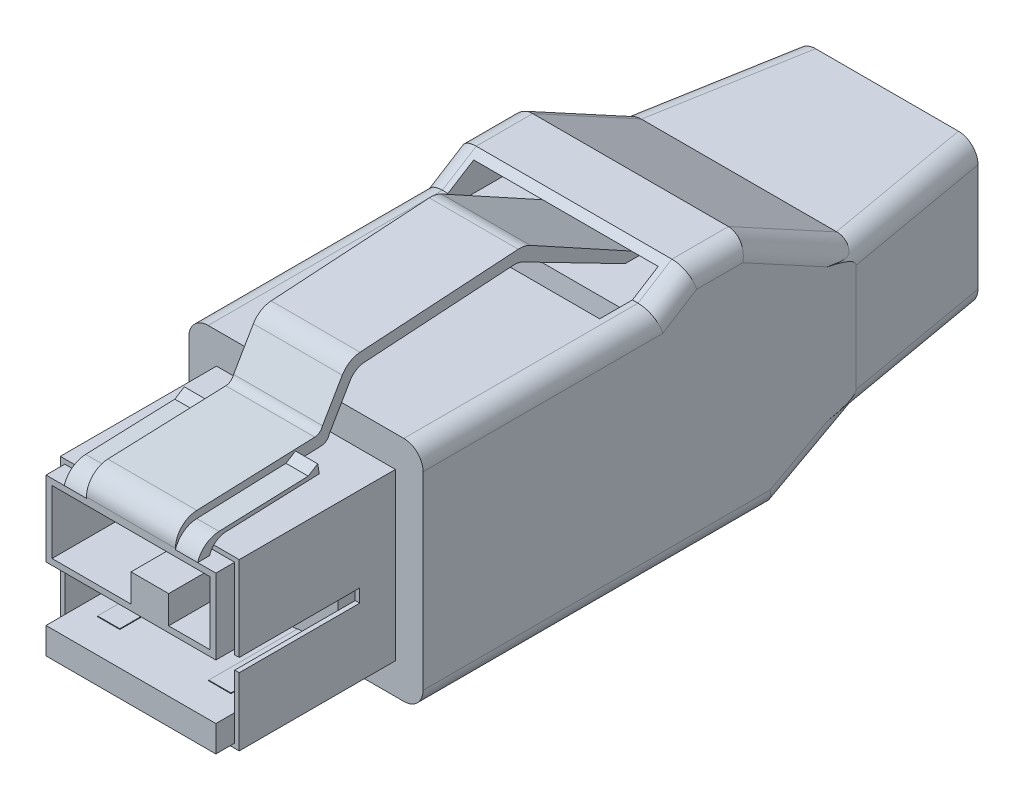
ISO-10303-21;
HEADER;
FILE_DESCRIPTION(('STEP AP214'),'2;1');
FILE_NAME('part.step','',(''),(''),'','','');
FILE_SCHEMA(('AUTOMOTIVE_DESIGN { 1 0 10303 214 1 1 1 1 }'));
ENDSEC;
DATA;
#1=APPLICATION_CONTEXT('core data for automotive mechanical design processes');
#2=APPLICATION_PROTOCOL_DEFINITION('international standard','automotive_design',2000,#1);
#3=PRODUCT_CONTEXT('',#1,'mechanical');
#4=PRODUCT('Part','Part','',(#3));
#5=PRODUCT_RELATED_PRODUCT_CATEGORY('part','',(#4));
#6=PRODUCT_DEFINITION_FORMATION('','',#4);
#7=PRODUCT_DEFINITION_CONTEXT('part definition',#1,'design');
#8=PRODUCT_DEFINITION('design','',#6,#7);
#9=PRODUCT_DEFINITION_SHAPE('','',#8);
#10=(LENGTH_UNIT() NAMED_UNIT(*) SI_UNIT(.MILLI.,.METRE.));
#11=(NAMED_UNIT(*) PLANE_ANGLE_UNIT() SI_UNIT($,.RADIAN.));
#12=(NAMED_UNIT(*) SI_UNIT($,.STERADIAN.) SOLID_ANGLE_UNIT());
#13=UNCERTAINTY_MEASURE_WITH_UNIT(LENGTH_MEASURE(1.E-05),#10,'distance_accuracy_value','');
#14=(GEOMETRIC_REPRESENTATION_CONTEXT(3) GLOBAL_UNCERTAINTY_ASSIGNED_CONTEXT((#13)) GLOBAL_UNIT_ASSIGNED_CONTEXT((#10,
#11,#12)) REPRESENTATION_CONTEXT('',''));
#15=CARTESIAN_POINT('',(0.,0.,0.));
#16=DIRECTION('',(0.,0.,1.));
#17=DIRECTION('',(1.,0.,0.));
#18=AXIS2_PLACEMENT_3D('',#15,#16,#17);
#19=CARTESIAN_POINT('',(0.499999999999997,4.08790846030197,25.36));
#20=DIRECTION('',(1.,0.,0.));
#21=DIRECTION('',(0.,0.,-1.));
#22=AXIS2_PLACEMENT_3D('',#19,#20,#21);
#23=PLANE('',#22);
#24=DIRECTION('',(0.,-1.,0.));
#25=VECTOR('',#24,1.);
#26=CARTESIAN_POINT('',(0.499999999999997,4.08790846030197,23.86));
#27=LINE('',#26,#25);
#28=CARTESIAN_POINT('',(0.499999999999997,4.08790846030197,23.86));
#29=VERTEX_POINT('',#28);
#30=CARTESIAN_POINT('',(0.499999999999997,3.80718093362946,23.86));
#31=VERTEX_POINT('',#30);
#32=EDGE_CURVE('E908',#29,#31,#27,.T.);
#33=ORIENTED_EDGE('',*,*,#32,.F.);
#34=DIRECTION('',(0.,0.,-1.));
#35=VECTOR('',#34,1.);
#36=CARTESIAN_POINT('',(0.499999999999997,4.08790846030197,25.36));
#37=LINE('',#36,#35);
#38=CARTESIAN_POINT('',(0.499999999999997,4.08790846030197,19.36));
#39=VERTEX_POINT('',#38);
#40=EDGE_CURVE('E964',#29,#39,#37,.T.);
#41=ORIENTED_EDGE('',*,*,#40,.T.);
#42=DIRECTION('',(0.,-1.,0.));
#43=VECTOR('',#42,1.);
#44=CARTESIAN_POINT('',(0.499999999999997,4.08790846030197,19.36));
#45=LINE('',#44,#43);
#46=CARTESIAN_POINT('',(0.499999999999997,3.80718093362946,19.36));
#47=VERTEX_POINT('',#46);
#48=EDGE_CURVE('E952',#39,#47,#45,.T.);
#49=ORIENTED_EDGE('',*,*,#48,.T.);
#50=DIRECTION('',(0.,0.,-1.));
#51=VECTOR('',#50,1.);
#52=CARTESIAN_POINT('',(0.499999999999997,3.80718093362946,25.36));
#53=LINE('',#52,#51);
#54=EDGE_CURVE('E970',#31,#47,#53,.T.);
#55=ORIENTED_EDGE('',*,*,#54,.F.);
#56=EDGE_LOOP('',(#33,#41,#49,#55));
#57=FACE_BOUND('',#56,.T.);
#58=ADVANCED_FACE('F36',(#57),#23,.F.);
#59=CARTESIAN_POINT('',(2.,3.80718093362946,25.36));
#60=DIRECTION('',(0.,-1.,0.));
#61=DIRECTION('',(1.,0.,0.));
#62=AXIS2_PLACEMENT_3D('',#59,#60,#61);
#63=PLANE('',#62);
#64=DIRECTION('',(0.,0.,-1.));
#65=VECTOR('',#64,1.);
#66=CARTESIAN_POINT('',(2.,3.80718093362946,25.36));
#67=LINE('',#66,#65);
#68=CARTESIAN_POINT('',(2.,3.80718093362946,23.86));
#69=VERTEX_POINT('',#68);
#70=CARTESIAN_POINT('',(2.,3.80718093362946,19.36));
#71=VERTEX_POINT('',#70);
#72=EDGE_CURVE('E968',#69,#71,#67,.T.);
#73=ORIENTED_EDGE('',*,*,#72,.F.);
#74=DIRECTION('',(1.,0.,0.));
#75=VECTOR('',#74,1.);
#76=CARTESIAN_POINT('',(0.499999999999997,3.80718093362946,23.86));
#77=LINE('',#76,#75);
#78=EDGE_CURVE('E910',#31,#69,#77,.T.);
#79=ORIENTED_EDGE('',*,*,#78,.F.);
#80=ORIENTED_EDGE('',*,*,#54,.T.);
#81=DIRECTION('',(-1.,0.,0.));
#82=VECTOR('',#81,1.);
#83=CARTESIAN_POINT('',(2.,3.80718093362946,19.36));
#84=LINE('',#83,#82);
#85=EDGE_CURVE('E955',#71,#47,#84,.T.);
#86=ORIENTED_EDGE('',*,*,#85,.F.);
#87=EDGE_LOOP('',(#73,#79,#80,#86));
#88=FACE_BOUND('',#87,.T.);
#89=ADVANCED_FACE('F1774',(#88),#63,.T.);
#90=CARTESIAN_POINT('',(2.,3.80718093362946,25.36));
#91=DIRECTION('',(-1.,0.,0.));
#92=DIRECTION('',(0.,0.,1.));
#93=AXIS2_PLACEMENT_3D('',#90,#91,#92);
#94=PLANE('',#93);
#95=DIRECTION('',(0.,1.,0.));
#96=VECTOR('',#95,1.);
#97=CARTESIAN_POINT('',(2.,3.80718093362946,23.86));
#98=LINE('',#97,#96);
#99=CARTESIAN_POINT('',(2.,4.08790846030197,23.86));
#100=VERTEX_POINT('',#99);
#101=EDGE_CURVE('E912',#69,#100,#98,.T.);
#102=ORIENTED_EDGE('',*,*,#101,.F.);
#103=ORIENTED_EDGE('',*,*,#72,.T.);
#104=DIRECTION('',(0.,1.,0.));
#105=VECTOR('',#104,1.);
#106=CARTESIAN_POINT('',(2.,3.80718093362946,19.36));
#107=LINE('',#106,#105);
#108=CARTESIAN_POINT('',(2.,4.08790846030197,19.36));
#109=VERTEX_POINT('',#108);
#110=EDGE_CURVE('E958',#71,#109,#107,.T.);
#111=ORIENTED_EDGE('',*,*,#110,.T.);
#112=DIRECTION('',(0.,0.,-1.));
#113=VECTOR('',#112,1.);
#114=CARTESIAN_POINT('',(2.,4.08790846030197,25.36));
#115=LINE('',#114,#113);
#116=EDGE_CURVE('E966',#100,#109,#115,.T.);
#117=ORIENTED_EDGE('',*,*,#116,.F.);
#118=EDGE_LOOP('',(#102,#103,#111,#117));
#119=FACE_BOUND('',#118,.T.);
#120=ADVANCED_FACE('F1780',(#119),#94,.F.);
#121=CARTESIAN_POINT('',(0.499999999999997,4.08790846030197,25.36));
#122=DIRECTION('',(0.,1.,0.));
#123=DIRECTION('',(0.,0.,1.));
#124=AXIS2_PLACEMENT_3D('',#121,#122,#123);
#125=PLANE('',#124);
#126=ORIENTED_EDGE('',*,*,#40,.F.);
#127=DIRECTION('',(-1.,0.,0.));
#128=VECTOR('',#127,1.);
#129=CARTESIAN_POINT('',(2.,4.08790846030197,23.86));
#130=LINE('',#129,#128);
#131=EDGE_CURVE('E900',#100,#29,#130,.T.);
#132=ORIENTED_EDGE('',*,*,#131,.F.);
#133=ORIENTED_EDGE('',*,*,#116,.T.);
#134=DIRECTION('',(1.,0.,0.));
#135=VECTOR('',#134,1.);
#136=CARTESIAN_POINT('',(0.499999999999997,4.08790846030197,19.36));
#137=LINE('',#136,#135);
#138=EDGE_CURVE('E961',#39,#109,#137,.T.);
#139=ORIENTED_EDGE('',*,*,#138,.F.);
#140=EDGE_LOOP('',(#126,#132,#133,#139));
#141=FACE_BOUND('',#140,.T.);
#142=ADVANCED_FACE('F1860',(#141),#125,.T.);
#143=CARTESIAN_POINT('',(5.73,0.204999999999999,19.36));
#144=DIRECTION('',(0.,0.,-1.));
#145=DIRECTION('',(-1.,0.,0.));
#146=AXIS2_PLACEMENT_3D('',#143,#144,#145);
#147=PLANE('',#146);
#148=ORIENTED_EDGE('',*,*,#48,.F.);
#149=ORIENTED_EDGE('',*,*,#138,.T.);
#150=ORIENTED_EDGE('',*,*,#110,.F.);
#151=ORIENTED_EDGE('',*,*,#85,.T.);
#152=EDGE_LOOP('',(#148,#149,#150,#151));
#153=FACE_BOUND('',#152,.T.);
#154=DIRECTION('',(0.,-1.,0.));
#155=VECTOR('',#154,1.);
#156=CARTESIAN_POINT('',(-4.5,4.12572752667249,19.36));
#157=LINE('',#156,#155);
#158=CARTESIAN_POINT('',(-4.5,4.12572752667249,19.36));
#159=VERTEX_POINT('',#158);
#160=CARTESIAN_POINT('',(-4.5,3.84499999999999,19.36));
#161=VERTEX_POINT('',#160);
#162=EDGE_CURVE('E992',#159,#161,#157,.T.);
#163=ORIENTED_EDGE('',*,*,#162,.F.);
#164=DIRECTION('',(1.,0.,0.));
#165=VECTOR('',#164,1.);
#166=CARTESIAN_POINT('',(-4.5,4.12572752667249,19.36));
#167=LINE('',#166,#165);
#168=CARTESIAN_POINT('',(-3.,4.12572752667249,19.36));
#169=VERTEX_POINT('',#168);
#170=EDGE_CURVE('E1000',#159,#169,#167,.T.);
#171=ORIENTED_EDGE('',*,*,#170,.T.);
#172=DIRECTION('',(0.,1.,0.));
#173=VECTOR('',#172,1.);
#174=CARTESIAN_POINT('',(-3.,3.84499999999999,19.36));
#175=LINE('',#174,#173);
#176=CARTESIAN_POINT('',(-3.,3.84499999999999,19.36));
#177=VERTEX_POINT('',#176);
#178=EDGE_CURVE('E998',#177,#169,#175,.T.);
#179=ORIENTED_EDGE('',*,*,#178,.F.);
#180=DIRECTION('',(-1.,0.,0.));
#181=VECTOR('',#180,1.);
#182=CARTESIAN_POINT('',(-3.,3.84499999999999,19.36));
#183=LINE('',#182,#181);
#184=EDGE_CURVE('E995',#177,#161,#183,.T.);
#185=ORIENTED_EDGE('',*,*,#184,.T.);
#186=EDGE_LOOP('',(#163,#171,#179,#185));
#187=FACE_BOUND('',#186,.T.);
#188=DIRECTION('',(0.,-1.,0.));
#189=VECTOR('',#188,1.);
#190=CARTESIAN_POINT('',(2.546,2.495,19.36));
#191=LINE('',#190,#189);
#192=CARTESIAN_POINT('',(2.546,2.495,19.36));
#193=VERTEX_POINT('',#192);
#194=CARTESIAN_POINT('',(2.546,0.611,19.36));
#195=VERTEX_POINT('',#194);
#196=EDGE_CURVE('E1042',#193,#195,#191,.T.);
#197=ORIENTED_EDGE('',*,*,#196,.T.);
#198=DIRECTION('',(1.,0.,0.));
#199=VECTOR('',#198,1.);
#200=CARTESIAN_POINT('',(2.546,0.611,19.36));
#201=LINE('',#200,#199);
#202=CARTESIAN_POINT('',(5.324,0.611,19.36));
#203=VERTEX_POINT('',#202);
#204=EDGE_CURVE('E1074',#195,#203,#201,.T.);
#205=ORIENTED_EDGE('',*,*,#204,.T.);
#206=DIRECTION('',(0.,1.,0.));
#207=VECTOR('',#206,1.);
#208=CARTESIAN_POINT('',(5.324,0.611,19.36));
#209=LINE('',#208,#207);
#210=CARTESIAN_POINT('',(5.324,4.879,19.36));
#211=VERTEX_POINT('',#210);
#212=EDGE_CURVE('E1070',#203,#211,#209,.T.);
#213=ORIENTED_EDGE('',*,*,#212,.T.);
#214=DIRECTION('',(-1.,0.,0.));
#215=VECTOR('',#214,1.);
#216=CARTESIAN_POINT('',(5.324,4.879,19.36));
#217=LINE('',#216,#215);
#218=CARTESIAN_POINT('',(-5.324,4.879,19.36));
#219=VERTEX_POINT('',#218);
#220=EDGE_CURVE('E1066',#211,#219,#217,.T.);
#221=ORIENTED_EDGE('',*,*,#220,.T.);
#222=DIRECTION('',(0.,-1.,0.));
#223=VECTOR('',#222,1.);
#224=CARTESIAN_POINT('',(-5.324,4.879,19.36));
#225=LINE('',#224,#223);
#226=CARTESIAN_POINT('',(-5.324,0.611,19.36));
#227=VERTEX_POINT('',#226);
#228=EDGE_CURVE('E1062',#219,#227,#225,.T.);
#229=ORIENTED_EDGE('',*,*,#228,.T.);
#230=DIRECTION('',(1.,0.,0.));
#231=VECTOR('',#230,1.);
#232=CARTESIAN_POINT('',(-5.324,0.610999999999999,19.36));
#233=LINE('',#232,#231);
#234=CARTESIAN_POINT('',(0.00599999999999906,0.611,19.36));
#235=VERTEX_POINT('',#234);
#236=EDGE_CURVE('E1057',#227,#235,#233,.T.);
#237=ORIENTED_EDGE('',*,*,#236,.T.);
#238=DIRECTION('',(0.,-1.,0.));
#239=VECTOR('',#238,1.);
#240=CARTESIAN_POINT('',(0.00599999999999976,2.495,19.36));
#241=LINE('',#240,#239);
#242=CARTESIAN_POINT('',(0.00599999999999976,2.495,19.36));
#243=VERTEX_POINT('',#242);
#244=EDGE_CURVE('E1027',#243,#235,#241,.T.);
#245=ORIENTED_EDGE('',*,*,#244,.F.);
#246=DIRECTION('',(-1.,0.,0.));
#247=VECTOR('',#246,1.);
#248=CARTESIAN_POINT('',(2.546,2.495,19.36));
#249=LINE('',#248,#247);
#250=EDGE_CURVE('E1022',#193,#243,#249,.T.);
#251=ORIENTED_EDGE('',*,*,#250,.F.);
#252=EDGE_LOOP('',(#197,#205,#213,#221,#229,#237,#245,#251));
#253=FACE_BOUND('',#252,.T.);
#254=DIRECTION('',(0.,-1.,0.));
#255=VECTOR('',#254,1.);
#256=CARTESIAN_POINT('',(-2.,4.1124120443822,19.36));
#257=LINE('',#256,#255);
#258=CARTESIAN_POINT('',(-2.,4.1124120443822,19.36));
#259=VERTEX_POINT('',#258);
#260=CARTESIAN_POINT('',(-2.,3.8316845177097,19.36));
#261=VERTEX_POINT('',#260);
#262=EDGE_CURVE('E972',#259,#261,#257,.T.);
#263=ORIENTED_EDGE('',*,*,#262,.F.);
#264=DIRECTION('',(1.,0.,0.));
#265=VECTOR('',#264,1.);
#266=CARTESIAN_POINT('',(-2.,4.1124120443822,19.36));
#267=LINE('',#266,#265);
#268=CARTESIAN_POINT('',(-0.500000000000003,4.1124120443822,19.36));
#269=VERTEX_POINT('',#268);
#270=EDGE_CURVE('E981',#259,#269,#267,.T.);
#271=ORIENTED_EDGE('',*,*,#270,.T.);
#272=DIRECTION('',(0.,1.,0.));
#273=VECTOR('',#272,1.);
#274=CARTESIAN_POINT('',(-0.500000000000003,3.83168451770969,19.36));
#275=LINE('',#274,#273);
#276=CARTESIAN_POINT('',(-0.500000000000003,3.83168451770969,19.36));
#277=VERTEX_POINT('',#276);
#278=EDGE_CURVE('E978',#277,#269,#275,.T.);
#279=ORIENTED_EDGE('',*,*,#278,.F.);
#280=DIRECTION('',(-1.,0.,0.));
#281=VECTOR('',#280,1.);
#282=CARTESIAN_POINT('',(-0.500000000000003,3.83168451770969,19.36));
#283=LINE('',#282,#281);
#284=EDGE_CURVE('E975',#277,#261,#283,.T.);
#285=ORIENTED_EDGE('',*,*,#284,.T.);
#286=EDGE_LOOP('',(#263,#271,#279,#285));
#287=FACE_BOUND('',#286,.T.);
#288=DIRECTION('',(0.,-1.,0.));
#289=VECTOR('',#288,1.);
#290=CARTESIAN_POINT('',(3.,4.0389012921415,19.36));
#291=LINE('',#290,#289);
#292=CARTESIAN_POINT('',(3.,4.0389012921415,19.36));
#293=VERTEX_POINT('',#292);
#294=CARTESIAN_POINT('',(3.,3.758173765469,19.36));
#295=VERTEX_POINT('',#294);
#296=EDGE_CURVE('E922',#293,#295,#291,.T.);
#297=ORIENTED_EDGE('',*,*,#296,.F.);
#298=DIRECTION('',(1.,0.,0.));
#299=VECTOR('',#298,1.);
#300=CARTESIAN_POINT('',(3.,4.0389012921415,19.36));
#301=LINE('',#300,#299);
#302=CARTESIAN_POINT('',(4.5,4.0389012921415,19.36));
#303=VERTEX_POINT('',#302);
#304=EDGE_CURVE('E930',#293,#303,#301,.T.);
#305=ORIENTED_EDGE('',*,*,#304,.T.);
#306=DIRECTION('',(0.,1.,0.));
#307=VECTOR('',#306,1.);
#308=CARTESIAN_POINT('',(4.5,3.758173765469,19.36));
#309=LINE('',#308,#307);
#310=CARTESIAN_POINT('',(4.5,3.758173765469,19.36));
#311=VERTEX_POINT('',#310);
#312=EDGE_CURVE('E928',#311,#303,#309,.T.);
#313=ORIENTED_EDGE('',*,*,#312,.F.);
#314=DIRECTION('',(-1.,0.,0.));
#315=VECTOR('',#314,1.);
#316=CARTESIAN_POINT('',(4.5,3.758173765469,19.36));
#317=LINE('',#316,#315);
#318=EDGE_CURVE('E925',#311,#295,#317,.T.);
#319=ORIENTED_EDGE('',*,*,#318,.T.);
#320=EDGE_LOOP('',(#297,#305,#313,#319));
#321=FACE_BOUND('',#320,.T.);
#322=ADVANCED_FACE('F1856',(#153,#187,#253,#287,#321),#147,.F.);
#323=CARTESIAN_POINT('',(5.73,5.285,27.61));
#324=DIRECTION('',(0.,-1.,0.));
#325=DIRECTION('',(1.,0.,0.));
#326=AXIS2_PLACEMENT_3D('',#323,#324,#325);
#327=PLANE('',#326);
#328=DIRECTION('',(0.,0.,-1.));
#329=VECTOR('',#328,1.);
#330=CARTESIAN_POINT('',(-4.5,5.285,27.61));
#331=LINE('',#330,#329);
#332=CARTESIAN_POINT('',(-4.5,5.285,27.61));
#333=VERTEX_POINT('',#332);
#334=CARTESIAN_POINT('',(-4.5,5.285,26.8067134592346));
#335=VERTEX_POINT('',#334);
#336=EDGE_CURVE('E1102',#333,#335,#331,.T.);
#337=ORIENTED_EDGE('',*,*,#336,.T.);
#338=DIRECTION('',(-1.,0.,0.));
#339=VECTOR('',#338,1.);
#340=CARTESIAN_POINT('',(3.,5.285,26.8067134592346));
#341=LINE('',#340,#339);
#342=CARTESIAN_POINT('',(4.5,5.285,26.8067134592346));
#343=VERTEX_POINT('',#342);
#344=EDGE_CURVE('E1300',#343,#335,#341,.T.);
#345=ORIENTED_EDGE('',*,*,#344,.F.);
#346=DIRECTION('',(0.,0.,-1.));
#347=VECTOR('',#346,1.);
#348=CARTESIAN_POINT('',(4.5,5.285,27.61));
#349=LINE('',#348,#347);
#350=CARTESIAN_POINT('',(4.5,5.285,27.61));
#351=VERTEX_POINT('',#350);
#352=EDGE_CURVE('E1148',#351,#343,#349,.T.);
#353=ORIENTED_EDGE('',*,*,#352,.F.);
#354=DIRECTION('',(-1.,0.,0.));
#355=VECTOR('',#354,1.);
#356=CARTESIAN_POINT('',(5.73,5.285,27.61));
#357=LINE('',#356,#355);
#358=CARTESIAN_POINT('',(5.73,5.285,27.61));
#359=VERTEX_POINT('',#358);
#360=EDGE_CURVE('E1391',#359,#351,#357,.T.);
#361=ORIENTED_EDGE('',*,*,#360,.F.);
#362=DIRECTION('',(0.,0.,-1.));
#363=VECTOR('',#362,1.);
#364=CARTESIAN_POINT('',(5.73,5.285,27.61));
#365=LINE('',#364,#363);
#366=CARTESIAN_POINT('',(5.73,5.285,26.34));
#367=VERTEX_POINT('',#366);
#368=EDGE_CURVE('E1402',#359,#367,#365,.T.);
#369=ORIENTED_EDGE('',*,*,#368,.T.);
#370=DIRECTION('',(-1.,0.,0.));
#371=VECTOR('',#370,1.);
#372=CARTESIAN_POINT('',(5.73,5.285,26.34));
#373=LINE('',#372,#371);
#374=CARTESIAN_POINT('',(-5.73,5.285,26.34));
#375=VERTEX_POINT('',#374);
#376=EDGE_CURVE('E1458',#367,#375,#373,.T.);
#377=ORIENTED_EDGE('',*,*,#376,.T.);
#378=DIRECTION('',(0.,0.,-1.));
#379=VECTOR('',#378,1.);
#380=CARTESIAN_POINT('',(-5.73,5.285,27.61));
#381=LINE('',#380,#379);
#382=CARTESIAN_POINT('',(-5.73,5.285,27.61));
#383=VERTEX_POINT('',#382);
#384=EDGE_CURVE('E1413',#383,#375,#381,.T.);
#385=ORIENTED_EDGE('',*,*,#384,.F.);
#386=EDGE_CURVE('E1390',#333,#383,#357,.T.);
#387=ORIENTED_EDGE('',*,*,#386,.F.);
#388=EDGE_LOOP('',(#337,#345,#353,#361,#369,#377,#385,#387));
#389=FACE_BOUND('',#388,.T.);
#390=ADVANCED_FACE('F1859',(#389),#327,.F.);
#391=CARTESIAN_POINT('',(3.,4.93137839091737,25.66));
#392=DIRECTION('',(-1.,0.,0.));
#393=DIRECTION('',(0.,0.,1.));
#394=AXIS2_PLACEMENT_3D('',#391,#392,#393);
#395=PLANE('',#394);
#396=DIRECTION('',(0.,0.98577726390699,0.168057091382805));
#397=VECTOR('',#396,1.);
#398=CARTESIAN_POINT('',(3.,6.36836279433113,19.4005469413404));
#399=LINE('',#398,#397);
#400=CARTESIAN_POINT('',(3.,6.36836279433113,19.4005469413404));
#401=VERTEX_POINT('',#400);
#402=CARTESIAN_POINT('',(3.,7.00279447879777,19.5087060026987));
#403=VERTEX_POINT('',#402);
#404=EDGE_CURVE('E1126',#401,#403,#399,.T.);
#405=ORIENTED_EDGE('',*,*,#404,.F.);
#406=DIRECTION('',(0.,0.0376970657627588,-0.999289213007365));
#407=VECTOR('',#406,1.);
#408=CARTESIAN_POINT('',(3.,6.13052544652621,25.7052364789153));
#409=LINE('',#408,#407);
#410=CARTESIAN_POINT('',(3.,6.43020692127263,17.7611575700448));
#411=VERTEX_POINT('',#410);
#412=EDGE_CURVE('E1215',#401,#411,#409,.T.);
#413=ORIENTED_EDGE('',*,*,#412,.T.);
#414=CARTESIAN_POINT('',(3.,7.00279447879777,17.7827577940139));
#415=DIRECTION('',(1.,0.,0.));
#416=DIRECTION('',(0.,0.,-1.));
#417=AXIS2_PLACEMENT_3D('',#414,#415,#416);
#418=CIRCLE('',#417,0.572994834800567);
#419=CARTESIAN_POINT('',(3.,6.86579418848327,17.226382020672));
#420=VERTEX_POINT('',#419);
#421=EDGE_CURVE('E1217',#411,#420,#418,.T.);
#422=ORIENTED_EDGE('',*,*,#421,.T.);
#423=DIRECTION('',(0.,0.863778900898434,-0.503871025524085));
#424=VECTOR('',#423,1.);
#425=CARTESIAN_POINT('',(3.,6.86579418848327,17.226382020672));
#426=LINE('',#425,#424);
#427=CARTESIAN_POINT('',(3.,9.26970336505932,15.8241016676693));
#428=VERTEX_POINT('',#427);
#429=EDGE_CURVE('E1219',#420,#428,#426,.T.);
#430=ORIENTED_EDGE('',*,*,#429,.T.);
#431=CARTESIAN_POINT('',(3.,8.66505813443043,14.7875669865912));
#432=DIRECTION('',(-1.,0.,0.));
#433=DIRECTION('',(0.,0.,1.));
#434=AXIS2_PLACEMENT_3D('',#431,#432,#433);
#435=CIRCLE('',#434,1.2);
#436=CARTESIAN_POINT('',(3.,9.86261494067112,14.8641025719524));
#437=VERTEX_POINT('',#436);
#438=EDGE_CURVE('E1221',#428,#437,#435,.T.);
#439=ORIENTED_EDGE('',*,*,#438,.T.);
#440=DIRECTION('',(0.,0.0637796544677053,-0.997964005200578));
#441=VECTOR('',#440,1.);
#442=CARTESIAN_POINT('',(3.,9.86261494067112,14.8641025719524));
#443=LINE('',#442,#441);
#444=CARTESIAN_POINT('',(3.,10.5063836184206,4.79101620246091));
#445=VERTEX_POINT('',#444);
#446=EDGE_CURVE('E1223',#437,#445,#443,.T.);
#447=ORIENTED_EDGE('',*,*,#446,.T.);
#448=CARTESIAN_POINT('',(3.,9.30882681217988,4.71448061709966));
#449=DIRECTION('',(-1.,0.,0.));
#450=DIRECTION('',(0.,0.,1.));
#451=AXIS2_PLACEMENT_3D('',#448,#449,#450);
#452=CIRCLE('',#451,1.2);
#453=CARTESIAN_POINT('',(3.,10.375953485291,4.16562666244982));
#454=VERTEX_POINT('',#453);
#455=EDGE_CURVE('E1225',#445,#454,#452,.T.);
#456=ORIENTED_EDGE('',*,*,#455,.T.);
#457=DIRECTION('',(0.,-0.457378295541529,-0.889272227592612));
#458=VECTOR('',#457,1.);
#459=CARTESIAN_POINT('',(3.,10.375953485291,4.16562666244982));
#460=LINE('',#459,#458);
#461=CARTESIAN_POINT('',(3.,6.82613291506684,-2.73622433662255));
#462=VERTEX_POINT('',#461);
#463=EDGE_CURVE('E1227',#454,#462,#460,.T.);
#464=ORIENTED_EDGE('',*,*,#463,.T.);
#465=DIRECTION('',(0.,0.,1.));
#466=VECTOR('',#465,1.);
#467=CARTESIAN_POINT('',(3.,6.82613291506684,-4.11528601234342));
#468=LINE('',#467,#466);
#469=CARTESIAN_POINT('',(3.,6.82613291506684,-4.11528601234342));
#470=VERTEX_POINT('',#469);
#471=EDGE_CURVE('E1230',#470,#462,#468,.T.);
#472=ORIENTED_EDGE('',*,*,#471,.F.);
#473=DIRECTION('',(0.,-0.48115290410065,-0.87663668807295));
#474=VECTOR('',#473,1.);
#475=CARTESIAN_POINT('',(3.,11.0957291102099,3.66370614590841));
#476=LINE('',#475,#474);
#477=CARTESIAN_POINT('',(3.,11.0957291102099,3.66370614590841));
#478=VERTEX_POINT('',#477);
#479=EDGE_CURVE('E1232',#478,#470,#476,.T.);
#480=ORIENTED_EDGE('',*,*,#479,.F.);
#481=CARTESIAN_POINT('',(3.,9.78077407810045,4.38543550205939));
#482=DIRECTION('',(-1.,0.,0.));
#483=DIRECTION('',(0.,0.,1.));
#484=AXIS2_PLACEMENT_3D('',#481,#482,#483);
#485=CIRCLE('',#484,1.5);
#486=CARTESIAN_POINT('',(3.,11.2777200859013,4.48110498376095));
#487=VERTEX_POINT('',#486);
#488=EDGE_CURVE('E1235',#487,#478,#485,.T.);
#489=ORIENTED_EDGE('',*,*,#488,.F.);
#490=DIRECTION('',(0.,0.0637796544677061,-0.997964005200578));
#491=VECTOR('',#490,1.);
#492=CARTESIAN_POINT('',(3.,10.5957995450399,15.1511557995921));
#493=LINE('',#492,#491);
#494=CARTESIAN_POINT('',(3.,10.5957995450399,15.1511557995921));
#495=VERTEX_POINT('',#494);
#496=EDGE_CURVE('E1238',#495,#487,#493,.T.);
#497=ORIENTED_EDGE('',*,*,#496,.F.);
#498=CARTESIAN_POINT('',(3.,9.09885353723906,15.0554863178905));
#499=DIRECTION('',(-1.,0.,0.));
#500=DIRECTION('',(0.,0.,1.));
#501=AXIS2_PLACEMENT_3D('',#498,#499,#500);
#502=CIRCLE('',#501,1.49999999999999);
#503=CARTESIAN_POINT('',(3.,9.85466007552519,16.3511546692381));
#504=VERTEX_POINT('',#503);
#505=EDGE_CURVE('E1241',#504,#495,#502,.T.);
#506=ORIENTED_EDGE('',*,*,#505,.F.);
#507=DIRECTION('',(0.,0.863778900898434,-0.503871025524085));
#508=VECTOR('',#507,1.);
#509=CARTESIAN_POINT('',(3.,7.57204051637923,17.6826827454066));
#510=LINE('',#509,#508);
#511=CARTESIAN_POINT('',(3.,7.57204051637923,17.6826827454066));
#512=VERTEX_POINT('',#511);
#513=EDGE_CURVE('E1244',#512,#504,#510,.T.);
#514=ORIENTED_EDGE('',*,*,#513,.F.);
#515=CARTESIAN_POINT('',(3.,7.73639587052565,18.2316002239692));
#516=DIRECTION('',(1.,0.,0.));
#517=DIRECTION('',(0.,0.,-1.));
#518=AXIS2_PLACEMENT_3D('',#515,#516,#517);
#519=CIRCLE('',#518,0.572994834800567);
#520=CARTESIAN_POINT('',(3.,7.16380831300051,18.21));
#521=VERTEX_POINT('',#520);
#522=EDGE_CURVE('E1247',#521,#512,#519,.T.);
#523=ORIENTED_EDGE('',*,*,#522,.F.);
#524=DIRECTION('',(0.,0.0376970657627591,-0.999289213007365));
#525=VECTOR('',#524,1.);
#526=CARTESIAN_POINT('',(3.,6.86365654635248,26.1665455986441));
#527=LINE('',#526,#525);
#528=CARTESIAN_POINT('',(3.,6.86365654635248,26.1665455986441));
#529=VERTEX_POINT('',#528);
#530=EDGE_CURVE('E1250',#529,#521,#527,.T.);
#531=ORIENTED_EDGE('',*,*,#530,.F.);
#532=CARTESIAN_POINT('',(3.,5.36472272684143,26.11));
#533=DIRECTION('',(1.,0.,0.));
#534=DIRECTION('',(0.,0.,-1.));
#535=AXIS2_PLACEMENT_3D('',#532,#533,#534);
#536=CIRCLE('',#535,1.5);
#537=CARTESIAN_POINT('',(3.,5.36472272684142,27.61));
#538=VERTEX_POINT('',#537);
#539=EDGE_CURVE('E1253',#529,#538,#536,.T.);
#540=ORIENTED_EDGE('',*,*,#539,.T.);
#541=DIRECTION('',(0.,-1.,0.));
#542=VECTOR('',#541,1.);
#543=CARTESIAN_POINT('',(3.,5.36472272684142,27.61));
#544=LINE('',#543,#542);
#545=CARTESIAN_POINT('',(3.,5.285,27.61));
#546=VERTEX_POINT('',#545);
#547=EDGE_CURVE('E1255',#538,#546,#544,.T.);
#548=ORIENTED_EDGE('',*,*,#547,.T.);
#549=CARTESIAN_POINT('',(3.,4.81296152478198,26.1094173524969));
#550=DIRECTION('',(1.,0.,0.));
#551=DIRECTION('',(0.,0.,-1.));
#552=AXIS2_PLACEMENT_3D('',#549,#550,#551);
#553=CIRCLE('',#552,1.57307615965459);
#554=CARTESIAN_POINT('',(3.,6.38499999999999,26.1665455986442));
#555=VERTEX_POINT('',#554);
#556=EDGE_CURVE('E1135',#555,#546,#553,.T.);
#557=ORIENTED_EDGE('',*,*,#556,.F.);
#558=DIRECTION('',(0.,-0.03631626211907,0.999340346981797));
#559=VECTOR('',#558,1.);
#560=CARTESIAN_POINT('',(3.,6.60365486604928,20.1496645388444));
#561=LINE('',#560,#559);
#562=CARTESIAN_POINT('',(3.,6.60365486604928,20.1496645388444));
#563=VERTEX_POINT('',#562);
#564=EDGE_CURVE('E1132',#563,#555,#561,.T.);
#565=ORIENTED_EDGE('',*,*,#564,.F.);
#566=DIRECTION('',(0.,-0.528608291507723,0.848865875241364));
#567=VECTOR('',#566,1.);
#568=CARTESIAN_POINT('',(3.,7.00279447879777,19.5087060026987));
#569=LINE('',#568,#567);
#570=EDGE_CURVE('E1129',#403,#563,#569,.T.);
#571=ORIENTED_EDGE('',*,*,#570,.F.);
#572=EDGE_LOOP('',(#405,#413,#422,#430,#439,#447,#456,#464,#472,#480,#489,#497,#506,#514,#523,
#531,#540,#548,#557,#565,#571));
#573=FACE_BOUND('',#572,.T.);
#574=ADVANCED_FACE('F1906',(#573),#395,.F.);
#575=CARTESIAN_POINT('',(-6.223,6.82613291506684,-5.1832872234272));
#576=DIRECTION('',(0.,1.,0.));
#577=DIRECTION('',(0.,0.,1.));
#578=AXIS2_PLACEMENT_3D('',#575,#576,#577);
#579=PLANE('',#578);
#580=DIRECTION('',(0.,0.,1.));
#581=VECTOR('',#580,1.);
#582=CARTESIAN_POINT('',(6.223,6.82613291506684,-5.1832872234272));
#583=LINE('',#582,#581);
#584=CARTESIAN_POINT('',(6.223,6.82613291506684,-5.1832872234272));
#585=VERTEX_POINT('',#584);
#586=CARTESIAN_POINT('',(6.223,6.82613291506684,0.));
#587=VERTEX_POINT('',#586);
#588=EDGE_CURVE('E1309',#585,#587,#583,.T.);
#589=ORIENTED_EDGE('',*,*,#588,.F.);
#590=DIRECTION('',(1.,0.,0.));
#591=VECTOR('',#590,1.);
#592=CARTESIAN_POINT('',(-6.223,6.82613291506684,-5.1832872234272));
#593=LINE('',#592,#591);
#594=CARTESIAN_POINT('',(-6.223,6.82613291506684,-5.1832872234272));
#595=VERTEX_POINT('',#594);
#596=EDGE_CURVE('E1335',#595,#585,#593,.T.);
#597=ORIENTED_EDGE('',*,*,#596,.F.);
#598=DIRECTION('',(0.,0.,1.));
#599=VECTOR('',#598,1.);
#600=CARTESIAN_POINT('',(-6.223,6.82613291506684,-5.1832872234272));
#601=LINE('',#600,#599);
#602=CARTESIAN_POINT('',(-6.223,6.82613291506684,0.));
#603=VERTEX_POINT('',#602);
#604=EDGE_CURVE('E1322',#595,#603,#601,.T.);
#605=ORIENTED_EDGE('',*,*,#604,.T.);
#606=DIRECTION('',(1.,0.,0.));
#607=VECTOR('',#606,1.);
#608=CARTESIAN_POINT('',(-6.223,6.82613291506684,0.));
#609=LINE('',#608,#607);
#610=EDGE_CURVE('E1332',#603,#587,#609,.T.);
#611=ORIENTED_EDGE('',*,*,#610,.T.);
#612=EDGE_LOOP('',(#589,#597,#605,#611));
#613=FACE_BOUND('',#612,.T.);
#614=DIRECTION('',(-1.,0.,0.));
#615=VECTOR('',#614,1.);
#616=CARTESIAN_POINT('',(3.,6.82613291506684,-4.11528601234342));
#617=LINE('',#616,#615);
#618=CARTESIAN_POINT('',(-3.,6.82613291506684,-4.11528601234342));
#619=VERTEX_POINT('',#618);
#620=EDGE_CURVE('E1275',#470,#619,#617,.T.);
#621=ORIENTED_EDGE('',*,*,#620,.F.);
#622=ORIENTED_EDGE('',*,*,#471,.T.);
#623=DIRECTION('',(-1.,0.,0.));
#624=VECTOR('',#623,1.);
#625=CARTESIAN_POINT('',(3.,6.82613291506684,-2.73622433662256));
#626=LINE('',#625,#624);
#627=CARTESIAN_POINT('',(-3.,6.82613291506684,-2.73622433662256));
#628=VERTEX_POINT('',#627);
#629=EDGE_CURVE('E1278',#462,#628,#626,.T.);
#630=ORIENTED_EDGE('',*,*,#629,.T.);
#631=DIRECTION('',(0.,0.,1.));
#632=VECTOR('',#631,1.);
#633=CARTESIAN_POINT('',(-3.,6.82613291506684,-4.11528601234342));
#634=LINE('',#633,#632);
#635=EDGE_CURVE('E1186',#619,#628,#634,.T.);
#636=ORIENTED_EDGE('',*,*,#635,.F.);
#637=EDGE_LOOP('',(#621,#622,#630,#636));
#638=FACE_BOUND('',#637,.T.);
#639=ADVANCED_FACE('F1909',(#613,#638),#579,.T.);
#640=CARTESIAN_POINT('',(5.73,-5.285,0.209730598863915));
#641=DIRECTION('',(1.,0.,0.));
#642=DIRECTION('',(0.,1.,0.));
#643=AXIS2_PLACEMENT_3D('',#640,#641,#642);
#644=PLANE('',#643);
#645=DIRECTION('',(0.,1.,0.));
#646=VECTOR('',#645,1.);
#647=CARTESIAN_POINT('',(5.73,-3.505,19.36));
#648=LINE('',#647,#646);
#649=CARTESIAN_POINT('',(5.73,-3.505,19.36));
#650=VERTEX_POINT('',#649);
#651=CARTESIAN_POINT('',(5.73,-1.02,19.36));
#652=VERTEX_POINT('',#651);
#653=EDGE_CURVE('E1357',#650,#652,#648,.T.);
#654=ORIENTED_EDGE('',*,*,#653,.F.);
#655=DIRECTION('',(0.,0.,-1.));
#656=VECTOR('',#655,1.);
#657=CARTESIAN_POINT('',(5.73,-3.505,27.61));
#658=LINE('',#657,#656);
#659=CARTESIAN_POINT('',(5.73,-3.505,26.34));
#660=VERTEX_POINT('',#659);
#661=EDGE_CURVE('E1381',#660,#650,#658,.T.);
#662=ORIENTED_EDGE('',*,*,#661,.F.);
#663=DIRECTION('',(0.,1.,0.));
#664=VECTOR('',#663,1.);
#665=CARTESIAN_POINT('',(5.73,-5.285,26.34));
#666=LINE('',#665,#664);
#667=CARTESIAN_POINT('',(5.73,-1.02,26.34));
#668=VERTEX_POINT('',#667);
#669=EDGE_CURVE('E1472',#660,#668,#666,.T.);
#670=ORIENTED_EDGE('',*,*,#669,.T.);
#671=DIRECTION('',(0.,0.,1.));
#672=VECTOR('',#671,1.);
#673=CARTESIAN_POINT('',(5.73,-1.02,0.209730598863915));
#674=LINE('',#673,#672);
#675=EDGE_CURVE('E1446',#652,#668,#674,.T.);
#676=ORIENTED_EDGE('',*,*,#675,.F.);
#677=EDGE_LOOP('',(#654,#662,#670,#676));
#678=FACE_BOUND('',#677,.T.);
#679=ADVANCED_FACE('F1989',(#678),#644,.F.);
#680=CARTESIAN_POINT('',(5.73,-0.129999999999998,19.36));
#681=VERTEX_POINT('',#680);
#682=CARTESIAN_POINT('',(5.73,0.205,19.36));
#683=VERTEX_POINT('',#682);
#684=EDGE_CURVE('E1356',#681,#683,#648,.T.);
#685=ORIENTED_EDGE('',*,*,#684,.F.);
#686=DIRECTION('',(0.,0.,-1.));
#687=VECTOR('',#686,1.);
#688=CARTESIAN_POINT('',(5.73,-0.129999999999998,0.209730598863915));
#689=LINE('',#688,#687);
#690=CARTESIAN_POINT('',(5.73,-0.129999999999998,26.34));
#691=VERTEX_POINT('',#690);
#692=EDGE_CURVE('E1441',#691,#681,#689,.T.);
#693=ORIENTED_EDGE('',*,*,#692,.F.);
#694=CARTESIAN_POINT('',(5.73,0.205,26.34));
#695=VERTEX_POINT('',#694);
#696=EDGE_CURVE('E1468',#691,#695,#666,.T.);
#697=ORIENTED_EDGE('',*,*,#696,.T.);
#698=DIRECTION('',(0.,0.,-1.));
#699=VECTOR('',#698,1.);
#700=CARTESIAN_POINT('',(5.73,0.205,27.61));
#701=LINE('',#700,#699);
#702=EDGE_CURVE('E1405',#695,#683,#701,.T.);
#703=ORIENTED_EDGE('',*,*,#702,.T.);
#704=EDGE_LOOP('',(#685,#693,#697,#703));
#705=FACE_BOUND('',#704,.T.);
#706=ADVANCED_FACE('F2066',(#705),#644,.F.);
#707=CARTESIAN_POINT('',(-5.73,5.285,0.209730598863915));
#708=DIRECTION('',(-1.,0.,0.));
#709=DIRECTION('',(0.,-1.,0.));
#710=AXIS2_PLACEMENT_3D('',#707,#708,#709);
#711=PLANE('',#710);
#712=DIRECTION('',(0.,-1.,0.));
#713=VECTOR('',#712,1.);
#714=CARTESIAN_POINT('',(-5.73,0.205,19.36));
#715=LINE('',#714,#713);
#716=CARTESIAN_POINT('',(-5.73,0.204999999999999,19.36));
#717=VERTEX_POINT('',#716);
#718=CARTESIAN_POINT('',(-5.73,-0.129999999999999,19.36));
#719=VERTEX_POINT('',#718);
#720=EDGE_CURVE('E1348',#717,#719,#715,.T.);
#721=ORIENTED_EDGE('',*,*,#720,.F.);
#722=DIRECTION('',(0.,0.,-1.));
#723=VECTOR('',#722,1.);
#724=CARTESIAN_POINT('',(-5.73,0.204999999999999,27.61));
#725=LINE('',#724,#723);
#726=CARTESIAN_POINT('',(-5.73,0.204999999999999,26.34));
#727=VERTEX_POINT('',#726);
#728=EDGE_CURVE('E1409',#727,#717,#725,.T.);
#729=ORIENTED_EDGE('',*,*,#728,.F.);
#730=DIRECTION('',(0.,-1.,0.));
#731=VECTOR('',#730,1.);
#732=CARTESIAN_POINT('',(-5.73,5.285,26.34));
#733=LINE('',#732,#731);
#734=CARTESIAN_POINT('',(-5.73,-0.129999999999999,26.34));
#735=VERTEX_POINT('',#734);
#736=EDGE_CURVE('E1466',#727,#735,#733,.T.);
#737=ORIENTED_EDGE('',*,*,#736,.T.);
#738=DIRECTION('',(0.,0.,1.));
#739=VECTOR('',#738,1.);
#740=CARTESIAN_POINT('',(-5.73,-0.129999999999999,0.209730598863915));
#741=LINE('',#740,#739);
#742=EDGE_CURVE('E1714',#719,#735,#741,.T.);
#743=ORIENTED_EDGE('',*,*,#742,.F.);
#744=EDGE_LOOP('',(#721,#729,#737,#743));
#745=FACE_BOUND('',#744,.T.);
#746=ADVANCED_FACE('F2068',(#745),#711,.F.);
#747=CARTESIAN_POINT('',(-5.73,-1.02,19.36));
#748=VERTEX_POINT('',#747);
#749=CARTESIAN_POINT('',(-5.73,-3.505,19.36));
#750=VERTEX_POINT('',#749);
#751=EDGE_CURVE('E1347',#748,#750,#715,.T.);
#752=ORIENTED_EDGE('',*,*,#751,.F.);
#753=DIRECTION('',(0.,0.,-1.));
#754=VECTOR('',#753,1.);
#755=CARTESIAN_POINT('',(-5.73,-1.02,0.209730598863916));
#756=LINE('',#755,#754);
#757=CARTESIAN_POINT('',(-5.73,-1.02,26.34));
#758=VERTEX_POINT('',#757);
#759=EDGE_CURVE('E11',#758,#748,#756,.T.);
#760=ORIENTED_EDGE('',*,*,#759,.F.);
#761=CARTESIAN_POINT('',(-5.73,-3.505,26.34));
#762=VERTEX_POINT('',#761);
#763=EDGE_CURVE('E1461',#758,#762,#733,.T.);
#764=ORIENTED_EDGE('',*,*,#763,.T.);
#765=DIRECTION('',(0.,0.,-1.));
#766=VECTOR('',#765,1.);
#767=CARTESIAN_POINT('',(-5.73,-3.505,27.61));
#768=LINE('',#767,#766);
#769=EDGE_CURVE('E1377',#762,#750,#768,.T.);
#770=ORIENTED_EDGE('',*,*,#769,.T.);
#771=EDGE_LOOP('',(#752,#760,#764,#770));
#772=FACE_BOUND('',#771,.T.);
#773=ADVANCED_FACE('F2040',(#772),#711,.F.);
#774=CARTESIAN_POINT('',(5.73,0.205,27.61));
#775=DIRECTION('',(0.,-1.,0.));
#776=DIRECTION('',(1.,0.,0.));
#777=AXIS2_PLACEMENT_3D('',#774,#775,#776);
#778=PLANE('',#777);
#779=ORIENTED_EDGE('',*,*,#728,.T.);
#780=DIRECTION('',(-1.,0.,0.));
#781=VECTOR('',#780,1.);
#782=CARTESIAN_POINT('',(5.73,0.205,19.36));
#783=LINE('',#782,#781);
#784=EDGE_CURVE('E1344',#683,#717,#783,.T.);
#785=ORIENTED_EDGE('',*,*,#784,.F.);
#786=ORIENTED_EDGE('',*,*,#702,.F.);
#787=CARTESIAN_POINT('',(5.73,0.205,27.61));
#788=VERTEX_POINT('',#787);
#789=EDGE_CURVE('E1406',#788,#695,#701,.T.);
#790=ORIENTED_EDGE('',*,*,#789,.F.);
#791=DIRECTION('',(-1.,0.,0.));
#792=VECTOR('',#791,1.);
#793=CARTESIAN_POINT('',(5.73,0.205,27.61));
#794=LINE('',#793,#792);
#795=CARTESIAN_POINT('',(-5.73,0.204999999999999,27.61));
#796=VERTEX_POINT('',#795);
#797=EDGE_CURVE('E1397',#788,#796,#794,.T.);
#798=ORIENTED_EDGE('',*,*,#797,.T.);
#799=EDGE_CURVE('E1410',#796,#727,#725,.T.);
#800=ORIENTED_EDGE('',*,*,#799,.T.);
#801=EDGE_LOOP('',(#779,#785,#786,#790,#798,#800));
#802=FACE_BOUND('',#801,.T.);
#803=ADVANCED_FACE('F2021',(#802),#778,.T.);
#804=CARTESIAN_POINT('',(5.73,-3.505,27.61));
#805=DIRECTION('',(0.,-1.,0.));
#806=DIRECTION('',(1.,0.,0.));
#807=AXIS2_PLACEMENT_3D('',#804,#805,#806);
#808=PLANE('',#807);
#809=DIRECTION('',(1.,0.,0.));
#810=VECTOR('',#809,1.);
#811=CARTESIAN_POINT('',(-5.73,-3.505,19.36));
#812=LINE('',#811,#810);
#813=CARTESIAN_POINT('',(-3.,-3.505,19.36));
#814=VERTEX_POINT('',#813);
#815=CARTESIAN_POINT('',(-2.,-3.505,19.36));
#816=VERTEX_POINT('',#815);
#817=EDGE_CURVE('E806',#814,#816,#812,.T.);
#818=ORIENTED_EDGE('',*,*,#817,.F.);
#819=DIRECTION('',(0.,0.,1.));
#820=VECTOR('',#819,1.);
#821=CARTESIAN_POINT('',(-3.,-3.505,19.36));
#822=LINE('',#821,#820);
#823=CARTESIAN_POINT('',(-3.,-3.505,25.36));
#824=VERTEX_POINT('',#823);
#825=EDGE_CURVE('E788',#814,#824,#822,.T.);
#826=ORIENTED_EDGE('',*,*,#825,.T.);
#827=DIRECTION('',(1.,0.,0.));
#828=VECTOR('',#827,1.);
#829=CARTESIAN_POINT('',(-4.5,-3.505,25.36));
#830=LINE('',#829,#828);
#831=CARTESIAN_POINT('',(-4.5,-3.505,25.36));
#832=VERTEX_POINT('',#831);
#833=EDGE_CURVE('E796',#832,#824,#830,.T.);
#834=ORIENTED_EDGE('',*,*,#833,.F.);
#835=DIRECTION('',(0.,0.,-1.));
#836=VECTOR('',#835,1.);
#837=CARTESIAN_POINT('',(-4.5,-3.505,25.36));
#838=LINE('',#837,#836);
#839=CARTESIAN_POINT('',(-4.5,-3.505,19.36));
#840=VERTEX_POINT('',#839);
#841=EDGE_CURVE('E801',#832,#840,#838,.T.);
#842=ORIENTED_EDGE('',*,*,#841,.T.);
#843=EDGE_CURVE('E1353',#750,#840,#812,.T.);
#844=ORIENTED_EDGE('',*,*,#843,.F.);
#845=ORIENTED_EDGE('',*,*,#769,.F.);
#846=CARTESIAN_POINT('',(-5.73,-3.505,27.61));
#847=VERTEX_POINT('',#846);
#848=EDGE_CURVE('E1378',#847,#762,#768,.T.);
#849=ORIENTED_EDGE('',*,*,#848,.F.);
#850=DIRECTION('',(-1.,0.,0.));
#851=VECTOR('',#850,1.);
#852=CARTESIAN_POINT('',(5.73,-3.505,27.61));
#853=LINE('',#852,#851);
#854=CARTESIAN_POINT('',(5.73,-3.505,27.61));
#855=VERTEX_POINT('',#854);
#856=EDGE_CURVE('E1370',#855,#847,#853,.T.);
#857=ORIENTED_EDGE('',*,*,#856,.F.);
#858=EDGE_CURVE('E1382',#855,#660,#658,.T.);
#859=ORIENTED_EDGE('',*,*,#858,.T.);
#860=ORIENTED_EDGE('',*,*,#661,.T.);
#861=CARTESIAN_POINT('',(4.5,-3.505,19.36));
#862=VERTEX_POINT('',#861);
#863=EDGE_CURVE('E1351',#862,#650,#812,.T.);
#864=ORIENTED_EDGE('',*,*,#863,.F.);
#865=DIRECTION('',(0.,0.,1.));
#866=VECTOR('',#865,1.);
#867=CARTESIAN_POINT('',(4.5,-3.505,19.36));
#868=LINE('',#867,#866);
#869=CARTESIAN_POINT('',(4.5,-3.505,25.36));
#870=VERTEX_POINT('',#869);
#871=EDGE_CURVE('E871',#862,#870,#868,.T.);
#872=ORIENTED_EDGE('',*,*,#871,.T.);
#873=DIRECTION('',(1.,0.,0.));
#874=VECTOR('',#873,1.);
#875=CARTESIAN_POINT('',(3.,-3.505,25.36));
#876=LINE('',#875,#874);
#877=CARTESIAN_POINT('',(3.,-3.505,25.36));
#878=VERTEX_POINT('',#877);
#879=EDGE_CURVE('E880',#878,#870,#876,.T.);
#880=ORIENTED_EDGE('',*,*,#879,.F.);
#881=DIRECTION('',(0.,0.,-1.));
#882=VECTOR('',#881,1.);
#883=CARTESIAN_POINT('',(3.,-3.505,25.36));
#884=LINE('',#883,#882);
#885=CARTESIAN_POINT('',(3.,-3.505,19.36));
#886=VERTEX_POINT('',#885);
#887=EDGE_CURVE('E883',#878,#886,#884,.T.);
#888=ORIENTED_EDGE('',*,*,#887,.T.);
#889=CARTESIAN_POINT('',(2.,-3.505,19.36));
#890=VERTEX_POINT('',#889);
#891=EDGE_CURVE('E2253',#890,#886,#812,.T.);
#892=ORIENTED_EDGE('',*,*,#891,.F.);
#893=DIRECTION('',(0.,0.,1.));
#894=VECTOR('',#893,1.);
#895=CARTESIAN_POINT('',(2.,-3.505,19.36));
#896=LINE('',#895,#894);
#897=CARTESIAN_POINT('',(2.,-3.505,23.86));
#898=VERTEX_POINT('',#897);
#899=EDGE_CURVE('E842',#890,#898,#896,.T.);
#900=ORIENTED_EDGE('',*,*,#899,.T.);
#901=DIRECTION('',(1.,0.,0.));
#902=VECTOR('',#901,1.);
#903=CARTESIAN_POINT('',(0.499999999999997,-3.505,23.86));
#904=LINE('',#903,#902);
#905=CARTESIAN_POINT('',(0.499999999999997,-3.505,23.86));
#906=VERTEX_POINT('',#905);
#907=EDGE_CURVE('E851',#906,#898,#904,.T.);
#908=ORIENTED_EDGE('',*,*,#907,.F.);
#909=DIRECTION('',(0.,0.,-1.));
#910=VECTOR('',#909,1.);
#911=CARTESIAN_POINT('',(0.499999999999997,-3.505,23.86));
#912=LINE('',#911,#910);
#913=CARTESIAN_POINT('',(0.499999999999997,-3.505,19.36));
#914=VERTEX_POINT('',#913);
#915=EDGE_CURVE('E854',#906,#914,#912,.T.);
#916=ORIENTED_EDGE('',*,*,#915,.T.);
#917=CARTESIAN_POINT('',(-0.500000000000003,-3.505,19.36));
#918=VERTEX_POINT('',#917);
#919=EDGE_CURVE('E2237',#918,#914,#812,.T.);
#920=ORIENTED_EDGE('',*,*,#919,.F.);
#921=DIRECTION('',(0.,0.,1.));
#922=VECTOR('',#921,1.);
#923=CARTESIAN_POINT('',(-0.500000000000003,-3.505,19.36));
#924=LINE('',#923,#922);
#925=CARTESIAN_POINT('',(-0.500000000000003,-3.505,23.86));
#926=VERTEX_POINT('',#925);
#927=EDGE_CURVE('E819',#918,#926,#924,.T.);
#928=ORIENTED_EDGE('',*,*,#927,.T.);
#929=DIRECTION('',(1.,0.,0.));
#930=VECTOR('',#929,1.);
#931=CARTESIAN_POINT('',(-2.,-3.505,23.86));
#932=LINE('',#931,#930);
#933=CARTESIAN_POINT('',(-2.,-3.505,23.86));
#934=VERTEX_POINT('',#933);
#935=EDGE_CURVE('E825',#934,#926,#932,.T.);
#936=ORIENTED_EDGE('',*,*,#935,.F.);
#937=DIRECTION('',(0.,0.,-1.));
#938=VECTOR('',#937,1.);
#939=CARTESIAN_POINT('',(-2.,-3.505,23.86));
#940=LINE('',#939,#938);
#941=EDGE_CURVE('E828',#934,#816,#940,.T.);
#942=ORIENTED_EDGE('',*,*,#941,.T.);
#943=EDGE_LOOP('',(#818,#826,#834,#842,#844,#845,#849,#857,#859,#860,#864,#872,#880,#888,#892,
#900,#908,#916,#920,#928,#936,#942));
#944=FACE_BOUND('',#943,.T.);
#945=ADVANCED_FACE('F804',(#944),#808,.F.);
#946=CARTESIAN_POINT('',(-6.035,5.59,26.34));
#947=DIRECTION('',(1.,0.,0.));
#948=DIRECTION('',(0.,1.,0.));
#949=AXIS2_PLACEMENT_3D('',#946,#947,#948);
#950=PLANE('',#949);
#951=DIRECTION('',(0.,0.,1.));
#952=VECTOR('',#951,1.);
#953=CARTESIAN_POINT('',(-6.035,-1.02,26.34));
#954=LINE('',#953,#952);
#955=CARTESIAN_POINT('',(-6.035,-1.02,18.21));
#956=VERTEX_POINT('',#955);
#957=CARTESIAN_POINT('',(-6.035,-1.02,26.34));
#958=VERTEX_POINT('',#957);
#959=EDGE_CURVE('E1450',#956,#958,#954,.T.);
#960=ORIENTED_EDGE('',*,*,#959,.F.);
#961=DIRECTION('',(0.,1.,0.));
#962=VECTOR('',#961,1.);
#963=CARTESIAN_POINT('',(-6.035,5.59,18.21));
#964=LINE('',#963,#962);
#965=CARTESIAN_POINT('',(-6.035,-0.129999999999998,18.21));
#966=VERTEX_POINT('',#965);
#967=EDGE_CURVE('E1455',#956,#966,#964,.T.);
#968=ORIENTED_EDGE('',*,*,#967,.T.);
#969=DIRECTION('',(0.,0.,-1.));
#970=VECTOR('',#969,1.);
#971=CARTESIAN_POINT('',(-6.035,-0.129999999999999,26.34));
#972=LINE('',#971,#970);
#973=CARTESIAN_POINT('',(-6.035,-0.129999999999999,26.34));
#974=VERTEX_POINT('',#973);
#975=EDGE_CURVE('E1444',#974,#966,#972,.T.);
#976=ORIENTED_EDGE('',*,*,#975,.F.);
#977=DIRECTION('',(0.,-1.,0.));
#978=VECTOR('',#977,1.);
#979=CARTESIAN_POINT('',(-6.035,5.59,26.34));
#980=LINE('',#979,#978);
#981=CARTESIAN_POINT('',(-6.035,5.59,26.34));
#982=VERTEX_POINT('',#981);
#983=EDGE_CURVE('E1483',#982,#974,#980,.T.);
#984=ORIENTED_EDGE('',*,*,#983,.F.);
#985=DIRECTION('',(0.,0.,-1.));
#986=VECTOR('',#985,1.);
#987=CARTESIAN_POINT('',(-6.035,5.59,26.34));
#988=LINE('',#987,#986);
#989=CARTESIAN_POINT('',(-6.035,5.59,15.8));
#990=VERTEX_POINT('',#989);
#991=EDGE_CURVE('E1496',#982,#990,#988,.T.);
#992=ORIENTED_EDGE('',*,*,#991,.T.);
#993=DIRECTION('',(0.,-1.,0.));
#994=VECTOR('',#993,1.);
#995=CARTESIAN_POINT('',(-6.035,5.59,15.8));
#996=LINE('',#995,#994);
#997=CARTESIAN_POINT('',(-6.035,-5.59,15.8));
#998=VERTEX_POINT('',#997);
#999=EDGE_CURVE('E1471',#990,#998,#996,.T.);
#1000=ORIENTED_EDGE('',*,*,#999,.T.);
#1001=DIRECTION('',(0.,0.,-1.));
#1002=VECTOR('',#1001,1.);
#1003=CARTESIAN_POINT('',(-6.035,-5.59,26.34));
#1004=LINE('',#1003,#1002);
#1005=CARTESIAN_POINT('',(-6.035,-5.59,26.34));
#1006=VERTEX_POINT('',#1005);
#1007=EDGE_CURVE('E1505',#1006,#998,#1004,.T.);
#1008=ORIENTED_EDGE('',*,*,#1007,.F.);
#1009=EDGE_CURVE('E1482',#958,#1006,#980,.T.);
#1010=ORIENTED_EDGE('',*,*,#1009,.F.);
#1011=EDGE_LOOP('',(#960,#968,#976,#984,#992,#1000,#1008,#1010));
#1012=FACE_BOUND('',#1011,.T.);
#1013=ADVANCED_FACE('F1726',(#1012),#950,.F.);
#1014=CARTESIAN_POINT('',(6.035,-5.59,26.34));
#1015=DIRECTION('',(-1.,0.,0.));
#1016=DIRECTION('',(0.,-1.,0.));
#1017=AXIS2_PLACEMENT_3D('',#1014,#1015,#1016);
#1018=PLANE('',#1017);
#1019=DIRECTION('',(0.,0.,1.));
#1020=VECTOR('',#1019,1.);
#1021=CARTESIAN_POINT('',(6.035,-1.02,18.21));
#1022=LINE('',#1021,#1020);
#1023=CARTESIAN_POINT('',(6.035,-1.02,18.21));
#1024=VERTEX_POINT('',#1023);
#1025=CARTESIAN_POINT('',(6.035,-1.02,26.34));
#1026=VERTEX_POINT('',#1025);
#1027=EDGE_CURVE('E1425',#1024,#1026,#1022,.T.);
#1028=ORIENTED_EDGE('',*,*,#1027,.T.);
#1029=DIRECTION('',(0.,1.,0.));
#1030=VECTOR('',#1029,1.);
#1031=CARTESIAN_POINT('',(6.035,-5.59,26.34));
#1032=LINE('',#1031,#1030);
#1033=CARTESIAN_POINT('',(6.035,-5.59,26.34));
#1034=VERTEX_POINT('',#1033);
#1035=EDGE_CURVE('E1490',#1034,#1026,#1032,.T.);
#1036=ORIENTED_EDGE('',*,*,#1035,.F.);
#1037=DIRECTION('',(0.,0.,-1.));
#1038=VECTOR('',#1037,1.);
#1039=CARTESIAN_POINT('',(6.035,-5.59,26.34));
#1040=LINE('',#1039,#1038);
#1041=CARTESIAN_POINT('',(6.035,-5.59,15.8));
#1042=VERTEX_POINT('',#1041);
#1043=EDGE_CURVE('E1502',#1034,#1042,#1040,.T.);
#1044=ORIENTED_EDGE('',*,*,#1043,.T.);
#1045=DIRECTION('',(0.,1.,0.));
#1046=VECTOR('',#1045,1.);
#1047=CARTESIAN_POINT('',(6.035,-5.59,15.8));
#1048=LINE('',#1047,#1046);
#1049=CARTESIAN_POINT('',(6.035,5.59,15.8));
#1050=VERTEX_POINT('',#1049);
#1051=EDGE_CURVE('E1477',#1042,#1050,#1048,.T.);
#1052=ORIENTED_EDGE('',*,*,#1051,.T.);
#1053=DIRECTION('',(0.,0.,-1.));
#1054=VECTOR('',#1053,1.);
#1055=CARTESIAN_POINT('',(6.035,5.59,26.34));
#1056=LINE('',#1055,#1054);
#1057=CARTESIAN_POINT('',(6.035,5.59,26.34));
#1058=VERTEX_POINT('',#1057);
#1059=EDGE_CURVE('E1499',#1058,#1050,#1056,.T.);
#1060=ORIENTED_EDGE('',*,*,#1059,.F.);
#1061=CARTESIAN_POINT('',(6.035,-0.129999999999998,26.34));
#1062=VERTEX_POINT('',#1061);
#1063=EDGE_CURVE('E1489',#1062,#1058,#1032,.T.);
#1064=ORIENTED_EDGE('',*,*,#1063,.F.);
#1065=DIRECTION('',(0.,0.,-1.));
#1066=VECTOR('',#1065,1.);
#1067=CARTESIAN_POINT('',(6.035,-0.129999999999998,26.34));
#1068=LINE('',#1067,#1066);
#1069=CARTESIAN_POINT('',(6.035,-0.129999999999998,18.21));
#1070=VERTEX_POINT('',#1069);
#1071=EDGE_CURVE('E1422',#1062,#1070,#1068,.T.);
#1072=ORIENTED_EDGE('',*,*,#1071,.T.);
#1073=DIRECTION('',(0.,1.,0.));
#1074=VECTOR('',#1073,1.);
#1075=CARTESIAN_POINT('',(6.035,-1.02,18.21));
#1076=LINE('',#1075,#1074);
#1077=EDGE_CURVE('E1419',#1024,#1070,#1076,.T.);
#1078=ORIENTED_EDGE('',*,*,#1077,.F.);
#1079=EDGE_LOOP('',(#1028,#1036,#1044,#1052,#1060,#1064,#1072,#1078));
#1080=FACE_BOUND('',#1079,.T.);
#1081=ADVANCED_FACE('F2076',(#1080),#1018,.F.);
#1082=CARTESIAN_POINT('',(-6.035,-5.59,26.34));
#1083=DIRECTION('',(0.,0.,-1.));
#1084=DIRECTION('',(-1.,0.,0.));
#1085=AXIS2_PLACEMENT_3D('',#1082,#1083,#1084);
#1086=PLANE('',#1085);
#1087=DIRECTION('',(1.,0.,0.));
#1088=VECTOR('',#1087,1.);
#1089=CARTESIAN_POINT('',(-8.04877903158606,-1.02,26.34));
#1090=LINE('',#1089,#1088);
#1091=EDGE_CURVE('E1432',#958,#758,#1090,.T.);
#1092=ORIENTED_EDGE('',*,*,#1091,.F.);
#1093=ORIENTED_EDGE('',*,*,#1009,.T.);
#1094=DIRECTION('',(-1.,0.,0.));
#1095=VECTOR('',#1094,1.);
#1096=CARTESIAN_POINT('',(6.035,-5.59,26.34));
#1097=LINE('',#1096,#1095);
#1098=EDGE_CURVE('E1486',#1034,#1006,#1097,.T.);
#1099=ORIENTED_EDGE('',*,*,#1098,.F.);
#1100=ORIENTED_EDGE('',*,*,#1035,.T.);
#1101=EDGE_CURVE('E1433',#668,#1026,#1090,.T.);
#1102=ORIENTED_EDGE('',*,*,#1101,.F.);
#1103=ORIENTED_EDGE('',*,*,#669,.F.);
#1104=CARTESIAN_POINT('',(5.73,-5.285,26.34));
#1105=VERTEX_POINT('',#1104);
#1106=EDGE_CURVE('E1469',#1105,#660,#666,.T.);
#1107=ORIENTED_EDGE('',*,*,#1106,.F.);
#1108=DIRECTION('',(1.,0.,0.));
#1109=VECTOR('',#1108,1.);
#1110=CARTESIAN_POINT('',(-5.73,-5.285,26.34));
#1111=LINE('',#1110,#1109);
#1112=CARTESIAN_POINT('',(-5.73,-5.285,26.34));
#1113=VERTEX_POINT('',#1112);
#1114=EDGE_CURVE('E1465',#1113,#1105,#1111,.T.);
#1115=ORIENTED_EDGE('',*,*,#1114,.F.);
#1116=DIRECTION('',(0.,-1.,0.));
#1117=VECTOR('',#1116,1.);
#1118=CARTESIAN_POINT('',(-5.73,-5.59,26.34));
#1119=LINE('',#1118,#1117);
#1120=EDGE_CURVE('E1388',#762,#1113,#1119,.T.);
#1121=ORIENTED_EDGE('',*,*,#1120,.F.);
#1122=ORIENTED_EDGE('',*,*,#763,.F.);
#1123=EDGE_LOOP('',(#1092,#1093,#1099,#1100,#1102,#1103,#1107,#1115,#1121,#1122));
#1124=FACE_BOUND('',#1123,.T.);
#1125=ADVANCED_FACE('F2072',(#1124),#1086,.F.);
#1126=DIRECTION('',(1.,0.,0.));
#1127=VECTOR('',#1126,1.);
#1128=CARTESIAN_POINT('',(-8.04877903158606,-0.129999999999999,26.34));
#1129=LINE('',#1128,#1127);
#1130=EDGE_CURVE('E1436',#691,#1062,#1129,.T.);
#1131=ORIENTED_EDGE('',*,*,#1130,.T.);
#1132=ORIENTED_EDGE('',*,*,#1063,.T.);
#1133=DIRECTION('',(1.,0.,0.));
#1134=VECTOR('',#1133,1.);
#1135=CARTESIAN_POINT('',(-6.035,5.59,26.34));
#1136=LINE('',#1135,#1134);
#1137=EDGE_CURVE('E1493',#982,#1058,#1136,.T.);
#1138=ORIENTED_EDGE('',*,*,#1137,.F.);
#1139=ORIENTED_EDGE('',*,*,#983,.T.);
#1140=EDGE_CURVE('E1435',#974,#735,#1129,.T.);
#1141=ORIENTED_EDGE('',*,*,#1140,.T.);
#1142=ORIENTED_EDGE('',*,*,#736,.F.);
#1143=EDGE_CURVE('E1462',#375,#727,#733,.T.);
#1144=ORIENTED_EDGE('',*,*,#1143,.F.);
#1145=ORIENTED_EDGE('',*,*,#376,.F.);
#1146=DIRECTION('',(0.,1.,0.));
#1147=VECTOR('',#1146,1.);
#1148=CARTESIAN_POINT('',(5.73,-5.58999999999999,26.34));
#1149=LINE('',#1148,#1147);
#1150=EDGE_CURVE('E1416',#695,#367,#1149,.T.);
#1151=ORIENTED_EDGE('',*,*,#1150,.F.);
#1152=ORIENTED_EDGE('',*,*,#696,.F.);
#1153=EDGE_LOOP('',(#1131,#1132,#1138,#1139,#1141,#1142,#1144,#1145,#1151,#1152));
#1154=FACE_BOUND('',#1153,.T.);
#1155=ADVANCED_FACE('F2075',(#1154),#1086,.F.);
#1156=CARTESIAN_POINT('',(7.89999999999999,-7.685,15.8));
#1157=DIRECTION('',(0.,0.,1.));
#1158=DIRECTION('',(1.,0.,0.));
#1159=AXIS2_PLACEMENT_3D('',#1156,#1157,#1158);
#1160=PLANE('',#1159);
#1161=DIRECTION('',(1.,0.,0.));
#1162=VECTOR('',#1161,1.);
#1163=CARTESIAN_POINT('',(-7.90000000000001,7.685,15.8));
#1164=LINE('',#1163,#1162);
#1165=CARTESIAN_POINT('',(-6.60000000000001,7.685,15.8));
#1166=VERTEX_POINT('',#1165);
#1167=CARTESIAN_POINT('',(6.59999999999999,7.685,15.8));
#1168=VERTEX_POINT('',#1167);
#1169=EDGE_CURVE('E1568',#1166,#1168,#1164,.T.);
#1170=ORIENTED_EDGE('',*,*,#1169,.F.);
#1171=CARTESIAN_POINT('',(-6.60000000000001,6.385,15.8));
#1172=DIRECTION('',(0.,0.,1.));
#1173=DIRECTION('',(1.,0.,0.));
#1174=AXIS2_PLACEMENT_3D('',#1171,#1172,#1173);
#1175=CIRCLE('',#1174,1.3);
#1176=CARTESIAN_POINT('',(-7.90000000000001,6.385,15.8));
#1177=VERTEX_POINT('',#1176);
#1178=EDGE_CURVE('E1616',#1166,#1177,#1175,.T.);
#1179=ORIENTED_EDGE('',*,*,#1178,.T.);
#1180=DIRECTION('',(0.,-1.,0.));
#1181=VECTOR('',#1180,1.);
#1182=CARTESIAN_POINT('',(-7.90000000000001,7.685,15.8));
#1183=LINE('',#1182,#1181);
#1184=CARTESIAN_POINT('',(-7.90000000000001,-6.385,15.8));
#1185=VERTEX_POINT('',#1184);
#1186=EDGE_CURVE('E1565',#1177,#1185,#1183,.T.);
#1187=ORIENTED_EDGE('',*,*,#1186,.T.);
#1188=CARTESIAN_POINT('',(-6.60000000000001,-6.385,15.8));
#1189=DIRECTION('',(0.,0.,1.));
#1190=DIRECTION('',(1.,0.,0.));
#1191=AXIS2_PLACEMENT_3D('',#1188,#1189,#1190);
#1192=CIRCLE('',#1191,1.3);
#1193=CARTESIAN_POINT('',(-6.60000000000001,-7.685,15.8));
#1194=VERTEX_POINT('',#1193);
#1195=EDGE_CURVE('E1610',#1185,#1194,#1192,.T.);
#1196=ORIENTED_EDGE('',*,*,#1195,.T.);
#1197=DIRECTION('',(-1.,0.,0.));
#1198=VECTOR('',#1197,1.);
#1199=CARTESIAN_POINT('',(7.89999999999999,-7.685,15.8));
#1200=LINE('',#1199,#1198);
#1201=CARTESIAN_POINT('',(6.59999999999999,-7.685,15.8));
#1202=VERTEX_POINT('',#1201);
#1203=EDGE_CURVE('E1562',#1202,#1194,#1200,.T.);
#1204=ORIENTED_EDGE('',*,*,#1203,.F.);
#1205=CARTESIAN_POINT('',(6.59999999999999,-6.385,15.8));
#1206=DIRECTION('',(0.,0.,1.));
#1207=DIRECTION('',(1.,0.,0.));
#1208=AXIS2_PLACEMENT_3D('',#1205,#1206,#1207);
#1209=CIRCLE('',#1208,1.3);
#1210=CARTESIAN_POINT('',(7.89999999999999,-6.385,15.8));
#1211=VERTEX_POINT('',#1210);
#1212=EDGE_CURVE('E1612',#1202,#1211,#1209,.T.);
#1213=ORIENTED_EDGE('',*,*,#1212,.T.);
#1214=DIRECTION('',(0.,-1.,0.));
#1215=VECTOR('',#1214,1.);
#1216=CARTESIAN_POINT('',(7.89999999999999,7.685,15.8));
#1217=LINE('',#1216,#1215);
#1218=CARTESIAN_POINT('',(7.89999999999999,6.385,15.8));
#1219=VERTEX_POINT('',#1218);
#1220=EDGE_CURVE('E1571',#1219,#1211,#1217,.T.);
#1221=ORIENTED_EDGE('',*,*,#1220,.F.);
#1222=CARTESIAN_POINT('',(6.59999999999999,6.385,15.8));
#1223=DIRECTION('',(0.,0.,1.));
#1224=DIRECTION('',(1.,0.,0.));
#1225=AXIS2_PLACEMENT_3D('',#1222,#1223,#1224);
#1226=CIRCLE('',#1225,1.3);
#1227=EDGE_CURVE('E1614',#1219,#1168,#1226,.T.);
#1228=ORIENTED_EDGE('',*,*,#1227,.T.);
#1229=EDGE_LOOP('',(#1170,#1179,#1187,#1196,#1204,#1213,#1221,#1228));
#1230=FACE_BOUND('',#1229,.T.);
#1231=DIRECTION('',(-1.,0.,0.));
#1232=VECTOR('',#1231,1.);
#1233=CARTESIAN_POINT('',(6.035,-5.59,15.8));
#1234=LINE('',#1233,#1232);
#1235=EDGE_CURVE('E1475',#1042,#998,#1234,.T.);
#1236=ORIENTED_EDGE('',*,*,#1235,.T.);
#1237=ORIENTED_EDGE('',*,*,#999,.F.);
#1238=DIRECTION('',(1.,0.,0.));
#1239=VECTOR('',#1238,1.);
#1240=CARTESIAN_POINT('',(-6.035,5.59,15.8));
#1241=LINE('',#1240,#1239);
#1242=EDGE_CURVE('E1480',#990,#1050,#1241,.T.);
#1243=ORIENTED_EDGE('',*,*,#1242,.T.);
#1244=ORIENTED_EDGE('',*,*,#1051,.F.);
#1245=EDGE_LOOP('',(#1236,#1237,#1243,#1244));
#1246=FACE_BOUND('',#1245,.T.);
#1247=ADVANCED_FACE('F2091',(#1230,#1246),#1160,.T.);
#1248=CARTESIAN_POINT('',(7.89999999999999,7.685,15.8));
#1249=DIRECTION('',(1.,0.,0.));
#1250=DIRECTION('',(0.,0.,-1.));
#1251=AXIS2_PLACEMENT_3D('',#1248,#1249,#1250);
#1252=PLANE('',#1251);
#1253=CARTESIAN_POINT('',(7.89999999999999,3.845,-5.92359837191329));
#1254=DIRECTION('',(1.,0.,0.));
#1255=DIRECTION('',(0.,0.,1.));
#1256=AXIS2_PLACEMENT_3D('',#1253,#1254,#1255);
#1257=ELLIPSE('',#1256,7.48640162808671,1.3);
#1258=CARTESIAN_POINT('',(7.89999999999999,3.845,-13.41));
#1259=VERTEX_POINT('',#1258);
#1260=CARTESIAN_POINT('',(7.89999999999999,4.71776598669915,-11.4720161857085));
#1261=VERTEX_POINT('',#1260);
#1262=EDGE_CURVE('E1658',#1259,#1261,#1257,.T.);
#1263=ORIENTED_EDGE('',*,*,#1262,.T.);
#1264=DIRECTION('',(0.,0.477049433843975,0.878876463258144));
#1265=VECTOR('',#1264,1.);
#1266=CARTESIAN_POINT('',(7.89999999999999,16.8273082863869,10.8376040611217));
#1267=LINE('',#1266,#1265);
#1268=CARTESIAN_POINT('',(7.89999999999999,7.815,-5.76592813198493));
#1269=VERTEX_POINT('',#1268);
#1270=EDGE_CURVE('E1622',#1261,#1269,#1267,.T.);
#1271=ORIENTED_EDGE('',*,*,#1270,.T.);
#1272=DIRECTION('',(0.,0.,-1.));
#1273=VECTOR('',#1272,1.);
#1274=CARTESIAN_POINT('',(7.89999999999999,7.815,-2.286));
#1275=LINE('',#1274,#1273);
#1276=CARTESIAN_POINT('',(7.89999999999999,7.815,-2.65911165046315));
#1277=VERTEX_POINT('',#1276);
#1278=EDGE_CURVE('E1624',#1269,#1277,#1275,.F.);
#1279=ORIENTED_EDGE('',*,*,#1278,.T.);
#1280=DIRECTION('',(0.,0.530332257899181,-0.847789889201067));
#1281=VECTOR('',#1280,1.);
#1282=CARTESIAN_POINT('',(7.89999999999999,6.58287314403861,-0.689431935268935));
#1283=LINE('',#1282,#1281);
#1284=CARTESIAN_POINT('',(7.89999999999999,6.385,-0.373111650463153));
#1285=VERTEX_POINT('',#1284);
#1286=EDGE_CURVE('E1626',#1277,#1285,#1283,.F.);
#1287=ORIENTED_EDGE('',*,*,#1286,.T.);
#1288=DIRECTION('',(0.,0.,-1.));
#1289=VECTOR('',#1288,1.);
#1290=CARTESIAN_POINT('',(7.89999999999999,6.385,15.8));
#1291=LINE('',#1290,#1289);
#1292=EDGE_CURVE('E1628',#1285,#1219,#1291,.F.);
#1293=ORIENTED_EDGE('',*,*,#1292,.T.);
#1294=ORIENTED_EDGE('',*,*,#1220,.T.);
#1295=DIRECTION('',(0.,0.,-1.));
#1296=VECTOR('',#1295,1.);
#1297=CARTESIAN_POINT('',(7.89999999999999,-6.385,15.8));
#1298=LINE('',#1297,#1296);
#1299=CARTESIAN_POINT('',(7.89999999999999,-6.385,-7.61607000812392));
#1300=VERTEX_POINT('',#1299);
#1301=EDGE_CURVE('E1618',#1211,#1300,#1298,.T.);
#1302=ORIENTED_EDGE('',*,*,#1301,.T.);
#1303=DIRECTION('',(0.,0.47700537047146,-0.878900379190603));
#1304=VECTOR('',#1303,1.);
#1305=CARTESIAN_POINT('',(7.89999999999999,-13.0005527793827,4.57333540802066));
#1306=LINE('',#1305,#1304);
#1307=CARTESIAN_POINT('',(7.89999999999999,-4.2923955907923,-11.4717725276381));
#1308=VERTEX_POINT('',#1307);
#1309=EDGE_CURVE('E1620',#1300,#1308,#1306,.T.);
#1310=ORIENTED_EDGE('',*,*,#1309,.T.);
#1311=CARTESIAN_POINT('',(7.89999999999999,-3.41958289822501,-5.92359837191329));
#1312=DIRECTION('',(1.,0.,0.));
#1313=DIRECTION('',(0.,0.,1.));
#1314=AXIS2_PLACEMENT_3D('',#1311,#1312,#1313);
#1315=ELLIPSE('',#1314,7.48640162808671,1.3);
#1316=CARTESIAN_POINT('',(7.89999999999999,-3.41958289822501,-13.41));
#1317=VERTEX_POINT('',#1316);
#1318=EDGE_CURVE('E1656',#1308,#1317,#1315,.T.);
#1319=ORIENTED_EDGE('',*,*,#1318,.T.);
#1320=DIRECTION('',(0.,1.,0.));
#1321=VECTOR('',#1320,1.);
#1322=CARTESIAN_POINT('',(7.89999999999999,-7.68500000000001,-13.41));
#1323=LINE('',#1322,#1321);
#1324=EDGE_CURVE('E1534',#1317,#1259,#1323,.T.);
#1325=ORIENTED_EDGE('',*,*,#1324,.T.);
#1326=EDGE_LOOP('',(#1263,#1271,#1279,#1287,#1293,#1294,#1302,#1310,#1319,#1325));
#1327=FACE_BOUND('',#1326,.T.);
#1328=ADVANCED_FACE('F2476',(#1327),#1252,.T.);
#1329=CARTESIAN_POINT('',(7.89999999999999,-4.71958289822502,-23.4));
#1330=DIRECTION('',(0.,1.,0.));
#1331=DIRECTION('',(0.,0.,1.));
#1332=AXIS2_PLACEMENT_3D('',#1329,#1330,#1331);
#1333=PLANE('',#1332);
#1334=DIRECTION('',(-1.,0.,0.));
#1335=VECTOR('',#1334,1.);
#1336=CARTESIAN_POINT('',(7.89999999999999,-4.71958289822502,-23.4));
#1337=LINE('',#1336,#1335);
#1338=CARTESIAN_POINT('',(4.81843886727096,-4.71958289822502,-23.4));
#1339=VERTEX_POINT('',#1338);
#1340=CARTESIAN_POINT('',(-4.81843886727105,-4.71958289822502,-23.4));
#1341=VERTEX_POINT('',#1340);
#1342=EDGE_CURVE('E1537',#1339,#1341,#1337,.T.);
#1343=ORIENTED_EDGE('',*,*,#1342,.F.);
#1344=DIRECTION('',(-0.173648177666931,0.,-0.984807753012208));
#1345=VECTOR('',#1344,1.);
#1346=CARTESIAN_POINT('',(6.61974992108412,-4.71958289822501,-13.184257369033));
#1347=LINE('',#1346,#1345);
#1348=CARTESIAN_POINT('',(6.57994540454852,-4.71958289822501,-13.41));
#1349=VERTEX_POINT('',#1348);
#1350=EDGE_CURVE('E1664',#1339,#1349,#1347,.F.);
#1351=ORIENTED_EDGE('',*,*,#1350,.T.);
#1352=DIRECTION('',(1.,0.,0.));
#1353=VECTOR('',#1352,1.);
#1354=CARTESIAN_POINT('',(-29.3957693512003,-4.71958289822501,-13.41));
#1355=LINE('',#1354,#1353);
#1356=CARTESIAN_POINT('',(-6.57994540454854,-4.71958289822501,-13.41));
#1357=VERTEX_POINT('',#1356);
#1358=EDGE_CURVE('E1546',#1357,#1349,#1355,.T.);
#1359=ORIENTED_EDGE('',*,*,#1358,.F.);
#1360=DIRECTION('',(0.173648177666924,0.,-0.984807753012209));
#1361=VECTOR('',#1360,1.);
#1362=CARTESIAN_POINT('',(-4.4349310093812,-4.71958289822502,-25.5749811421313));
#1363=LINE('',#1362,#1361);
#1364=EDGE_CURVE('E1661',#1357,#1341,#1363,.T.);
#1365=ORIENTED_EDGE('',*,*,#1364,.T.);
#1366=EDGE_LOOP('',(#1343,#1351,#1359,#1365));
#1367=FACE_BOUND('',#1366,.T.);
#1368=ADVANCED_FACE('F2484',(#1367),#1333,.F.);
#1369=CARTESIAN_POINT('',(-7.90000000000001,5.145,-23.4));
#1370=DIRECTION('',(0.,-1.,0.));
#1371=DIRECTION('',(0.,0.,-1.));
#1372=AXIS2_PLACEMENT_3D('',#1369,#1370,#1371);
#1373=PLANE('',#1372);
#1374=DIRECTION('',(1.,0.,0.));
#1375=VECTOR('',#1374,1.);
#1376=CARTESIAN_POINT('',(-29.3957693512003,5.145,-13.41));
#1377=LINE('',#1376,#1375);
#1378=CARTESIAN_POINT('',(-6.57994540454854,5.145,-13.41));
#1379=VERTEX_POINT('',#1378);
#1380=CARTESIAN_POINT('',(6.57994540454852,5.145,-13.41));
#1381=VERTEX_POINT('',#1380);
#1382=EDGE_CURVE('E1549',#1379,#1381,#1377,.T.);
#1383=ORIENTED_EDGE('',*,*,#1382,.T.);
#1384=DIRECTION('',(-0.173648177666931,0.,-0.984807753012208));
#1385=VECTOR('',#1384,1.);
#1386=CARTESIAN_POINT('',(4.85824338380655,5.145,-23.174257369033));
#1387=LINE('',#1386,#1385);
#1388=CARTESIAN_POINT('',(4.81843886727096,5.145,-23.4));
#1389=VERTEX_POINT('',#1388);
#1390=EDGE_CURVE('E1640',#1381,#1389,#1387,.T.);
#1391=ORIENTED_EDGE('',*,*,#1390,.T.);
#1392=DIRECTION('',(1.,0.,0.));
#1393=VECTOR('',#1392,1.);
#1394=CARTESIAN_POINT('',(-7.90000000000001,5.145,-23.4));
#1395=LINE('',#1394,#1393);
#1396=CARTESIAN_POINT('',(-4.81843886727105,5.145,-23.4));
#1397=VERTEX_POINT('',#1396);
#1398=EDGE_CURVE('E1540',#1397,#1389,#1395,.T.);
#1399=ORIENTED_EDGE('',*,*,#1398,.F.);
#1400=DIRECTION('',(0.173648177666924,0.,-0.984807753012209));
#1401=VECTOR('',#1400,1.);
#1402=CARTESIAN_POINT('',(-4.91135930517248,5.145,-22.8730220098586));
#1403=LINE('',#1402,#1401);
#1404=EDGE_CURVE('E1638',#1397,#1379,#1403,.F.);
#1405=ORIENTED_EDGE('',*,*,#1404,.T.);
#1406=EDGE_LOOP('',(#1383,#1391,#1399,#1405));
#1407=FACE_BOUND('',#1406,.T.);
#1408=ADVANCED_FACE('F2493',(#1407),#1373,.F.);
#1409=CARTESIAN_POINT('',(7.89999999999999,-4.71958289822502,-23.4));
#1410=DIRECTION('',(0.,0.,-1.));
#1411=DIRECTION('',(0.,1.,0.));
#1412=AXIS2_PLACEMENT_3D('',#1409,#1410,#1411);
#1413=PLANE('',#1412);
#1414=ORIENTED_EDGE('',*,*,#1398,.T.);
#1415=CARTESIAN_POINT('',(4.81843886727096,3.845,-23.4));
#1416=DIRECTION('',(0.,0.,-1.));
#1417=DIRECTION('',(1.,0.,0.));
#1418=AXIS2_PLACEMENT_3D('',#1415,#1416,#1417);
#1419=ELLIPSE('',#1418,1.32005459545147,1.3);
#1420=CARTESIAN_POINT('',(6.13849346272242,3.845,-23.4));
#1421=VERTEX_POINT('',#1420);
#1422=EDGE_CURVE('E1649',#1389,#1421,#1419,.T.);
#1423=ORIENTED_EDGE('',*,*,#1422,.T.);
#1424=DIRECTION('',(0.,-1.,0.));
#1425=VECTOR('',#1424,1.);
#1426=CARTESIAN_POINT('',(6.13849346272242,-4.71958289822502,-23.4));
#1427=LINE('',#1426,#1425);
#1428=CARTESIAN_POINT('',(6.13849346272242,-3.41958289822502,-23.4));
#1429=VERTEX_POINT('',#1428);
#1430=EDGE_CURVE('E1574',#1421,#1429,#1427,.T.);
#1431=ORIENTED_EDGE('',*,*,#1430,.T.);
#1432=CARTESIAN_POINT('',(4.81843886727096,-3.41958289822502,-23.4));
#1433=DIRECTION('',(0.,0.,-1.));
#1434=DIRECTION('',(1.,0.,0.));
#1435=AXIS2_PLACEMENT_3D('',#1432,#1433,#1434);
#1436=ELLIPSE('',#1435,1.32005459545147,1.3);
#1437=EDGE_CURVE('E1647',#1429,#1339,#1436,.T.);
#1438=ORIENTED_EDGE('',*,*,#1437,.T.);
#1439=ORIENTED_EDGE('',*,*,#1342,.T.);
#1440=CARTESIAN_POINT('',(-4.81843886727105,-3.41958289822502,-23.4));
#1441=DIRECTION('',(0.,0.,-1.));
#1442=DIRECTION('',(1.,0.,0.));
#1443=AXIS2_PLACEMENT_3D('',#1440,#1441,#1442);
#1444=ELLIPSE('',#1443,1.32005459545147,1.3);
#1445=CARTESIAN_POINT('',(-6.13849346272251,-3.41958289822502,-23.4));
#1446=VERTEX_POINT('',#1445);
#1447=EDGE_CURVE('E1645',#1341,#1446,#1444,.T.);
#1448=ORIENTED_EDGE('',*,*,#1447,.T.);
#1449=DIRECTION('',(0.,1.,0.));
#1450=VECTOR('',#1449,1.);
#1451=CARTESIAN_POINT('',(-6.13849346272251,-7.68500000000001,-23.4));
#1452=LINE('',#1451,#1450);
#1453=CARTESIAN_POINT('',(-6.13849346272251,3.84499999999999,-23.4));
#1454=VERTEX_POINT('',#1453);
#1455=EDGE_CURVE('E1531',#1446,#1454,#1452,.T.);
#1456=ORIENTED_EDGE('',*,*,#1455,.T.);
#1457=CARTESIAN_POINT('',(-4.81843886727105,3.84499999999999,-23.4));
#1458=DIRECTION('',(0.,0.,-1.));
#1459=DIRECTION('',(1.,0.,0.));
#1460=AXIS2_PLACEMENT_3D('',#1457,#1458,#1459);
#1461=ELLIPSE('',#1460,1.32005459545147,1.3);
#1462=EDGE_CURVE('E1643',#1454,#1397,#1461,.T.);
#1463=ORIENTED_EDGE('',*,*,#1462,.T.);
#1464=EDGE_LOOP('',(#1414,#1423,#1431,#1438,#1439,#1448,#1456,#1463));
#1465=FACE_BOUND('',#1464,.T.);
#1466=ADVANCED_FACE('F2503',(#1465),#1413,.T.);
#1467=CARTESIAN_POINT('',(7.89999999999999,-7.685,15.8));
#1468=DIRECTION('',(0.,-1.,0.));
#1469=DIRECTION('',(1.,0.,0.));
#1470=AXIS2_PLACEMENT_3D('',#1467,#1468,#1469);
#1471=PLANE('',#1470);
#1472=DIRECTION('',(1.,0.,0.));
#1473=VECTOR('',#1472,1.);
#1474=CARTESIAN_POINT('',(-29.3957693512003,-7.685,-7.94610718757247));
#1475=LINE('',#1474,#1473);
#1476=CARTESIAN_POINT('',(-6.60000000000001,-7.685,-7.94610718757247));
#1477=VERTEX_POINT('',#1476);
#1478=CARTESIAN_POINT('',(6.6,-7.685,-7.94610718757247));
#1479=VERTEX_POINT('',#1478);
#1480=EDGE_CURVE('E1543',#1477,#1479,#1475,.T.);
#1481=ORIENTED_EDGE('',*,*,#1480,.T.);
#1482=DIRECTION('',(0.,0.,-1.));
#1483=VECTOR('',#1482,1.);
#1484=CARTESIAN_POINT('',(6.59999999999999,-7.685,15.8));
#1485=LINE('',#1484,#1483);
#1486=EDGE_CURVE('E1636',#1479,#1202,#1485,.F.);
#1487=ORIENTED_EDGE('',*,*,#1486,.T.);
#1488=ORIENTED_EDGE('',*,*,#1203,.T.);
#1489=DIRECTION('',(0.,0.,-1.));
#1490=VECTOR('',#1489,1.);
#1491=CARTESIAN_POINT('',(-6.60000000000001,-7.685,-7.94610718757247));
#1492=LINE('',#1491,#1490);
#1493=EDGE_CURVE('E1634',#1194,#1477,#1492,.T.);
#1494=ORIENTED_EDGE('',*,*,#1493,.T.);
#1495=EDGE_LOOP('',(#1481,#1487,#1488,#1494));
#1496=FACE_BOUND('',#1495,.T.);
#1497=ADVANCED_FACE('F38',(#1496),#1471,.T.);
#1498=CARTESIAN_POINT('',(-7.90000000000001,7.685,15.8));
#1499=DIRECTION('',(0.,1.,0.));
#1500=DIRECTION('',(-1.,0.,0.));
#1501=AXIS2_PLACEMENT_3D('',#1498,#1499,#1500);
#1502=PLANE('',#1501);
#1503=DIRECTION('',(0.,0.,-1.));
#1504=VECTOR('',#1503,1.);
#1505=CARTESIAN_POINT('',(-6.223,7.685,2.20816982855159));
#1506=LINE('',#1505,#1504);
#1507=CARTESIAN_POINT('',(-6.223,7.685,2.20816982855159));
#1508=VERTEX_POINT('',#1507);
#1509=CARTESIAN_POINT('',(-6.223,7.685,0.));
#1510=VERTEX_POINT('',#1509);
#1511=EDGE_CURVE('E1326',#1508,#1510,#1506,.T.);
#1512=ORIENTED_EDGE('',*,*,#1511,.T.);
#1513=DIRECTION('',(1.,0.,0.));
#1514=VECTOR('',#1513,1.);
#1515=CARTESIAN_POINT('',(-7.90000000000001,7.685,0.));
#1516=LINE('',#1515,#1514);
#1517=CARTESIAN_POINT('',(-6.60000000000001,7.685,0.));
#1518=VERTEX_POINT('',#1517);
#1519=EDGE_CURVE('E1559',#1518,#1510,#1516,.T.);
#1520=ORIENTED_EDGE('',*,*,#1519,.F.);
#1521=DIRECTION('',(0.,0.,-1.));
#1522=VECTOR('',#1521,1.);
#1523=CARTESIAN_POINT('',(-6.60000000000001,7.685,15.8));
#1524=LINE('',#1523,#1522);
#1525=EDGE_CURVE('E1608',#1518,#1166,#1524,.F.);
#1526=ORIENTED_EDGE('',*,*,#1525,.T.);
#1527=ORIENTED_EDGE('',*,*,#1169,.T.);
#1528=DIRECTION('',(0.,0.,-1.));
#1529=VECTOR('',#1528,1.);
#1530=CARTESIAN_POINT('',(6.59999999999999,7.685,15.8));
#1531=LINE('',#1530,#1529);
#1532=CARTESIAN_POINT('',(6.59999999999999,7.685,0.));
#1533=VERTEX_POINT('',#1532);
#1534=EDGE_CURVE('E1605',#1168,#1533,#1531,.T.);
#1535=ORIENTED_EDGE('',*,*,#1534,.T.);
#1536=CARTESIAN_POINT('',(6.223,7.685,0.));
#1537=VERTEX_POINT('',#1536);
#1538=EDGE_CURVE('E1558',#1537,#1533,#1516,.T.);
#1539=ORIENTED_EDGE('',*,*,#1538,.F.);
#1540=DIRECTION('',(0.,0.,-1.));
#1541=VECTOR('',#1540,1.);
#1542=CARTESIAN_POINT('',(6.223,7.685,2.20816982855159));
#1543=LINE('',#1542,#1541);
#1544=CARTESIAN_POINT('',(6.223,7.685,2.20816982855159));
#1545=VERTEX_POINT('',#1544);
#1546=EDGE_CURVE('E1313',#1545,#1537,#1543,.T.);
#1547=ORIENTED_EDGE('',*,*,#1546,.F.);
#1548=DIRECTION('',(1.,0.,0.));
#1549=VECTOR('',#1548,1.);
#1550=CARTESIAN_POINT('',(-6.223,7.685,2.20816982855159));
#1551=LINE('',#1550,#1549);
#1552=EDGE_CURVE('E1329',#1508,#1545,#1551,.T.);
#1553=ORIENTED_EDGE('',*,*,#1552,.F.);
#1554=EDGE_LOOP('',(#1512,#1520,#1526,#1527,#1535,#1539,#1547,#1553));
#1555=FACE_BOUND('',#1554,.T.);
#1556=ADVANCED_FACE('F2518',(#1555),#1502,.T.);
#1557=CARTESIAN_POINT('',(-7.90000000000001,7.685,15.8));
#1558=DIRECTION('',(1.,0.,0.));
#1559=DIRECTION('',(0.,1.,0.));
#1560=AXIS2_PLACEMENT_3D('',#1557,#1558,#1559);
#1561=PLANE('',#1560);
#1562=CARTESIAN_POINT('',(-7.90000000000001,-3.41958289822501,-5.92359837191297));
#1563=DIRECTION('',(1.,0.,0.));
#1564=DIRECTION('',(0.,0.,-1.));
#1565=AXIS2_PLACEMENT_3D('',#1562,#1563,#1564);
#1566=ELLIPSE('',#1565,7.48640162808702,1.3);
#1567=CARTESIAN_POINT('',(-7.90000000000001,-3.41958289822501,-13.41));
#1568=VERTEX_POINT('',#1567);
#1569=CARTESIAN_POINT('',(-7.90000000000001,-4.29239559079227,-11.4717725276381));
#1570=VERTEX_POINT('',#1569);
#1571=EDGE_CURVE('E1673',#1568,#1570,#1566,.F.);
#1572=ORIENTED_EDGE('',*,*,#1571,.T.);
#1573=DIRECTION('',(0.,-0.47700537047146,0.878900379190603));
#1574=VECTOR('',#1573,1.);
#1575=CARTESIAN_POINT('',(-7.90000000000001,-6.54242950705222,-7.32600020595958));
#1576=LINE('',#1575,#1574);
#1577=CARTESIAN_POINT('',(-7.90000000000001,-6.385,-7.61607000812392));
#1578=VERTEX_POINT('',#1577);
#1579=EDGE_CURVE('E1582',#1570,#1578,#1576,.T.);
#1580=ORIENTED_EDGE('',*,*,#1579,.T.);
#1581=DIRECTION('',(0.,0.,-1.));
#1582=VECTOR('',#1581,1.);
#1583=CARTESIAN_POINT('',(-7.90000000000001,-6.385,15.8));
#1584=LINE('',#1583,#1582);
#1585=EDGE_CURVE('E1580',#1578,#1185,#1584,.F.);
#1586=ORIENTED_EDGE('',*,*,#1585,.T.);
#1587=ORIENTED_EDGE('',*,*,#1186,.F.);
#1588=DIRECTION('',(0.,0.,-1.));
#1589=VECTOR('',#1588,1.);
#1590=CARTESIAN_POINT('',(-7.90000000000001,6.385,0.));
#1591=LINE('',#1590,#1589);
#1592=CARTESIAN_POINT('',(-7.90000000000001,6.385,-0.373111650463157));
#1593=VERTEX_POINT('',#1592);
#1594=EDGE_CURVE('E1585',#1177,#1593,#1591,.T.);
#1595=ORIENTED_EDGE('',*,*,#1594,.T.);
#1596=DIRECTION('',(0.,-0.530332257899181,0.847789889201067));
#1597=VECTOR('',#1596,1.);
#1598=CARTESIAN_POINT('',(-7.90000000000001,-0.52097000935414,10.6667816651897));
#1599=LINE('',#1598,#1597);
#1600=CARTESIAN_POINT('',(-7.90000000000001,7.815,-2.65911165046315));
#1601=VERTEX_POINT('',#1600);
#1602=EDGE_CURVE('E1587',#1593,#1601,#1599,.F.);
#1603=ORIENTED_EDGE('',*,*,#1602,.T.);
#1604=DIRECTION('',(0.,0.,1.));
#1605=VECTOR('',#1604,1.);
#1606=CARTESIAN_POINT('',(-7.90000000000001,7.815,15.8));
#1607=LINE('',#1606,#1605);
#1608=CARTESIAN_POINT('',(-7.90000000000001,7.815,-5.76592813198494));
#1609=VERTEX_POINT('',#1608);
#1610=EDGE_CURVE('E1589',#1601,#1609,#1607,.F.);
#1611=ORIENTED_EDGE('',*,*,#1610,.T.);
#1612=DIRECTION('',(0.,-0.477049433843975,-0.878876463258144));
#1613=VECTOR('',#1612,1.);
#1614=CARTESIAN_POINT('',(-7.90000000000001,4.00246059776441,-12.7898357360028));
#1615=LINE('',#1614,#1613);
#1616=CARTESIAN_POINT('',(-7.90000000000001,4.71776598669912,-11.4720161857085));
#1617=VERTEX_POINT('',#1616);
#1618=EDGE_CURVE('E1591',#1609,#1617,#1615,.T.);
#1619=ORIENTED_EDGE('',*,*,#1618,.T.);
#1620=CARTESIAN_POINT('',(-7.90000000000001,3.845,-5.92359837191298));
#1621=DIRECTION('',(1.,0.,0.));
#1622=DIRECTION('',(0.,0.,-1.));
#1623=AXIS2_PLACEMENT_3D('',#1620,#1621,#1622);
#1624=ELLIPSE('',#1623,7.48640162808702,1.3);
#1625=CARTESIAN_POINT('',(-7.90000000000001,3.845,-13.41));
#1626=VERTEX_POINT('',#1625);
#1627=EDGE_CURVE('E1671',#1617,#1626,#1624,.F.);
#1628=ORIENTED_EDGE('',*,*,#1627,.T.);
#1629=DIRECTION('',(0.,-1.,0.));
#1630=VECTOR('',#1629,1.);
#1631=CARTESIAN_POINT('',(-7.90000000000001,7.68499999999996,-13.41));
#1632=LINE('',#1631,#1630);
#1633=EDGE_CURVE('E1577',#1626,#1568,#1632,.T.);
#1634=ORIENTED_EDGE('',*,*,#1633,.T.);
#1635=EDGE_LOOP('',(#1572,#1580,#1586,#1587,#1595,#1603,#1611,#1619,#1628,#1634));
#1636=FACE_BOUND('',#1635,.T.);
#1637=ADVANCED_FACE('F2526',(#1636),#1561,.F.);
#1638=CARTESIAN_POINT('',(-29.3957693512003,7.685,0.));
#1639=DIRECTION('',(0.,-0.847789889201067,-0.530332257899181));
#1640=DIRECTION('',(0.,0.530332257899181,-0.847789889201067));
#1641=AXIS2_PLACEMENT_3D('',#1638,#1639,#1640);
#1642=PLANE('',#1641);
#1643=ORIENTED_EDGE('',*,*,#1519,.T.);
#1644=DIRECTION('',(0.,0.53033225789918,-0.847789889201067));
#1645=VECTOR('',#1644,1.);
#1646=CARTESIAN_POINT('',(-6.223,7.685,0.));
#1647=LINE('',#1646,#1645);
#1648=CARTESIAN_POINT('',(-6.223,8.77321822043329,-1.73962716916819));
#1649=VERTEX_POINT('',#1648);
#1650=EDGE_CURVE('E1315',#1510,#1649,#1647,.T.);
#1651=ORIENTED_EDGE('',*,*,#1650,.T.);
#1652=DIRECTION('',(1.,0.,0.));
#1653=VECTOR('',#1652,1.);
#1654=CARTESIAN_POINT('',(-6.223,8.77321822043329,-1.73962716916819));
#1655=LINE('',#1654,#1653);
#1656=CARTESIAN_POINT('',(6.223,8.77321822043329,-1.73962716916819));
#1657=VERTEX_POINT('',#1656);
#1658=EDGE_CURVE('E1341',#1649,#1657,#1655,.T.);
#1659=ORIENTED_EDGE('',*,*,#1658,.T.);
#1660=DIRECTION('',(0.,0.53033225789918,-0.847789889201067));
#1661=VECTOR('',#1660,1.);
#1662=CARTESIAN_POINT('',(6.223,7.685,0.));
#1663=LINE('',#1662,#1661);
#1664=EDGE_CURVE('E1302',#1537,#1657,#1663,.T.);
#1665=ORIENTED_EDGE('',*,*,#1664,.F.);
#1666=ORIENTED_EDGE('',*,*,#1538,.T.);
#1667=DIRECTION('',(0.,0.530332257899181,-0.847789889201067));
#1668=VECTOR('',#1667,1.);
#1669=CARTESIAN_POINT('',(6.59999999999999,9.115,-2.286));
#1670=LINE('',#1669,#1668);
#1671=CARTESIAN_POINT('',(6.6,9.115,-2.286));
#1672=VERTEX_POINT('',#1671);
#1673=EDGE_CURVE('E1601',#1533,#1672,#1670,.T.);
#1674=ORIENTED_EDGE('',*,*,#1673,.T.);
#1675=DIRECTION('',(1.,0.,0.));
#1676=VECTOR('',#1675,1.);
#1677=CARTESIAN_POINT('',(-29.3957693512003,9.115,-2.286));
#1678=LINE('',#1677,#1676);
#1679=CARTESIAN_POINT('',(-6.6,9.115,-2.286));
#1680=VERTEX_POINT('',#1679);
#1681=EDGE_CURVE('E1555',#1680,#1672,#1678,.T.);
#1682=ORIENTED_EDGE('',*,*,#1681,.F.);
#1683=DIRECTION('',(0.,-0.530332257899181,0.847789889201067));
#1684=VECTOR('',#1683,1.);
#1685=CARTESIAN_POINT('',(-6.60000000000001,7.685,0.));
#1686=LINE('',#1685,#1684);
#1687=EDGE_CURVE('E1603',#1680,#1518,#1686,.T.);
#1688=ORIENTED_EDGE('',*,*,#1687,.T.);
#1689=EDGE_LOOP('',(#1643,#1651,#1659,#1665,#1666,#1674,#1682,#1688));
#1690=FACE_BOUND('',#1689,.T.);
#1691=ADVANCED_FACE('F2533',(#1690),#1642,.F.);
#1692=CARTESIAN_POINT('',(-29.3957693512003,9.115,-2.286));
#1693=DIRECTION('',(0.,-1.,0.));
#1694=DIRECTION('',(0.,0.,-1.));
#1695=AXIS2_PLACEMENT_3D('',#1692,#1693,#1694);
#1696=PLANE('',#1695);
#1697=DIRECTION('',(1.,0.,0.));
#1698=VECTOR('',#1697,1.);
#1699=CARTESIAN_POINT('',(-29.3957693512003,9.115,-6.096));
#1700=LINE('',#1699,#1698);
#1701=CARTESIAN_POINT('',(-6.6,9.115,-6.096));
#1702=VERTEX_POINT('',#1701);
#1703=CARTESIAN_POINT('',(6.6,9.115,-6.096));
#1704=VERTEX_POINT('',#1703);
#1705=EDGE_CURVE('E1552',#1702,#1704,#1700,.T.);
#1706=ORIENTED_EDGE('',*,*,#1705,.F.);
#1707=DIRECTION('',(0.,0.,1.));
#1708=VECTOR('',#1707,1.);
#1709=CARTESIAN_POINT('',(-6.60000000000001,9.115,-2.286));
#1710=LINE('',#1709,#1708);
#1711=EDGE_CURVE('E1599',#1702,#1680,#1710,.T.);
#1712=ORIENTED_EDGE('',*,*,#1711,.T.);
#1713=ORIENTED_EDGE('',*,*,#1681,.T.);
#1714=DIRECTION('',(0.,0.,-1.));
#1715=VECTOR('',#1714,1.);
#1716=CARTESIAN_POINT('',(6.59999999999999,9.115,-6.096));
#1717=LINE('',#1716,#1715);
#1718=EDGE_CURVE('E1597',#1672,#1704,#1717,.T.);
#1719=ORIENTED_EDGE('',*,*,#1718,.T.);
#1720=EDGE_LOOP('',(#1706,#1712,#1713,#1719));
#1721=FACE_BOUND('',#1720,.T.);
#1722=ADVANCED_FACE('F2539',(#1721),#1696,.F.);
#1723=CARTESIAN_POINT('',(-29.3957693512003,5.145,-13.41));
#1724=DIRECTION('',(0.,0.878876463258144,-0.477049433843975));
#1725=DIRECTION('',(0.,0.477049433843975,0.878876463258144));
#1726=AXIS2_PLACEMENT_3D('',#1723,#1724,#1725);
#1727=PLANE('',#1726);
#1728=ORIENTED_EDGE('',*,*,#1382,.F.);
#1729=CARTESIAN_POINT('',(-6.15764006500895,3.845,-15.8050125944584));
#1730=DIRECTION('',(0.,0.878876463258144,-0.477049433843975));
#1731=DIRECTION('',(0.196707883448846,-0.467728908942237,-0.861705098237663));
#1732=AXIS2_PLACEMENT_3D('',#1729,#1730,#1731);
#1733=ELLIPSE('',#1732,2.76712328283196,1.3);
#1734=CARTESIAN_POINT('',(-6.60000000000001,5.14484923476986,-13.4102777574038));
#1735=VERTEX_POINT('',#1734);
#1736=EDGE_CURVE('E1715',#1379,#1735,#1733,.F.);
#1737=ORIENTED_EDGE('',*,*,#1736,.T.);
#1738=DIRECTION('',(0.,-0.477049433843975,-0.878876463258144));
#1739=VECTOR('',#1738,1.);
#1740=CARTESIAN_POINT('',(-6.60000000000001,9.115,-6.096));
#1741=LINE('',#1740,#1739);
#1742=EDGE_CURVE('E1595',#1735,#1702,#1741,.F.);
#1743=ORIENTED_EDGE('',*,*,#1742,.T.);
#1744=ORIENTED_EDGE('',*,*,#1705,.T.);
#1745=DIRECTION('',(0.,0.477049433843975,0.878876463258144));
#1746=VECTOR('',#1745,1.);
#1747=CARTESIAN_POINT('',(6.59999999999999,5.145,-13.41));
#1748=LINE('',#1747,#1746);
#1749=CARTESIAN_POINT('',(6.59999999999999,5.14484923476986,-13.4102777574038));
#1750=VERTEX_POINT('',#1749);
#1751=EDGE_CURVE('E1593',#1704,#1750,#1748,.F.);
#1752=ORIENTED_EDGE('',*,*,#1751,.T.);
#1753=CARTESIAN_POINT('',(6.15764006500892,3.845,-15.8050125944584));
#1754=DIRECTION('',(0.,0.878876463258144,-0.477049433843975));
#1755=DIRECTION('',(0.196707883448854,0.467728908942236,0.861705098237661));
#1756=AXIS2_PLACEMENT_3D('',#1753,#1754,#1755);
#1757=ELLIPSE('',#1756,2.76712328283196,1.3);
#1758=EDGE_CURVE('E1684',#1750,#1381,#1757,.F.);
#1759=ORIENTED_EDGE('',*,*,#1758,.T.);
#1760=EDGE_LOOP('',(#1728,#1737,#1743,#1744,#1752,#1759));
#1761=FACE_BOUND('',#1760,.T.);
#1762=ADVANCED_FACE('F2547',(#1761),#1727,.T.);
#1763=CARTESIAN_POINT('',(-29.3957693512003,-7.685,-7.94610718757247));
#1764=DIRECTION('',(0.,-0.878900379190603,-0.47700537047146));
#1765=DIRECTION('',(0.,0.47700537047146,-0.878900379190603));
#1766=AXIS2_PLACEMENT_3D('',#1763,#1764,#1765);
#1767=PLANE('',#1766);
#1768=DIRECTION('',(0.,-0.47700537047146,0.878900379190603));
#1769=VECTOR('',#1768,1.);
#1770=CARTESIAN_POINT('',(-6.60000000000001,-4.71958289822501,-13.41));
#1771=LINE('',#1770,#1769);
#1772=CARTESIAN_POINT('',(-6.60000000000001,-4.71943213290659,-13.4102777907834));
#1773=VERTEX_POINT('',#1772);
#1774=EDGE_CURVE('E1630',#1477,#1773,#1771,.F.);
#1775=ORIENTED_EDGE('',*,*,#1774,.T.);
#1776=CARTESIAN_POINT('',(-6.15758956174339,-3.41958289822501,-15.8052990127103));
#1777=DIRECTION('',(0.,-0.878900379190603,-0.47700537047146));
#1778=DIRECTION('',(0.196702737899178,0.467686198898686,-0.861729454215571));
#1779=AXIS2_PLACEMENT_3D('',#1776,#1777,#1778);
#1780=ELLIPSE('',#1779,2.76737889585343,1.3);
#1781=EDGE_CURVE('E1740',#1773,#1357,#1780,.F.);
#1782=ORIENTED_EDGE('',*,*,#1781,.T.);
#1783=ORIENTED_EDGE('',*,*,#1358,.T.);
#1784=CARTESIAN_POINT('',(6.15758956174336,-3.41958289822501,-15.8052990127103));
#1785=DIRECTION('',(0.,-0.878900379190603,-0.47700537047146));
#1786=DIRECTION('',(0.196702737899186,-0.467686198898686,0.861729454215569));
#1787=AXIS2_PLACEMENT_3D('',#1784,#1785,#1786);
#1788=ELLIPSE('',#1787,2.76737889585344,1.3);
#1789=CARTESIAN_POINT('',(6.59999999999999,-4.71943213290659,-13.4102777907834));
#1790=VERTEX_POINT('',#1789);
#1791=EDGE_CURVE('E3600',#1349,#1790,#1788,.F.);
#1792=ORIENTED_EDGE('',*,*,#1791,.T.);
#1793=DIRECTION('',(0.,0.47700537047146,-0.878900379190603));
#1794=VECTOR('',#1793,1.);
#1795=CARTESIAN_POINT('',(6.59999999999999,-7.685,-7.94610718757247));
#1796=LINE('',#1795,#1794);
#1797=EDGE_CURVE('E1632',#1790,#1479,#1796,.F.);
#1798=ORIENTED_EDGE('',*,*,#1797,.T.);
#1799=ORIENTED_EDGE('',*,*,#1480,.F.);
#1800=EDGE_LOOP('',(#1775,#1782,#1783,#1792,#1798,#1799));
#1801=FACE_BOUND('',#1800,.T.);
#1802=ADVANCED_FACE('F2556',(#1801),#1767,.T.);
#1803=CARTESIAN_POINT('',(7.89999999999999,-7.68500000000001,-13.41));
#1804=DIRECTION('',(0.984807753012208,0.,-0.173648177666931));
#1805=DIRECTION('',(-0.173648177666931,0.,-0.984807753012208));
#1806=AXIS2_PLACEMENT_3D('',#1803,#1804,#1805);
#1807=PLANE('',#1806);
#1808=ORIENTED_EDGE('',*,*,#1430,.F.);
#1809=DIRECTION('',(-0.173648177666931,0.,-0.984807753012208));
#1810=VECTOR('',#1809,1.);
#1811=CARTESIAN_POINT('',(7.89999999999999,3.845,-13.41));
#1812=LINE('',#1811,#1810);
#1813=EDGE_CURVE('E1654',#1421,#1259,#1812,.F.);
#1814=ORIENTED_EDGE('',*,*,#1813,.T.);
#1815=ORIENTED_EDGE('',*,*,#1324,.F.);
#1816=DIRECTION('',(-0.173648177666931,0.,-0.984807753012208));
#1817=VECTOR('',#1816,1.);
#1818=CARTESIAN_POINT('',(6.13849346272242,-3.41958289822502,-23.4));
#1819=LINE('',#1818,#1817);
#1820=EDGE_CURVE('E1651',#1317,#1429,#1819,.T.);
#1821=ORIENTED_EDGE('',*,*,#1820,.T.);
#1822=EDGE_LOOP('',(#1808,#1814,#1815,#1821));
#1823=FACE_BOUND('',#1822,.T.);
#1824=ADVANCED_FACE('F2564',(#1823),#1807,.T.);
#1825=CARTESIAN_POINT('',(-7.90000000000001,-7.68500000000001,-13.41));
#1826=DIRECTION('',(0.984807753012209,0.,0.173648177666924));
#1827=DIRECTION('',(0.173648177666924,0.,-0.984807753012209));
#1828=AXIS2_PLACEMENT_3D('',#1825,#1826,#1827);
#1829=PLANE('',#1828);
#1830=ORIENTED_EDGE('',*,*,#1455,.F.);
#1831=DIRECTION('',(0.173648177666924,0.,-0.984807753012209));
#1832=VECTOR('',#1831,1.);
#1833=CARTESIAN_POINT('',(-7.90000000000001,-3.41958289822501,-13.41));
#1834=LINE('',#1833,#1832);
#1835=EDGE_CURVE('E1669',#1446,#1568,#1834,.F.);
#1836=ORIENTED_EDGE('',*,*,#1835,.T.);
#1837=ORIENTED_EDGE('',*,*,#1633,.F.);
#1838=DIRECTION('',(0.173648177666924,0.,-0.984807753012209));
#1839=VECTOR('',#1838,1.);
#1840=CARTESIAN_POINT('',(-7.90000000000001,3.845,-13.41));
#1841=LINE('',#1840,#1839);
#1842=EDGE_CURVE('E1666',#1626,#1454,#1841,.T.);
#1843=ORIENTED_EDGE('',*,*,#1842,.T.);
#1844=EDGE_LOOP('',(#1830,#1836,#1837,#1843));
#1845=FACE_BOUND('',#1844,.T.);
#1846=ADVANCED_FACE('F2572',(#1845),#1829,.F.);
#1847=CARTESIAN_POINT('',(-6.60000000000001,6.385,15.8));
#1848=DIRECTION('',(0.,0.,1.));
#1849=DIRECTION('',(1.,0.,0.));
#1850=AXIS2_PLACEMENT_3D('',#1847,#1848,#1849);
#1851=CYLINDRICAL_SURFACE('',#1850,1.3);
#1852=ORIENTED_EDGE('',*,*,#1178,.F.);
#1853=ORIENTED_EDGE('',*,*,#1525,.F.);
#1854=CARTESIAN_POINT('',(-6.60000000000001,6.385,-0.373111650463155));
#1855=DIRECTION('',(0.,-0.275871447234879,0.961194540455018));
#1856=DIRECTION('',(0.,-0.961194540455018,-0.275871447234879));
#1857=AXIS2_PLACEMENT_3D('',#1854,#1855,#1856);
#1858=ELLIPSE('',#1857,1.35248375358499,1.3);
#1859=EDGE_CURVE('E1528',#1593,#1518,#1858,.F.);
#1860=ORIENTED_EDGE('',*,*,#1859,.F.);
#1861=ORIENTED_EDGE('',*,*,#1594,.F.);
#1862=EDGE_LOOP('',(#1852,#1853,#1860,#1861));
#1863=FACE_BOUND('',#1862,.T.);
#1864=ADVANCED_FACE('F2580',(#1863),#1851,.T.);
#1865=CARTESIAN_POINT('',(-6.60000000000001,6.58287314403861,-0.689431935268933));
#1866=DIRECTION('',(0.,-0.530332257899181,0.847789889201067));
#1867=DIRECTION('',(0.,-0.847789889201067,-0.530332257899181));
#1868=AXIS2_PLACEMENT_3D('',#1865,#1866,#1867);
#1869=CYLINDRICAL_SURFACE('',#1868,1.3);
#1870=ORIENTED_EDGE('',*,*,#1859,.T.);
#1871=ORIENTED_EDGE('',*,*,#1687,.F.);
#1872=CARTESIAN_POINT('',(-6.60000000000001,7.815,-2.65911165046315));
#1873=DIRECTION('',(0.,-0.275871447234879,0.961194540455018));
#1874=DIRECTION('',(0.,-0.961194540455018,-0.275871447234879));
#1875=AXIS2_PLACEMENT_3D('',#1872,#1873,#1874);
#1876=ELLIPSE('',#1875,1.35248375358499,1.3);
#1877=EDGE_CURVE('E1525',#1601,#1680,#1876,.F.);
#1878=ORIENTED_EDGE('',*,*,#1877,.F.);
#1879=ORIENTED_EDGE('',*,*,#1602,.F.);
#1880=EDGE_LOOP('',(#1870,#1871,#1878,#1879));
#1881=FACE_BOUND('',#1880,.T.);
#1882=ADVANCED_FACE('F2588',(#1881),#1869,.T.);
#1883=CARTESIAN_POINT('',(-6.60000000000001,7.815,-2.286));
#1884=DIRECTION('',(0.,0.,1.));
#1885=DIRECTION('',(1.,0.,0.));
#1886=AXIS2_PLACEMENT_3D('',#1883,#1884,#1885);
#1887=CYLINDRICAL_SURFACE('',#1886,1.3);
#1888=ORIENTED_EDGE('',*,*,#1877,.T.);
#1889=ORIENTED_EDGE('',*,*,#1711,.F.);
#1890=CARTESIAN_POINT('',(-6.60000000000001,7.815,-5.76592813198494));
#1891=DIRECTION('',(0.,0.246093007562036,0.969246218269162));
#1892=DIRECTION('',(0.,-0.969246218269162,0.246093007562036));
#1893=AXIS2_PLACEMENT_3D('',#1890,#1891,#1892);
#1894=ELLIPSE('',#1893,1.34124846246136,1.3);
#1895=EDGE_CURVE('E1522',#1609,#1702,#1894,.F.);
#1896=ORIENTED_EDGE('',*,*,#1895,.F.);
#1897=ORIENTED_EDGE('',*,*,#1610,.F.);
#1898=EDGE_LOOP('',(#1888,#1889,#1896,#1897));
#1899=FACE_BOUND('',#1898,.T.);
#1900=ADVANCED_FACE('F1702',(#1899),#1887,.T.);
#1901=CARTESIAN_POINT('',(-6.60000000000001,16.8273082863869,10.8376040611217));
#1902=DIRECTION('',(0.,0.477049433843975,0.878876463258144));
#1903=DIRECTION('',(0.,-0.878876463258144,0.477049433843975));
#1904=AXIS2_PLACEMENT_3D('',#1901,#1902,#1903);
#1905=CYLINDRICAL_SURFACE('',#1904,1.3);
#1906=ORIENTED_EDGE('',*,*,#1895,.T.);
#1907=ORIENTED_EDGE('',*,*,#1742,.F.);
#1908=CARTESIAN_POINT('',(-6.60000000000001,5.14484923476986,-13.4102777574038));
#1909=CARTESIAN_POINT('',(-6.63650934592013,5.14429924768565,-13.4112906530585));
#1910=CARTESIAN_POINT('',(-6.6729889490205,5.14224229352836,-13.4118545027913));
#1911=CARTESIAN_POINT('',(-6.74565756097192,5.13517354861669,-13.4120236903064));
#1912=CARTESIAN_POINT('',(-6.78184661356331,5.13016221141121,-13.4116291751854));
#1913=CARTESIAN_POINT('',(-6.88955972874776,5.11080019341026,-13.4089199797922));
#1914=CARTESIAN_POINT('',(-6.96032076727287,5.09211985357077,-13.4050824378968));
#1915=CARTESIAN_POINT('',(-7.09768168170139,5.04420862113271,-13.3927141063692));
#1916=CARTESIAN_POINT('',(-7.16428136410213,5.0149772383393,-13.3841830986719));
#1917=CARTESIAN_POINT('',(-7.29162397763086,4.94743196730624,-13.3613312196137));
#1918=CARTESIAN_POINT('',(-7.35237221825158,4.90912642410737,-13.3470156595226));
#1919=CARTESIAN_POINT('',(-7.44397915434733,4.84239930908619,-13.3171978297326));
#1920=CARTESIAN_POINT('',(-7.47721359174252,4.81599637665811,-13.3043648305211));
#1921=CARTESIAN_POINT('',(-7.54052262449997,4.76188906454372,-13.2742521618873));
#1922=CARTESIAN_POINT('',(-7.5706006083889,4.73418612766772,-13.256977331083));
#1923=CARTESIAN_POINT('',(-7.61728671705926,4.68898417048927,-13.2228102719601));
#1924=CARTESIAN_POINT('',(-7.63499226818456,4.67122483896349,-13.2077935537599));
#1925=CARTESIAN_POINT('',(-7.6683138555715,4.63731430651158,-13.1741271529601));
#1926=CARTESIAN_POINT('',(-7.68393683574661,4.6211578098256,-13.1554900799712));
#1927=CARTESIAN_POINT('',(-7.71287268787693,4.59172375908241,-13.1139326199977));
#1928=CARTESIAN_POINT('',(-7.72615156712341,4.57848796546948,-13.0909578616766));
#1929=CARTESIAN_POINT('',(-7.74989091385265,4.55630519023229,-13.0417290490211));
#1930=CARTESIAN_POINT('',(-7.76034937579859,4.54736125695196,-13.0154726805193));
#1931=CARTESIAN_POINT('',(-7.78147217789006,4.53153289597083,-12.9534111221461));
#1932=CARTESIAN_POINT('',(-7.79133878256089,4.52597050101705,-12.9170237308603));
#1933=CARTESIAN_POINT('',(-7.80844660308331,4.51937915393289,-12.8431464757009));
#1934=CARTESIAN_POINT('',(-7.81567095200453,4.51837887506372,-12.8056511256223));
#1935=CARTESIAN_POINT('',(-7.82869005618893,4.51922236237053,-12.7288684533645));
#1936=CARTESIAN_POINT('',(-7.8344123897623,4.52118681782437,-12.6895717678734));
#1937=CARTESIAN_POINT('',(-7.84464672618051,4.52701948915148,-12.6109513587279));
#1938=CARTESIAN_POINT('',(-7.84915774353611,4.53088924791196,-12.5716276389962));
#1939=CARTESIAN_POINT('',(-7.8614468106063,4.54429478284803,-12.453539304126));
#1940=CARTESIAN_POINT('',(-7.86795193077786,4.55561633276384,-12.3748549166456));
#1941=CARTESIAN_POINT('',(-7.87889319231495,4.58035937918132,-12.2174794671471));
#1942=CARTESIAN_POINT('',(-7.883323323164,4.59378682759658,-12.1387890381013));
#1943=CARTESIAN_POINT('',(-7.89053679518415,4.62165050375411,-11.9816234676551));
#1944=CARTESIAN_POINT('',(-7.8933224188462,4.63608530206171,-11.903148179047));
#1945=CARTESIAN_POINT('',(-7.89694835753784,4.66177179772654,-11.7657575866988));
#1946=CARTESIAN_POINT('',(-7.89810015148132,4.67292248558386,-11.7068307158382));
#1947=CARTESIAN_POINT('',(-7.89962231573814,4.69530359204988,-11.5892745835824));
#1948=CARTESIAN_POINT('',(-7.89999640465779,4.706533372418,-11.5306452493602));
#1949=CARTESIAN_POINT('',(-7.90000000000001,4.71776598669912,-11.4720161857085));
#1950=B_SPLINE_CURVE_WITH_KNOTS('',3,(#1908,#1909,#1910,#1911,#1912,#1913,#1914,#1915,#1916,
#1917,#1918,#1919,#1920,#1921,#1922,#1923,#1924,#1925,#1926,#1927,#1928,#1929,#1930,#1931,#1932,
#1933,#1934,#1935,#1936,#1937,#1938,#1939,#1940,#1941,#1942,#1943,#1944,#1945,#1946,#1947,#1948,
#1949),.UNSPECIFIED.,.F.,.F.,(4,2,2,2,2,2,2,2,2,2,2,2,2,2,2,2,2,2,2,2,4),(0.,0.109511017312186,
0.219005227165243,0.43772395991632,0.656452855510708,0.874981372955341,1.00777112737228,
1.1404168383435,1.22786245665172,1.31500879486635,1.40333029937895,1.49171444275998,
1.60539413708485,1.71978734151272,1.83896454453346,1.95823841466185,2.19738369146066,
2.43721746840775,2.67671758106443,2.85666420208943,3.03574840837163),.UNSPECIFIED.);
#1951=EDGE_CURVE('E1706',#1735,#1617,#1950,.T.);
#1952=ORIENTED_EDGE('',*,*,#1951,.T.);
#1953=ORIENTED_EDGE('',*,*,#1618,.F.);
#1954=EDGE_LOOP('',(#1906,#1907,#1952,#1953));
#1955=FACE_BOUND('',#1954,.T.);
#1956=ADVANCED_FACE('F1696',(#1955),#1905,.T.);
#1957=CARTESIAN_POINT('',(6.59999999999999,16.8273082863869,10.8376040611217));
#1958=DIRECTION('',(0.,0.477049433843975,0.878876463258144));
#1959=DIRECTION('',(0.,-0.878876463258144,0.477049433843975));
#1960=AXIS2_PLACEMENT_3D('',#1957,#1958,#1959);
#1961=CYLINDRICAL_SURFACE('',#1960,1.3);
#1962=ORIENTED_EDGE('',*,*,#1270,.F.);
#1963=CARTESIAN_POINT('',(7.89999999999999,4.71776598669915,-11.4720161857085));
#1964=CARTESIAN_POINT('',(7.89999413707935,4.70575242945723,-11.5347411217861));
#1965=CARTESIAN_POINT('',(7.89956715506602,4.69373649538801,-11.5974667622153));
#1966=CARTESIAN_POINT('',(7.89782886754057,4.66986324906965,-11.7229518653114));
#1967=CARTESIAN_POINT('',(7.8965173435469,4.65800597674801,-11.7857113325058));
#1968=CARTESIAN_POINT('',(7.89296250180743,4.6345843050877,-11.9114546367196));
#1969=CARTESIAN_POINT('',(7.89071638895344,4.62302089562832,-11.9744385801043));
#1970=CARTESIAN_POINT('',(7.88518652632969,4.60051375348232,-12.1004672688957));
#1971=CARTESIAN_POINT('',(7.88190290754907,4.58956994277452,-12.1635120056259));
#1972=CARTESIAN_POINT('',(7.87358543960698,4.56746591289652,-12.2977876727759));
#1973=CARTESIAN_POINT('',(7.86838128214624,4.55645751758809,-12.3690328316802));
#1974=CARTESIAN_POINT('',(7.85576131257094,4.53718385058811,-12.5117821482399));
#1975=CARTESIAN_POINT('',(7.84834513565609,4.52891903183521,-12.5832863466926));
#1976=CARTESIAN_POINT('',(7.83339200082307,4.52073815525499,-12.6969340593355));
#1977=CARTESIAN_POINT('',(7.82715330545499,4.51878789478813,-12.7390857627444));
#1978=CARTESIAN_POINT('',(7.81244865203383,4.51862947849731,-12.8230654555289));
#1979=CARTESIAN_POINT('',(7.80398569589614,4.52041630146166,-12.8648938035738));
#1980=CARTESIAN_POINT('',(7.78689809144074,4.52861636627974,-12.9327874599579));
#1981=CARTESIAN_POINT('',(7.7793370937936,4.53322026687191,-12.9593111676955));
#1982=CARTESIAN_POINT('',(7.7620792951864,4.5459890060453,-13.0107141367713));
#1983=CARTESIAN_POINT('',(7.75239062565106,4.55414040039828,-13.0355992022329));
#1984=CARTESIAN_POINT('',(7.73041277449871,4.5743795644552,-13.0828148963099));
#1985=CARTESIAN_POINT('',(7.71810027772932,4.58650318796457,-13.1051196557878));
#1986=CARTESIAN_POINT('',(7.69105131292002,4.61385523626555,-13.1460993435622));
#1987=CARTESIAN_POINT('',(7.67630842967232,4.62909190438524,-13.1647643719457));
#1988=CARTESIAN_POINT('',(7.63906827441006,4.66714560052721,-13.2047758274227));
#1989=CARTESIAN_POINT('',(7.61571095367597,4.69069228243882,-13.2245919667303));
#1990=CARTESIAN_POINT('',(7.5660817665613,4.73831107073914,-13.2594099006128));
#1991=CARTESIAN_POINT('',(7.53979884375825,4.76238487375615,-13.2743925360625));
#1992=CARTESIAN_POINT('',(7.48842952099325,4.80650501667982,-13.2991838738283));
#1993=CARTESIAN_POINT('',(7.46363921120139,4.82666510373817,-13.3094136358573));
#1994=CARTESIAN_POINT('',(7.41241737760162,4.86578827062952,-13.3278804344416));
#1995=CARTESIAN_POINT('',(7.38598489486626,4.88475063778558,-13.3361162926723));
#1996=CARTESIAN_POINT('',(7.3044878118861,4.93928698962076,-13.3584405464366));
#1997=CARTESIAN_POINT('',(7.24718188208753,4.97254690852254,-13.3701639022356));
#1998=CARTESIAN_POINT('',(7.12577969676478,5.03215442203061,-13.3893040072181));
#1999=CARTESIAN_POINT('',(7.06151174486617,5.05820470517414,-13.3965475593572));
#2000=CARTESIAN_POINT('',(6.92955902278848,5.1005347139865,-13.4068817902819));
#2001=CARTESIAN_POINT('',(6.86187879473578,5.11682707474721,-13.4099778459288));
#2002=CARTESIAN_POINT('',(6.76138415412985,5.13301203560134,-13.4118597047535));
#2003=CARTESIAN_POINT('',(6.72920742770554,5.13701738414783,-13.4120631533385));
#2004=CARTESIAN_POINT('',(6.66469467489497,5.14269045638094,-13.4117206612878));
#2005=CARTESIAN_POINT('',(6.63235890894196,5.14436120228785,-13.4111756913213));
#2006=CARTESIAN_POINT('',(6.6,5.14484923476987,-13.410277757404));
#2007=B_SPLINE_CURVE_WITH_KNOTS('',3,(#1963,#1964,#1965,#1966,#1967,#1968,#1969,#1970,#1971,
#1972,#1973,#1974,#1975,#1976,#1977,#1978,#1979,#1980,#1981,#1982,#1983,#1984,#1985,#1986,#1987,
#1988,#1989,#1990,#1991,#1992,#1993,#1994,#1995,#1996,#1997,#1998,#1999,#2000,#2001,#2002,#2003,
#2004,#2005,#2006),.UNSPECIFIED.,.F.,.F.,(4,2,2,2,2,2,2,2,2,2,2,2,2,2,2,2,2,2,2,2,2,4),(0.,
0.191595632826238,0.383238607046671,0.575458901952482,0.767654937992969,0.984468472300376,
1.20131778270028,1.32918607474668,1.45688267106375,1.54051195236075,1.62382701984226,
1.70791582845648,1.7922302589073,1.90749104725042,2.02320324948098,2.12372073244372,
2.22429747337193,2.42527757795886,2.63360853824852,2.84166915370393,2.93886719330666,
3.03593928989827),.UNSPECIFIED.);
#2008=EDGE_CURVE('E1676',#1261,#1750,#2007,.T.);
#2009=ORIENTED_EDGE('',*,*,#2008,.T.);
#2010=ORIENTED_EDGE('',*,*,#1751,.F.);
#2011=CARTESIAN_POINT('',(6.59999999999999,7.815,-5.76592813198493));
#2012=DIRECTION('',(0.,0.246093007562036,0.969246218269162));
#2013=DIRECTION('',(0.,0.969246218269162,-0.246093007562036));
#2014=AXIS2_PLACEMENT_3D('',#2011,#2012,#2013);
#2015=ELLIPSE('',#2014,1.34124846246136,1.3);
#2016=EDGE_CURVE('E1519',#1269,#1704,#2015,.T.);
#2017=ORIENTED_EDGE('',*,*,#2016,.F.);
#2018=EDGE_LOOP('',(#1962,#2009,#2010,#2017));
#2019=FACE_BOUND('',#2018,.T.);
#2020=ADVANCED_FACE('F1690',(#2019),#1961,.T.);
#2021=CARTESIAN_POINT('',(6.59999999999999,7.815,-2.286));
#2022=DIRECTION('',(0.,0.,1.));
#2023=DIRECTION('',(1.,0.,0.));
#2024=AXIS2_PLACEMENT_3D('',#2021,#2022,#2023);
#2025=CYLINDRICAL_SURFACE('',#2024,1.3);
#2026=ORIENTED_EDGE('',*,*,#2016,.T.);
#2027=ORIENTED_EDGE('',*,*,#1718,.F.);
#2028=CARTESIAN_POINT('',(6.59999999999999,7.815,-2.65911165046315));
#2029=DIRECTION('',(0.,-0.275871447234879,0.961194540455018));
#2030=DIRECTION('',(0.,0.961194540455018,0.275871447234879));
#2031=AXIS2_PLACEMENT_3D('',#2028,#2029,#2030);
#2032=ELLIPSE('',#2031,1.35248375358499,1.3);
#2033=EDGE_CURVE('E1516',#1277,#1672,#2032,.T.);
#2034=ORIENTED_EDGE('',*,*,#2033,.F.);
#2035=ORIENTED_EDGE('',*,*,#1278,.F.);
#2036=EDGE_LOOP('',(#2026,#2027,#2034,#2035));
#2037=FACE_BOUND('',#2036,.T.);
#2038=ADVANCED_FACE('F1695',(#2037),#2025,.T.);
#2039=CARTESIAN_POINT('',(6.59999999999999,6.58287314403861,-0.689431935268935));
#2040=DIRECTION('',(0.,-0.530332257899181,0.847789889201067));
#2041=DIRECTION('',(0.,-0.847789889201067,-0.530332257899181));
#2042=AXIS2_PLACEMENT_3D('',#2039,#2040,#2041);
#2043=CYLINDRICAL_SURFACE('',#2042,1.3);
#2044=ORIENTED_EDGE('',*,*,#2033,.T.);
#2045=ORIENTED_EDGE('',*,*,#1673,.F.);
#2046=CARTESIAN_POINT('',(6.59999999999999,6.385,-0.373111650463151));
#2047=DIRECTION('',(0.,0.275871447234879,-0.961194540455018));
#2048=DIRECTION('',(0.,-0.961194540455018,-0.275871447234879));
#2049=AXIS2_PLACEMENT_3D('',#2046,#2047,#2048);
#2050=ELLIPSE('',#2049,1.35248375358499,1.3);
#2051=EDGE_CURVE('E1513',#1285,#1533,#2050,.F.);
#2052=ORIENTED_EDGE('',*,*,#2051,.F.);
#2053=ORIENTED_EDGE('',*,*,#1286,.F.);
#2054=EDGE_LOOP('',(#2044,#2045,#2052,#2053));
#2055=FACE_BOUND('',#2054,.T.);
#2056=ADVANCED_FACE('F1765',(#2055),#2043,.T.);
#2057=CARTESIAN_POINT('',(6.59999999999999,6.385,15.8));
#2058=DIRECTION('',(0.,0.,-1.));
#2059=DIRECTION('',(-1.,0.,0.));
#2060=AXIS2_PLACEMENT_3D('',#2057,#2058,#2059);
#2061=CYLINDRICAL_SURFACE('',#2060,1.3);
#2062=ORIENTED_EDGE('',*,*,#1227,.F.);
#2063=ORIENTED_EDGE('',*,*,#1292,.F.);
#2064=ORIENTED_EDGE('',*,*,#2051,.T.);
#2065=ORIENTED_EDGE('',*,*,#1534,.F.);
#2066=EDGE_LOOP('',(#2062,#2063,#2064,#2065));
#2067=FACE_BOUND('',#2066,.T.);
#2068=ADVANCED_FACE('F1762',(#2067),#2061,.T.);
#2069=CARTESIAN_POINT('',(6.59999999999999,-6.385,15.8));
#2070=DIRECTION('',(0.,0.,-1.));
#2071=DIRECTION('',(-1.,0.,0.));
#2072=AXIS2_PLACEMENT_3D('',#2069,#2070,#2071);
#2073=CYLINDRICAL_SURFACE('',#2072,1.3);
#2074=ORIENTED_EDGE('',*,*,#1212,.F.);
#2075=ORIENTED_EDGE('',*,*,#1486,.F.);
#2076=CARTESIAN_POINT('',(6.59999999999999,-6.385,-7.61607000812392));
#2077=DIRECTION('',(0.,0.246068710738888,-0.969252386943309));
#2078=DIRECTION('',(0.,-0.969252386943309,-0.246068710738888));
#2079=AXIS2_PLACEMENT_3D('',#2076,#2077,#2078);
#2080=ELLIPSE('',#2079,1.34123992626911,1.3);
#2081=EDGE_CURVE('E1510',#1300,#1479,#2080,.T.);
#2082=ORIENTED_EDGE('',*,*,#2081,.F.);
#2083=ORIENTED_EDGE('',*,*,#1301,.F.);
#2084=EDGE_LOOP('',(#2074,#2075,#2082,#2083));
#2085=FACE_BOUND('',#2084,.T.);
#2086=ADVANCED_FACE('F1758',(#2085),#2073,.T.);
#2087=CARTESIAN_POINT('',(6.59999999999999,-13.0005527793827,4.57333540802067));
#2088=DIRECTION('',(0.,0.47700537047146,-0.878900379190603));
#2089=DIRECTION('',(0.,0.878900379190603,0.47700537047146));
#2090=AXIS2_PLACEMENT_3D('',#2087,#2088,#2089);
#2091=CYLINDRICAL_SURFACE('',#2090,1.3);
#2092=ORIENTED_EDGE('',*,*,#2081,.T.);
#2093=ORIENTED_EDGE('',*,*,#1797,.F.);
#2094=CARTESIAN_POINT('',(6.59999999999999,-4.71943213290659,-13.4102777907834));
#2095=CARTESIAN_POINT('',(6.63650940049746,-4.718882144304,-13.411290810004));
#2096=CARTESIAN_POINT('',(6.67298905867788,-4.71682518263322,-13.4118548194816));
#2097=CARTESIAN_POINT('',(6.74565778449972,-4.70975640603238,-13.4120243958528));
#2098=CARTESIAN_POINT('',(6.7818468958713,-4.70474504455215,-13.4116301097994));
#2099=CARTESIAN_POINT('',(6.88956025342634,-4.68538291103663,-13.4089216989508));
#2100=CARTESIAN_POINT('',(6.96032147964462,-4.66670243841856,-13.4050848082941));
#2101=CARTESIAN_POINT('',(7.09768278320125,-4.61879080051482,-13.3927179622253));
#2102=CARTESIAN_POINT('',(7.16428266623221,-4.58955914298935,-13.3841877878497));
#2103=CARTESIAN_POINT('',(7.29162561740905,-4.52201317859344,-13.3613376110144));
#2104=CARTESIAN_POINT('',(7.35237399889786,-4.48370722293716,-13.34702292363));
#2105=CARTESIAN_POINT('',(7.4439774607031,-4.41698206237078,-13.3172073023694));
#2106=CARTESIAN_POINT('',(7.477208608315,-4.39058174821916,-13.3043761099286));
#2107=CARTESIAN_POINT('',(7.54051169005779,-4.33647992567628,-13.2742676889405));
#2108=CARTESIAN_POINT('',(7.57058701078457,-4.30877985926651,-13.2569952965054));
#2109=CARTESIAN_POINT('',(7.61727053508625,-4.26358126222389,-13.2228322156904));
#2110=CARTESIAN_POINT('',(7.634975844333,-4.2458225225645,-13.2078165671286));
#2111=CARTESIAN_POINT('',(7.66829703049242,-4.21191306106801,-13.1741523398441));
#2112=CARTESIAN_POINT('',(7.68391985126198,-4.19575704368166,-13.1555163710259));
#2113=CARTESIAN_POINT('',(7.71285544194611,-4.16632379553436,-13.1139611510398));
#2114=CARTESIAN_POINT('',(7.72613421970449,-4.15308832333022,-13.0909875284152));
#2115=CARTESIAN_POINT('',(7.74987340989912,-4.13090596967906,-13.0417610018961));
#2116=CARTESIAN_POINT('',(7.76033181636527,-4.12196213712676,-13.0155057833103));
#2117=CARTESIAN_POINT('',(7.78145468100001,-4.1061336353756,-12.9534464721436));
#2118=CARTESIAN_POINT('',(7.79132137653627,-4.10057099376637,-12.9170601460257));
#2119=CARTESIAN_POINT('',(7.80842942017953,-4.09397892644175,-12.8431849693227));
#2120=CARTESIAN_POINT('',(7.81565390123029,-4.09297817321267,-12.8056906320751));
#2121=CARTESIAN_POINT('',(7.82867358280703,-4.09382054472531,-12.7289084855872));
#2122=CARTESIAN_POINT('',(7.8343962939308,-4.09578446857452,-12.6896113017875));
#2123=CARTESIAN_POINT('',(7.84463137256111,-4.10161607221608,-12.6109898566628));
#2124=CARTESIAN_POINT('',(7.84914275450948,-4.10548529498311,-12.5716655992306));
#2125=CARTESIAN_POINT('',(7.86143294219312,-4.11888918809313,-12.4535756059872));
#2126=CARTESIAN_POINT('',(7.86793884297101,-4.1302096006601,-12.3748900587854));
#2127=CARTESIAN_POINT('',(7.87888182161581,-4.15495030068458,-12.2175121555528));
#2128=CARTESIAN_POINT('',(7.88331288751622,-4.16837654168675,-12.1388204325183));
#2129=CARTESIAN_POINT('',(7.89052839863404,-4.19623776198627,-11.9816522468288));
#2130=CARTESIAN_POINT('',(7.89331512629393,-4.21067131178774,-11.9031756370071));
#2131=CARTESIAN_POINT('',(7.89694433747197,-4.23636385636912,-11.7657385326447));
#2132=CARTESIAN_POINT('',(7.89809765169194,-4.24752204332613,-11.7067665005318));
#2133=CARTESIAN_POINT('',(7.89962181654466,-4.26991818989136,-11.5891204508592));
#2134=CARTESIAN_POINT('',(7.89999639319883,-4.28115551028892,-11.5304463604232));
#2135=CARTESIAN_POINT('',(7.89999999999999,-4.2923955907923,-11.4717725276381));
#2136=B_SPLINE_CURVE_WITH_KNOTS('',3,(#2094,#2095,#2096,#2097,#2098,#2099,#2100,#2101,#2102,
#2103,#2104,#2105,#2106,#2107,#2108,#2109,#2110,#2111,#2112,#2113,#2114,#2115,#2116,#2117,#2118,
#2119,#2120,#2121,#2122,#2123,#2124,#2125,#2126,#2127,#2128,#2129,#2130,#2131,#2132,#2133,#2134,
#2135),.UNSPECIFIED.,.F.,.F.,(4,2,2,2,2,2,2,2,2,2,2,2,2,2,2,2,2,2,2,2,4),(0.,0.109511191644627,
0.21900557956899,0.437724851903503,0.656454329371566,0.874983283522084,1.00775945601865,
1.14039165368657,1.22783410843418,1.31497728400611,1.40329559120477,1.4916765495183,
1.60535339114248,1.71974374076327,1.83892250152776,1.95819793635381,2.1973463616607,
2.43718351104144,2.67668696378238,2.85677094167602,3.03599127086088),.UNSPECIFIED.);
#2137=EDGE_CURVE('E1741',#1790,#1308,#2136,.T.);
#2138=ORIENTED_EDGE('',*,*,#2137,.T.);
#2139=ORIENTED_EDGE('',*,*,#1309,.F.);
#2140=EDGE_LOOP('',(#2092,#2093,#2138,#2139));
#2141=FACE_BOUND('',#2140,.T.);
#2142=ADVANCED_FACE('F1753',(#2141),#2091,.T.);
#2143=CARTESIAN_POINT('',(-6.60000000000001,-6.385,15.8));
#2144=DIRECTION('',(0.,0.,1.));
#2145=DIRECTION('',(1.,0.,0.));
#2146=AXIS2_PLACEMENT_3D('',#2143,#2144,#2145);
#2147=CYLINDRICAL_SURFACE('',#2146,1.3);
#2148=ORIENTED_EDGE('',*,*,#1195,.F.);
#2149=ORIENTED_EDGE('',*,*,#1585,.F.);
#2150=CARTESIAN_POINT('',(-6.60000000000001,-6.385,-7.61607000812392));
#2151=DIRECTION('',(0.,-0.246068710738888,0.969252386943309));
#2152=DIRECTION('',(0.,0.969252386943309,0.246068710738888));
#2153=AXIS2_PLACEMENT_3D('',#2150,#2151,#2152);
#2154=ELLIPSE('',#2153,1.34123992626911,1.3);
#2155=EDGE_CURVE('E1508',#1477,#1578,#2154,.F.);
#2156=ORIENTED_EDGE('',*,*,#2155,.F.);
#2157=ORIENTED_EDGE('',*,*,#1493,.F.);
#2158=EDGE_LOOP('',(#2148,#2149,#2156,#2157));
#2159=FACE_BOUND('',#2158,.T.);
#2160=ADVANCED_FACE('F1750',(#2159),#2147,.T.);
#2161=CARTESIAN_POINT('',(-6.60000000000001,-13.0005527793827,4.57333540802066));
#2162=DIRECTION('',(0.,0.47700537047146,-0.878900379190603));
#2163=DIRECTION('',(0.,0.878900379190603,0.47700537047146));
#2164=AXIS2_PLACEMENT_3D('',#2161,#2162,#2163);
#2165=CYLINDRICAL_SURFACE('',#2164,1.3);
#2166=ORIENTED_EDGE('',*,*,#1579,.F.);
#2167=CARTESIAN_POINT('',(-7.90000000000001,-4.29239559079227,-11.4717725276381));
#2168=CARTESIAN_POINT('',(-7.89999413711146,-4.28038118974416,-11.5345079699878));
#2169=CARTESIAN_POINT('',(-7.89956710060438,-4.26836435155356,-11.5972441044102));
#2170=CARTESIAN_POINT('',(-7.89782861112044,-4.24448915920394,-11.7227501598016));
#2171=CARTESIAN_POINT('',(-7.89651693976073,-4.23263084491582,-11.7855200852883));
#2172=CARTESIAN_POINT('',(-7.89296172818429,-4.20920694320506,-11.9112842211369));
#2173=CARTESIAN_POINT('',(-7.89071539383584,-4.19764234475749,-11.9742785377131));
#2174=CARTESIAN_POINT('',(-7.88518503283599,-4.17513262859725,-12.1003279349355));
#2175=CARTESIAN_POINT('',(-7.88190113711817,-4.16418743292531,-12.1633830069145));
#2176=CARTESIAN_POINT('',(-7.87358308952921,-4.14208032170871,-12.2976798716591));
#2177=CARTESIAN_POINT('',(-7.86837864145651,-4.13107018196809,-12.3689358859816));
#2178=CARTESIAN_POINT('',(-7.85575815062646,-4.11179252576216,-12.5117068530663));
#2179=CARTESIAN_POINT('',(-7.84834174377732,-4.10352546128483,-12.5832218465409));
#2180=CARTESIAN_POINT('',(-7.83338850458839,-4.09534062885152,-12.696885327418));
#2181=CARTESIAN_POINT('',(-7.82714995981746,-4.09338878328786,-12.7390419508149));
#2182=CARTESIAN_POINT('',(-7.81244575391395,-4.09322673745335,-12.823031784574));
#2183=CARTESIAN_POINT('',(-7.80398309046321,-4.09501152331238,-12.8648653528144));
#2184=CARTESIAN_POINT('',(-7.7868963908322,-4.10320796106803,-12.9327661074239));
#2185=CARTESIAN_POINT('',(-7.77933615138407,-4.10781007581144,-12.9592915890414));
#2186=CARTESIAN_POINT('',(-7.76207992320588,-4.12057513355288,-13.0106985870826));
#2187=CARTESIAN_POINT('',(-7.752392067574,-4.12872462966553,-13.0355859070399));
#2188=CARTESIAN_POINT('',(-7.73041544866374,-4.14896065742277,-13.0828066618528));
#2189=CARTESIAN_POINT('',(-7.71810334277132,-4.16108308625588,-13.1051142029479));
#2190=CARTESIAN_POINT('',(-7.6910546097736,-4.18843377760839,-13.1460989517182));
#2191=CARTESIAN_POINT('',(-7.67631156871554,-4.2036702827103,-13.1647662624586));
#2192=CARTESIAN_POINT('',(-7.63907510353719,-4.24171977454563,-13.2047772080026));
#2193=CARTESIAN_POINT('',(-7.61572222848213,-4.26526206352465,-13.2245915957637));
#2194=CARTESIAN_POINT('',(-7.56610255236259,-4.31287269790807,-13.2594066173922));
#2195=CARTESIAN_POINT('',(-7.53982469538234,-4.33694274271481,-13.2743880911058));
#2196=CARTESIAN_POINT('',(-7.48846353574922,-4.38105817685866,-13.2991784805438));
#2197=CARTESIAN_POINT('',(-7.46367610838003,-4.40121716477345,-13.3094082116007));
#2198=CARTESIAN_POINT('',(-7.41246020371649,-4.44033855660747,-13.3278749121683));
#2199=CARTESIAN_POINT('',(-7.38603076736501,-4.459300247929,-13.3361107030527));
#2200=CARTESIAN_POINT('',(-7.30454304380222,-4.51383519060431,-13.3584348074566));
#2201=CARTESIAN_POINT('',(-7.24724365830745,-4.5470949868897,-13.3701581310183));
#2202=CARTESIAN_POINT('',(-7.12585326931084,-4.6067049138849,-13.3892989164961));
#2203=CARTESIAN_POINT('',(-7.06159043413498,-4.63275754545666,-13.3965430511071));
#2204=CARTESIAN_POINT('',(-6.92964764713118,-4.67509365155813,-13.4068788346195));
#2205=CARTESIAN_POINT('',(-6.86197223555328,-4.69138975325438,-13.4099758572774));
#2206=CARTESIAN_POINT('',(-6.76146611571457,-4.70758411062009,-13.4118597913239));
#2207=CARTESIAN_POINT('',(-6.72927317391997,-4.71159328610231,-13.4120637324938));
#2208=CARTESIAN_POINT('',(-6.66472770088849,-4.71727164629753,-13.4117214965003));
#2209=CARTESIAN_POINT('',(-6.63237543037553,-4.71894385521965,-13.4111762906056));
#2210=CARTESIAN_POINT('',(-6.60000000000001,-4.7194321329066,-13.4102777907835));
#2211=B_SPLINE_CURVE_WITH_KNOTS('',3,(#2167,#2168,#2169,#2170,#2171,#2172,#2173,#2174,#2175,
#2176,#2177,#2178,#2179,#2180,#2181,#2182,#2183,#2184,#2185,#2186,#2187,#2188,#2189,#2190,#2191,
#2192,#2193,#2194,#2195,#2196,#2197,#2198,#2199,#2200,#2201,#2202,#2203,#2204,#2205,#2206,#2207,
#2208,#2209,#2210),.UNSPECIFIED.,.F.,.F.,(4,2,2,2,2,2,2,2,2,2,2,2,2,2,2,2,2,2,2,2,2,4),(0.,
0.191627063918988,0.383301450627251,0.575553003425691,0.767780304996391,0.984626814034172,
1.20150903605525,1.32939211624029,1.45710371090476,1.54073662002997,1.62405522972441,
1.70814842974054,1.79246716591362,1.90770927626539,2.02340280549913,2.12391189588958,
2.22448025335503,2.42544363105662,2.6337633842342,2.84181293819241,2.93906054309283,
3.03618218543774),.UNSPECIFIED.);
#2212=EDGE_CURVE('E1734',#1570,#1773,#2211,.T.);
#2213=ORIENTED_EDGE('',*,*,#2212,.T.);
#2214=ORIENTED_EDGE('',*,*,#1774,.F.);
#2215=ORIENTED_EDGE('',*,*,#2155,.T.);
#2216=EDGE_LOOP('',(#2166,#2213,#2214,#2215));
#2217=FACE_BOUND('',#2216,.T.);
#2218=ADVANCED_FACE('F1746',(#2217),#2165,.T.);
#2219=CARTESIAN_POINT('',(4.43493100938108,3.84499999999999,-25.5749811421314));
#2220=DIRECTION('',(0.173648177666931,0.,0.984807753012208));
#2221=DIRECTION('',(0.984807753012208,0.,-0.173648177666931));
#2222=AXIS2_PLACEMENT_3D('',#2219,#2220,#2221);
#2223=CYLINDRICAL_SURFACE('',#2222,1.3);
#2224=ORIENTED_EDGE('',*,*,#1262,.F.);
#2225=ORIENTED_EDGE('',*,*,#1813,.F.);
#2226=ORIENTED_EDGE('',*,*,#1422,.F.);
#2227=ORIENTED_EDGE('',*,*,#1390,.F.);
#2228=ORIENTED_EDGE('',*,*,#1758,.F.);
#2229=ORIENTED_EDGE('',*,*,#2008,.F.);
#2230=EDGE_LOOP('',(#2224,#2225,#2226,#2227,#2228,#2229));
#2231=FACE_BOUND('',#2230,.T.);
#2232=ADVANCED_FACE('F1686',(#2231),#2223,.T.);
#2233=CARTESIAN_POINT('',(6.61974992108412,-3.41958289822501,-13.184257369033));
#2234=DIRECTION('',(0.173648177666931,0.,0.984807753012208));
#2235=DIRECTION('',(0.984807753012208,0.,-0.173648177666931));
#2236=AXIS2_PLACEMENT_3D('',#2233,#2234,#2235);
#2237=CYLINDRICAL_SURFACE('',#2236,1.3);
#2238=ORIENTED_EDGE('',*,*,#1791,.F.);
#2239=ORIENTED_EDGE('',*,*,#1350,.F.);
#2240=ORIENTED_EDGE('',*,*,#1437,.F.);
#2241=ORIENTED_EDGE('',*,*,#1820,.F.);
#2242=ORIENTED_EDGE('',*,*,#1318,.F.);
#2243=ORIENTED_EDGE('',*,*,#2137,.F.);
#2244=EDGE_LOOP('',(#2238,#2239,#2240,#2241,#2242,#2243));
#2245=FACE_BOUND('',#2244,.T.);
#2246=ADVANCED_FACE('F1730',(#2245),#2237,.T.);
#2247=CARTESIAN_POINT('',(-4.4349310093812,-3.41958289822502,-25.5749811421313));
#2248=DIRECTION('',(0.173648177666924,0.,-0.984807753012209));
#2249=DIRECTION('',(-0.984807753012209,0.,-0.173648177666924));
#2250=AXIS2_PLACEMENT_3D('',#2247,#2248,#2249);
#2251=CYLINDRICAL_SURFACE('',#2250,1.3);
#2252=ORIENTED_EDGE('',*,*,#1571,.F.);
#2253=ORIENTED_EDGE('',*,*,#1835,.F.);
#2254=ORIENTED_EDGE('',*,*,#1447,.F.);
#2255=ORIENTED_EDGE('',*,*,#1364,.F.);
#2256=ORIENTED_EDGE('',*,*,#1781,.F.);
#2257=ORIENTED_EDGE('',*,*,#2212,.F.);
#2258=EDGE_LOOP('',(#2252,#2253,#2254,#2255,#2256,#2257));
#2259=FACE_BOUND('',#2258,.T.);
#2260=ADVANCED_FACE('F1724',(#2259),#2251,.T.);
#2261=CARTESIAN_POINT('',(-6.61974992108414,3.845,-13.184257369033));
#2262=DIRECTION('',(0.173648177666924,0.,-0.984807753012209));
#2263=DIRECTION('',(-0.984807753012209,0.,-0.173648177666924));
#2264=AXIS2_PLACEMENT_3D('',#2261,#2262,#2263);
#2265=CYLINDRICAL_SURFACE('',#2264,1.3);
#2266=ORIENTED_EDGE('',*,*,#1736,.F.);
#2267=ORIENTED_EDGE('',*,*,#1404,.F.);
#2268=ORIENTED_EDGE('',*,*,#1462,.F.);
#2269=ORIENTED_EDGE('',*,*,#1842,.F.);
#2270=ORIENTED_EDGE('',*,*,#1627,.F.);
#2271=ORIENTED_EDGE('',*,*,#1951,.F.);
#2272=EDGE_LOOP('',(#2266,#2267,#2268,#2269,#2270,#2271));
#2273=FACE_BOUND('',#2272,.T.);
#2274=ADVANCED_FACE('F1718',(#2273),#2265,.T.);
#2275=CARTESIAN_POINT('',(6.035,-5.59,26.34));
#2276=DIRECTION('',(0.,-1.,0.));
#2277=DIRECTION('',(1.,0.,0.));
#2278=AXIS2_PLACEMENT_3D('',#2275,#2276,#2277);
#2279=PLANE('',#2278);
#2280=ORIENTED_EDGE('',*,*,#1235,.F.);
#2281=ORIENTED_EDGE('',*,*,#1043,.F.);
#2282=ORIENTED_EDGE('',*,*,#1098,.T.);
#2283=ORIENTED_EDGE('',*,*,#1007,.T.);
#2284=EDGE_LOOP('',(#2280,#2281,#2282,#2283));
#2285=FACE_BOUND('',#2284,.T.);
#2286=ADVANCED_FACE('F1723',(#2285),#2279,.T.);
#2287=CARTESIAN_POINT('',(-6.035,5.59,26.34));
#2288=DIRECTION('',(0.,1.,0.));
#2289=DIRECTION('',(-1.,0.,0.));
#2290=AXIS2_PLACEMENT_3D('',#2287,#2288,#2289);
#2291=PLANE('',#2290);
#2292=ORIENTED_EDGE('',*,*,#1242,.F.);
#2293=ORIENTED_EDGE('',*,*,#991,.F.);
#2294=ORIENTED_EDGE('',*,*,#1137,.T.);
#2295=ORIENTED_EDGE('',*,*,#1059,.T.);
#2296=EDGE_LOOP('',(#2292,#2293,#2294,#2295));
#2297=FACE_BOUND('',#2296,.T.);
#2298=ADVANCED_FACE('F2058',(#2297),#2291,.T.);
#2299=CARTESIAN_POINT('',(-8.04877903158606,-0.129999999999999,26.34));
#2300=DIRECTION('',(0.,-1.,0.));
#2301=DIRECTION('',(1.,0.,0.));
#2302=AXIS2_PLACEMENT_3D('',#2299,#2300,#2301);
#2303=PLANE('',#2302);
#2304=ORIENTED_EDGE('',*,*,#975,.T.);
#2305=DIRECTION('',(1.,0.,0.));
#2306=VECTOR('',#2305,1.);
#2307=CARTESIAN_POINT('',(-8.04877903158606,-0.129999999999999,18.21));
#2308=LINE('',#2307,#2306);
#2309=CARTESIAN_POINT('',(-5.73,-0.129999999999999,18.21));
#2310=VERTEX_POINT('',#2309);
#2311=EDGE_CURVE('E1439',#966,#2310,#2308,.T.);
#2312=ORIENTED_EDGE('',*,*,#2311,.T.);
#2313=EDGE_CURVE('E1717',#2310,#719,#741,.T.);
#2314=ORIENTED_EDGE('',*,*,#2313,.T.);
#2315=ORIENTED_EDGE('',*,*,#742,.T.);
#2316=ORIENTED_EDGE('',*,*,#1140,.F.);
#2317=EDGE_LOOP('',(#2304,#2312,#2314,#2315,#2316));
#2318=FACE_BOUND('',#2317,.T.);
#2319=ADVANCED_FACE('F2053',(#2318),#2303,.T.);
#2320=CARTESIAN_POINT('',(-8.04877903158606,-1.02,18.21));
#2321=DIRECTION('',(0.,1.,0.));
#2322=DIRECTION('',(0.,0.,1.));
#2323=AXIS2_PLACEMENT_3D('',#2320,#2321,#2322);
#2324=PLANE('',#2323);
#2325=ORIENTED_EDGE('',*,*,#959,.T.);
#2326=ORIENTED_EDGE('',*,*,#1091,.T.);
#2327=ORIENTED_EDGE('',*,*,#759,.T.);
#2328=DIRECTION('',(0.,0.,-1.));
#2329=VECTOR('',#2328,1.);
#2330=CARTESIAN_POINT('',(-5.73,-1.02,18.21));
#2331=LINE('',#2330,#2329);
#2332=CARTESIAN_POINT('',(-5.73,-1.02,18.21));
#2333=VERTEX_POINT('',#2332);
#2334=EDGE_CURVE('E1363',#748,#2333,#2331,.T.);
#2335=ORIENTED_EDGE('',*,*,#2334,.T.);
#2336=DIRECTION('',(1.,0.,0.));
#2337=VECTOR('',#2336,1.);
#2338=CARTESIAN_POINT('',(-8.04877903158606,-1.02,18.21));
#2339=LINE('',#2338,#2337);
#2340=EDGE_CURVE('E1431',#956,#2333,#2339,.T.);
#2341=ORIENTED_EDGE('',*,*,#2340,.F.);
#2342=EDGE_LOOP('',(#2325,#2326,#2327,#2335,#2341));
#2343=FACE_BOUND('',#2342,.T.);
#2344=ADVANCED_FACE('F2049',(#2343),#2324,.T.);
#2345=CARTESIAN_POINT('',(-8.04877903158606,-1.02,18.21));
#2346=DIRECTION('',(0.,0.,-1.));
#2347=DIRECTION('',(-1.,0.,0.));
#2348=AXIS2_PLACEMENT_3D('',#2345,#2346,#2347);
#2349=PLANE('',#2348);
#2350=ORIENTED_EDGE('',*,*,#2340,.T.);
#2351=DIRECTION('',(0.,-1.,0.));
#2352=VECTOR('',#2351,1.);
#2353=CARTESIAN_POINT('',(-5.73,5.285,18.21));
#2354=LINE('',#2353,#2352);
#2355=EDGE_CURVE('E44',#2310,#2333,#2354,.T.);
#2356=ORIENTED_EDGE('',*,*,#2355,.F.);
#2357=ORIENTED_EDGE('',*,*,#2311,.F.);
#2358=ORIENTED_EDGE('',*,*,#967,.F.);
#2359=EDGE_LOOP('',(#2350,#2356,#2357,#2358));
#2360=FACE_BOUND('',#2359,.T.);
#2361=ADVANCED_FACE('F2052',(#2360),#2349,.F.);
#2362=CARTESIAN_POINT('',(5.73,-1.02,18.21));
#2363=VERTEX_POINT('',#2362);
#2364=EDGE_CURVE('E1429',#2363,#1024,#2339,.T.);
#2365=ORIENTED_EDGE('',*,*,#2364,.T.);
#2366=ORIENTED_EDGE('',*,*,#1077,.T.);
#2367=CARTESIAN_POINT('',(5.73,-0.129999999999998,18.21));
#2368=VERTEX_POINT('',#2367);
#2369=EDGE_CURVE('E1428',#2368,#1070,#2308,.T.);
#2370=ORIENTED_EDGE('',*,*,#2369,.F.);
#2371=DIRECTION('',(0.,1.,0.));
#2372=VECTOR('',#2371,1.);
#2373=CARTESIAN_POINT('',(5.73,-5.285,18.21));
#2374=LINE('',#2373,#2372);
#2375=EDGE_CURVE('E1452',#2363,#2368,#2374,.T.);
#2376=ORIENTED_EDGE('',*,*,#2375,.F.);
#2377=EDGE_LOOP('',(#2365,#2366,#2370,#2376));
#2378=FACE_BOUND('',#2377,.T.);
#2379=ADVANCED_FACE('F2062',(#2378),#2349,.F.);
#2380=EDGE_CURVE('E1447',#2363,#652,#674,.T.);
#2381=ORIENTED_EDGE('',*,*,#2380,.T.);
#2382=ORIENTED_EDGE('',*,*,#675,.T.);
#2383=ORIENTED_EDGE('',*,*,#1101,.T.);
#2384=ORIENTED_EDGE('',*,*,#1027,.F.);
#2385=ORIENTED_EDGE('',*,*,#2364,.F.);
#2386=EDGE_LOOP('',(#2381,#2382,#2383,#2384,#2385));
#2387=FACE_BOUND('',#2386,.T.);
#2388=ADVANCED_FACE('F2055',(#2387),#2324,.T.);
#2389=ORIENTED_EDGE('',*,*,#692,.T.);
#2390=DIRECTION('',(0.,0.,-1.));
#2391=VECTOR('',#2390,1.);
#2392=CARTESIAN_POINT('',(5.73,-0.129999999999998,26.34));
#2393=LINE('',#2392,#2391);
#2394=EDGE_CURVE('E1360',#681,#2368,#2393,.T.);
#2395=ORIENTED_EDGE('',*,*,#2394,.T.);
#2396=ORIENTED_EDGE('',*,*,#2369,.T.);
#2397=ORIENTED_EDGE('',*,*,#1071,.F.);
#2398=ORIENTED_EDGE('',*,*,#1130,.F.);
#2399=EDGE_LOOP('',(#2389,#2395,#2396,#2397,#2398));
#2400=FACE_BOUND('',#2399,.T.);
#2401=ADVANCED_FACE('F2044',(#2400),#2303,.T.);
#2402=CARTESIAN_POINT('',(-5.73,5.285,27.61));
#2403=DIRECTION('',(1.,0.,0.));
#2404=DIRECTION('',(0.,1.,0.));
#2405=AXIS2_PLACEMENT_3D('',#2402,#2403,#2404);
#2406=PLANE('',#2405);
#2407=ORIENTED_EDGE('',*,*,#384,.T.);
#2408=ORIENTED_EDGE('',*,*,#1143,.T.);
#2409=ORIENTED_EDGE('',*,*,#799,.F.);
#2410=DIRECTION('',(0.,-1.,0.));
#2411=VECTOR('',#2410,1.);
#2412=CARTESIAN_POINT('',(-5.73,5.285,27.61));
#2413=LINE('',#2412,#2411);
#2414=EDGE_CURVE('E1394',#383,#796,#2413,.T.);
#2415=ORIENTED_EDGE('',*,*,#2414,.F.);
#2416=EDGE_LOOP('',(#2407,#2408,#2409,#2415));
#2417=FACE_BOUND('',#2416,.T.);
#2418=ADVANCED_FACE('F2036',(#2417),#2406,.F.);
#2419=CARTESIAN_POINT('',(5.73,0.205,27.61));
#2420=DIRECTION('',(-1.,0.,0.));
#2421=DIRECTION('',(0.,-1.,0.));
#2422=AXIS2_PLACEMENT_3D('',#2419,#2420,#2421);
#2423=PLANE('',#2422);
#2424=ORIENTED_EDGE('',*,*,#789,.T.);
#2425=ORIENTED_EDGE('',*,*,#1150,.T.);
#2426=ORIENTED_EDGE('',*,*,#368,.F.);
#2427=DIRECTION('',(0.,1.,0.));
#2428=VECTOR('',#2427,1.);
#2429=CARTESIAN_POINT('',(5.73,0.205,27.61));
#2430=LINE('',#2429,#2428);
#2431=EDGE_CURVE('E1400',#788,#359,#2430,.T.);
#2432=ORIENTED_EDGE('',*,*,#2431,.F.);
#2433=EDGE_LOOP('',(#2424,#2425,#2426,#2432));
#2434=FACE_BOUND('',#2433,.T.);
#2435=ADVANCED_FACE('F2032',(#2434),#2423,.F.);
#2436=CARTESIAN_POINT('',(-5.73,5.285,27.61));
#2437=DIRECTION('',(0.,0.,1.));
#2438=DIRECTION('',(1.,0.,0.));
#2439=AXIS2_PLACEMENT_3D('',#2436,#2437,#2438);
#2440=PLANE('',#2439);
#2441=DIRECTION('',(0.,-1.,0.));
#2442=VECTOR('',#2441,1.);
#2443=CARTESIAN_POINT('',(2.546,2.495,27.61));
#2444=LINE('',#2443,#2442);
#2445=CARTESIAN_POINT('',(2.546,2.495,27.61));
#2446=VERTEX_POINT('',#2445);
#2447=CARTESIAN_POINT('',(2.546,0.611,27.61));
#2448=VERTEX_POINT('',#2447);
#2449=EDGE_CURVE('E1023',#2446,#2448,#2444,.T.);
#2450=ORIENTED_EDGE('',*,*,#2449,.F.);
#2451=DIRECTION('',(-1.,0.,0.));
#2452=VECTOR('',#2451,1.);
#2453=CARTESIAN_POINT('',(2.546,2.495,27.61));
#2454=LINE('',#2453,#2452);
#2455=CARTESIAN_POINT('',(0.00599999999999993,2.495,27.61));
#2456=VERTEX_POINT('',#2455);
#2457=EDGE_CURVE('E1048',#2446,#2456,#2454,.T.);
#2458=ORIENTED_EDGE('',*,*,#2457,.T.);
#2459=DIRECTION('',(0.,-1.,0.));
#2460=VECTOR('',#2459,1.);
#2461=CARTESIAN_POINT('',(0.00599999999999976,2.495,27.61));
#2462=LINE('',#2461,#2460);
#2463=CARTESIAN_POINT('',(0.00599999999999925,0.611,27.61));
#2464=VERTEX_POINT('',#2463);
#2465=EDGE_CURVE('E1043',#2456,#2464,#2462,.T.);
#2466=ORIENTED_EDGE('',*,*,#2465,.T.);
#2467=DIRECTION('',(1.,0.,0.));
#2468=VECTOR('',#2467,1.);
#2469=CARTESIAN_POINT('',(-5.324,0.610999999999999,27.61));
#2470=LINE('',#2469,#2468);
#2471=CARTESIAN_POINT('',(-5.324,0.610999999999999,27.61));
#2472=VERTEX_POINT('',#2471);
#2473=EDGE_CURVE('E1039',#2472,#2464,#2470,.T.);
#2474=ORIENTED_EDGE('',*,*,#2473,.F.);
#2475=DIRECTION('',(0.,-1.,0.));
#2476=VECTOR('',#2475,1.);
#2477=CARTESIAN_POINT('',(-5.324,4.879,27.61));
#2478=LINE('',#2477,#2476);
#2479=CARTESIAN_POINT('',(-5.324,4.879,27.61));
#2480=VERTEX_POINT('',#2479);
#2481=EDGE_CURVE('E1036',#2480,#2472,#2478,.T.);
#2482=ORIENTED_EDGE('',*,*,#2481,.F.);
#2483=DIRECTION('',(-1.,0.,0.));
#2484=VECTOR('',#2483,1.);
#2485=CARTESIAN_POINT('',(5.324,4.879,27.61));
#2486=LINE('',#2485,#2484);
#2487=CARTESIAN_POINT('',(5.324,4.879,27.61));
#2488=VERTEX_POINT('',#2487);
#2489=EDGE_CURVE('E1033',#2488,#2480,#2486,.T.);
#2490=ORIENTED_EDGE('',*,*,#2489,.F.);
#2491=DIRECTION('',(0.,1.,0.));
#2492=VECTOR('',#2491,1.);
#2493=CARTESIAN_POINT('',(5.324,0.611,27.61));
#2494=LINE('',#2493,#2492);
#2495=CARTESIAN_POINT('',(5.324,0.611,27.61));
#2496=VERTEX_POINT('',#2495);
#2497=EDGE_CURVE('E1030',#2496,#2488,#2494,.T.);
#2498=ORIENTED_EDGE('',*,*,#2497,.F.);
#2499=DIRECTION('',(1.,0.,0.));
#2500=VECTOR('',#2499,1.);
#2501=CARTESIAN_POINT('',(2.546,0.611,27.61));
#2502=LINE('',#2501,#2500);
#2503=EDGE_CURVE('E1026',#2448,#2496,#2502,.T.);
#2504=ORIENTED_EDGE('',*,*,#2503,.F.);
#2505=EDGE_LOOP('',(#2450,#2458,#2466,#2474,#2482,#2490,#2498,#2504));
#2506=FACE_BOUND('',#2505,.T.);
#2507=ORIENTED_EDGE('',*,*,#360,.T.);
#2508=DIRECTION('',(-1.,0.,0.));
#2509=VECTOR('',#2508,1.);
#2510=CARTESIAN_POINT('',(4.5,5.285,27.61));
#2511=LINE('',#2510,#2509);
#2512=EDGE_CURVE('E1160',#351,#546,#2511,.T.);
#2513=ORIENTED_EDGE('',*,*,#2512,.T.);
#2514=ORIENTED_EDGE('',*,*,#547,.F.);
#2515=DIRECTION('',(-1.,0.,0.));
#2516=VECTOR('',#2515,1.);
#2517=CARTESIAN_POINT('',(3.,5.36472272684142,27.61));
#2518=LINE('',#2517,#2516);
#2519=CARTESIAN_POINT('',(-3.,5.36472272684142,27.61));
#2520=VERTEX_POINT('',#2519);
#2521=EDGE_CURVE('E1258',#538,#2520,#2518,.T.);
#2522=ORIENTED_EDGE('',*,*,#2521,.T.);
#2523=DIRECTION('',(0.,-1.,0.));
#2524=VECTOR('',#2523,1.);
#2525=CARTESIAN_POINT('',(-3.,5.36472272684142,27.61));
#2526=LINE('',#2525,#2524);
#2527=CARTESIAN_POINT('',(-3.,5.285,27.61));
#2528=VERTEX_POINT('',#2527);
#2529=EDGE_CURVE('E1212',#2520,#2528,#2526,.T.);
#2530=ORIENTED_EDGE('',*,*,#2529,.T.);
#2531=EDGE_CURVE('E1395',#2528,#333,#357,.T.);
#2532=ORIENTED_EDGE('',*,*,#2531,.T.);
#2533=ORIENTED_EDGE('',*,*,#386,.T.);
#2534=ORIENTED_EDGE('',*,*,#2414,.T.);
#2535=ORIENTED_EDGE('',*,*,#797,.F.);
#2536=ORIENTED_EDGE('',*,*,#2431,.T.);
#2537=EDGE_LOOP('',(#2507,#2513,#2514,#2522,#2530,#2532,#2533,#2534,#2535,#2536));
#2538=FACE_BOUND('',#2537,.T.);
#2539=ADVANCED_FACE('F2028',(#2506,#2538),#2440,.T.);
#2540=CARTESIAN_POINT('',(-5.73,-5.285,27.61));
#2541=DIRECTION('',(0.,1.,0.));
#2542=DIRECTION('',(-1.,0.,0.));
#2543=AXIS2_PLACEMENT_3D('',#2540,#2541,#2542);
#2544=PLANE('',#2543);
#2545=DIRECTION('',(0.,0.,-1.));
#2546=VECTOR('',#2545,1.);
#2547=CARTESIAN_POINT('',(-5.73,-5.285,27.61));
#2548=LINE('',#2547,#2546);
#2549=CARTESIAN_POINT('',(-5.73,-5.285,27.61));
#2550=VERTEX_POINT('',#2549);
#2551=EDGE_CURVE('E1374',#2550,#1113,#2548,.T.);
#2552=ORIENTED_EDGE('',*,*,#2551,.T.);
#2553=ORIENTED_EDGE('',*,*,#1114,.T.);
#2554=DIRECTION('',(0.,0.,-1.));
#2555=VECTOR('',#2554,1.);
#2556=CARTESIAN_POINT('',(5.73,-5.285,27.61));
#2557=LINE('',#2556,#2555);
#2558=CARTESIAN_POINT('',(5.73,-5.285,27.61));
#2559=VERTEX_POINT('',#2558);
#2560=EDGE_CURVE('E1385',#2559,#1105,#2557,.T.);
#2561=ORIENTED_EDGE('',*,*,#2560,.F.);
#2562=DIRECTION('',(1.,0.,0.));
#2563=VECTOR('',#2562,1.);
#2564=CARTESIAN_POINT('',(-5.73,-5.285,27.61));
#2565=LINE('',#2564,#2563);
#2566=EDGE_CURVE('E1365',#2550,#2559,#2565,.T.);
#2567=ORIENTED_EDGE('',*,*,#2566,.F.);
#2568=EDGE_LOOP('',(#2552,#2553,#2561,#2567));
#2569=FACE_BOUND('',#2568,.T.);
#2570=ADVANCED_FACE('F2024',(#2569),#2544,.F.);
#2571=CARTESIAN_POINT('',(5.73,-5.285,27.61));
#2572=DIRECTION('',(-1.,0.,0.));
#2573=DIRECTION('',(0.,-1.,0.));
#2574=AXIS2_PLACEMENT_3D('',#2571,#2572,#2573);
#2575=PLANE('',#2574);
#2576=ORIENTED_EDGE('',*,*,#2560,.T.);
#2577=ORIENTED_EDGE('',*,*,#1106,.T.);
#2578=ORIENTED_EDGE('',*,*,#858,.F.);
#2579=DIRECTION('',(0.,1.,0.));
#2580=VECTOR('',#2579,1.);
#2581=CARTESIAN_POINT('',(5.73,-5.285,27.61));
#2582=LINE('',#2581,#2580);
#2583=EDGE_CURVE('E1368',#2559,#855,#2582,.T.);
#2584=ORIENTED_EDGE('',*,*,#2583,.F.);
#2585=EDGE_LOOP('',(#2576,#2577,#2578,#2584));
#2586=FACE_BOUND('',#2585,.T.);
#2587=ADVANCED_FACE('F2017',(#2586),#2575,.F.);
#2588=CARTESIAN_POINT('',(-5.73,-3.505,27.61));
#2589=DIRECTION('',(1.,0.,0.));
#2590=DIRECTION('',(0.,1.,0.));
#2591=AXIS2_PLACEMENT_3D('',#2588,#2589,#2590);
#2592=PLANE('',#2591);
#2593=ORIENTED_EDGE('',*,*,#848,.T.);
#2594=ORIENTED_EDGE('',*,*,#1120,.T.);
#2595=ORIENTED_EDGE('',*,*,#2551,.F.);
#2596=DIRECTION('',(0.,-1.,0.));
#2597=VECTOR('',#2596,1.);
#2598=CARTESIAN_POINT('',(-5.73,-3.505,27.61));
#2599=LINE('',#2598,#2597);
#2600=EDGE_CURVE('E1372',#847,#2550,#2599,.T.);
#2601=ORIENTED_EDGE('',*,*,#2600,.F.);
#2602=EDGE_LOOP('',(#2593,#2594,#2595,#2601));
#2603=FACE_BOUND('',#2602,.T.);
#2604=ADVANCED_FACE('F2013',(#2603),#2592,.F.);
#2605=CARTESIAN_POINT('',(-5.73,-5.285,27.61));
#2606=DIRECTION('',(0.,0.,-1.));
#2607=DIRECTION('',(-1.,0.,0.));
#2608=AXIS2_PLACEMENT_3D('',#2605,#2606,#2607);
#2609=PLANE('',#2608);
#2610=ORIENTED_EDGE('',*,*,#2566,.T.);
#2611=ORIENTED_EDGE('',*,*,#2583,.T.);
#2612=ORIENTED_EDGE('',*,*,#856,.T.);
#2613=ORIENTED_EDGE('',*,*,#2600,.T.);
#2614=EDGE_LOOP('',(#2610,#2611,#2612,#2613));
#2615=FACE_BOUND('',#2614,.T.);
#2616=ADVANCED_FACE('F2009',(#2615),#2609,.F.);
#2617=CARTESIAN_POINT('',(-5.73,0.205,19.36));
#2618=DIRECTION('',(1.,0.,0.));
#2619=DIRECTION('',(0.,1.,0.));
#2620=AXIS2_PLACEMENT_3D('',#2617,#2618,#2619);
#2621=PLANE('',#2620);
#2622=ORIENTED_EDGE('',*,*,#2313,.F.);
#2623=ORIENTED_EDGE('',*,*,#2355,.T.);
#2624=ORIENTED_EDGE('',*,*,#2334,.F.);
#2625=EDGE_CURVE('E1352',#719,#748,#715,.T.);
#2626=ORIENTED_EDGE('',*,*,#2625,.F.);
#2627=EDGE_LOOP('',(#2622,#2623,#2624,#2626));
#2628=FACE_BOUND('',#2627,.T.);
#2629=ADVANCED_FACE('F2005',(#2628),#2621,.F.);
#2630=CARTESIAN_POINT('',(5.73,-3.505,19.36));
#2631=DIRECTION('',(-1.,0.,0.));
#2632=DIRECTION('',(0.,0.,1.));
#2633=AXIS2_PLACEMENT_3D('',#2630,#2631,#2632);
#2634=PLANE('',#2633);
#2635=ORIENTED_EDGE('',*,*,#2380,.F.);
#2636=ORIENTED_EDGE('',*,*,#2375,.T.);
#2637=ORIENTED_EDGE('',*,*,#2394,.F.);
#2638=EDGE_CURVE('E1361',#652,#681,#648,.T.);
#2639=ORIENTED_EDGE('',*,*,#2638,.F.);
#2640=EDGE_LOOP('',(#2635,#2636,#2637,#2639));
#2641=FACE_BOUND('',#2640,.T.);
#2642=ADVANCED_FACE('F2001',(#2641),#2634,.F.);
#2643=CARTESIAN_POINT('',(5.73,0.204999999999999,19.36));
#2644=DIRECTION('',(0.,0.,-1.));
#2645=DIRECTION('',(-1.,0.,0.));
#2646=AXIS2_PLACEMENT_3D('',#2643,#2644,#2645);
#2647=PLANE('',#2646);
#2648=DIRECTION('',(-1.,0.,0.));
#2649=VECTOR('',#2648,1.);
#2650=CARTESIAN_POINT('',(-3.,-3.455,19.36));
#2651=LINE('',#2650,#2649);
#2652=CARTESIAN_POINT('',(-3.,-3.455,19.36));
#2653=VERTEX_POINT('',#2652);
#2654=CARTESIAN_POINT('',(-4.5,-3.455,19.36));
#2655=VERTEX_POINT('',#2654);
#2656=EDGE_CURVE('E793',#2653,#2655,#2651,.T.);
#2657=ORIENTED_EDGE('',*,*,#2656,.F.);
#2658=DIRECTION('',(0.,-1.,0.));
#2659=VECTOR('',#2658,1.);
#2660=CARTESIAN_POINT('',(-3.,-3.455,19.36));
#2661=LINE('',#2660,#2659);
#2662=EDGE_CURVE('E817',#2653,#814,#2661,.T.);
#2663=ORIENTED_EDGE('',*,*,#2662,.T.);
#2664=ORIENTED_EDGE('',*,*,#817,.T.);
#2665=DIRECTION('',(0.,-1.,0.));
#2666=VECTOR('',#2665,1.);
#2667=CARTESIAN_POINT('',(-2.,-3.455,19.36));
#2668=LINE('',#2667,#2666);
#2669=CARTESIAN_POINT('',(-2.,-3.455,19.36));
#2670=VERTEX_POINT('',#2669);
#2671=EDGE_CURVE('E843',#2670,#816,#2668,.T.);
#2672=ORIENTED_EDGE('',*,*,#2671,.F.);
#2673=DIRECTION('',(-1.,0.,0.));
#2674=VECTOR('',#2673,1.);
#2675=CARTESIAN_POINT('',(-0.500000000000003,-3.455,19.36));
#2676=LINE('',#2675,#2674);
#2677=CARTESIAN_POINT('',(-0.500000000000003,-3.455,19.36));
#2678=VERTEX_POINT('',#2677);
#2679=EDGE_CURVE('E836',#2678,#2670,#2676,.T.);
#2680=ORIENTED_EDGE('',*,*,#2679,.F.);
#2681=DIRECTION('',(0.,-1.,0.));
#2682=VECTOR('',#2681,1.);
#2683=CARTESIAN_POINT('',(-0.500000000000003,-3.455,19.36));
#2684=LINE('',#2683,#2682);
#2685=EDGE_CURVE('E839',#2678,#918,#2684,.T.);
#2686=ORIENTED_EDGE('',*,*,#2685,.T.);
#2687=ORIENTED_EDGE('',*,*,#919,.T.);
#2688=DIRECTION('',(0.,-1.,0.));
#2689=VECTOR('',#2688,1.);
#2690=CARTESIAN_POINT('',(0.499999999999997,-3.455,19.36));
#2691=LINE('',#2690,#2689);
#2692=CARTESIAN_POINT('',(0.499999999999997,-3.455,19.36));
#2693=VERTEX_POINT('',#2692);
#2694=EDGE_CURVE('E872',#2693,#914,#2691,.T.);
#2695=ORIENTED_EDGE('',*,*,#2694,.F.);
#2696=DIRECTION('',(-1.,0.,0.));
#2697=VECTOR('',#2696,1.);
#2698=CARTESIAN_POINT('',(2.,-3.455,19.36));
#2699=LINE('',#2698,#2697);
#2700=CARTESIAN_POINT('',(2.,-3.455,19.36));
#2701=VERTEX_POINT('',#2700);
#2702=EDGE_CURVE('E865',#2701,#2693,#2699,.T.);
#2703=ORIENTED_EDGE('',*,*,#2702,.F.);
#2704=DIRECTION('',(0.,-1.,0.));
#2705=VECTOR('',#2704,1.);
#2706=CARTESIAN_POINT('',(2.,-3.455,19.36));
#2707=LINE('',#2706,#2705);
#2708=EDGE_CURVE('E868',#2701,#890,#2707,.T.);
#2709=ORIENTED_EDGE('',*,*,#2708,.T.);
#2710=ORIENTED_EDGE('',*,*,#891,.T.);
#2711=DIRECTION('',(0.,-1.,0.));
#2712=VECTOR('',#2711,1.);
#2713=CARTESIAN_POINT('',(3.,-3.455,19.36));
#2714=LINE('',#2713,#2712);
#2715=CARTESIAN_POINT('',(3.,-3.455,19.36));
#2716=VERTEX_POINT('',#2715);
#2717=EDGE_CURVE('E901',#2716,#886,#2714,.T.);
#2718=ORIENTED_EDGE('',*,*,#2717,.F.);
#2719=DIRECTION('',(-1.,0.,0.));
#2720=VECTOR('',#2719,1.);
#2721=CARTESIAN_POINT('',(4.5,-3.455,19.36));
#2722=LINE('',#2721,#2720);
#2723=CARTESIAN_POINT('',(4.5,-3.455,19.36));
#2724=VERTEX_POINT('',#2723);
#2725=EDGE_CURVE('E894',#2724,#2716,#2722,.T.);
#2726=ORIENTED_EDGE('',*,*,#2725,.F.);
#2727=DIRECTION('',(0.,-1.,0.));
#2728=VECTOR('',#2727,1.);
#2729=CARTESIAN_POINT('',(4.5,-3.455,19.36));
#2730=LINE('',#2729,#2728);
#2731=EDGE_CURVE('E897',#2724,#862,#2730,.T.);
#2732=ORIENTED_EDGE('',*,*,#2731,.T.);
#2733=ORIENTED_EDGE('',*,*,#863,.T.);
#2734=ORIENTED_EDGE('',*,*,#653,.T.);
#2735=ORIENTED_EDGE('',*,*,#2638,.T.);
#2736=ORIENTED_EDGE('',*,*,#684,.T.);
#2737=ORIENTED_EDGE('',*,*,#784,.T.);
#2738=ORIENTED_EDGE('',*,*,#720,.T.);
#2739=ORIENTED_EDGE('',*,*,#2625,.T.);
#2740=ORIENTED_EDGE('',*,*,#751,.T.);
#2741=ORIENTED_EDGE('',*,*,#843,.T.);
#2742=DIRECTION('',(0.,-1.,0.));
#2743=VECTOR('',#2742,1.);
#2744=CARTESIAN_POINT('',(-4.5,-3.455,19.36));
#2745=LINE('',#2744,#2743);
#2746=EDGE_CURVE('E820',#2655,#840,#2745,.T.);
#2747=ORIENTED_EDGE('',*,*,#2746,.F.);
#2748=EDGE_LOOP('',(#2657,#2663,#2664,#2672,#2680,#2686,#2687,#2695,#2703,#2709,#2710,#2718,
#2726,#2732,#2733,#2734,#2735,#2736,#2737,#2738,#2739,#2740,#2741,#2747));
#2749=FACE_BOUND('',#2748,.T.);
#2750=ADVANCED_FACE('F1997',(#2749),#2647,.F.);
#2751=CARTESIAN_POINT('',(-6.223,8.77321822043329,-1.73962716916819));
#2752=DIRECTION('',(0.,-1.,0.));
#2753=DIRECTION('',(0.,0.,-1.));
#2754=AXIS2_PLACEMENT_3D('',#2751,#2752,#2753);
#2755=PLANE('',#2754);
#2756=DIRECTION('',(0.,0.,-1.));
#2757=VECTOR('',#2756,1.);
#2758=CARTESIAN_POINT('',(6.223,8.77321822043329,-1.73962716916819));
#2759=LINE('',#2758,#2757);
#2760=CARTESIAN_POINT('',(6.223,8.77321822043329,-5.1832872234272));
#2761=VERTEX_POINT('',#2760);
#2762=EDGE_CURVE('E1305',#1657,#2761,#2759,.T.);
#2763=ORIENTED_EDGE('',*,*,#2762,.F.);
#2764=ORIENTED_EDGE('',*,*,#1658,.F.);
#2765=DIRECTION('',(0.,0.,-1.));
#2766=VECTOR('',#2765,1.);
#2767=CARTESIAN_POINT('',(-6.223,8.77321822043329,-1.73962716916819));
#2768=LINE('',#2767,#2766);
#2769=CARTESIAN_POINT('',(-6.223,8.77321822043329,-5.1832872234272));
#2770=VERTEX_POINT('',#2769);
#2771=EDGE_CURVE('E1318',#1649,#2770,#2768,.T.);
#2772=ORIENTED_EDGE('',*,*,#2771,.T.);
#2773=DIRECTION('',(1.,0.,0.));
#2774=VECTOR('',#2773,1.);
#2775=CARTESIAN_POINT('',(-6.223,8.77321822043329,-5.1832872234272));
#2776=LINE('',#2775,#2774);
#2777=EDGE_CURVE('E1338',#2770,#2761,#2776,.T.);
#2778=ORIENTED_EDGE('',*,*,#2777,.T.);
#2779=EDGE_LOOP('',(#2763,#2764,#2772,#2778));
#2780=FACE_BOUND('',#2779,.T.);
#2781=ADVANCED_FACE('F1993',(#2780),#2755,.T.);
#2782=CARTESIAN_POINT('',(-6.223,8.77321822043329,-5.1832872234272));
#2783=DIRECTION('',(0.,0.,1.));
#2784=DIRECTION('',(1.,0.,0.));
#2785=AXIS2_PLACEMENT_3D('',#2782,#2783,#2784);
#2786=PLANE('',#2785);
#2787=DIRECTION('',(0.,-1.,0.));
#2788=VECTOR('',#2787,1.);
#2789=CARTESIAN_POINT('',(6.223,8.77321822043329,-5.1832872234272));
#2790=LINE('',#2789,#2788);
#2791=EDGE_CURVE('E1307',#2761,#585,#2790,.T.);
#2792=ORIENTED_EDGE('',*,*,#2791,.F.);
#2793=ORIENTED_EDGE('',*,*,#2777,.F.);
#2794=DIRECTION('',(0.,-1.,0.));
#2795=VECTOR('',#2794,1.);
#2796=CARTESIAN_POINT('',(-6.223,8.77321822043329,-5.1832872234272));
#2797=LINE('',#2796,#2795);
#2798=EDGE_CURVE('E1320',#2770,#595,#2797,.T.);
#2799=ORIENTED_EDGE('',*,*,#2798,.T.);
#2800=ORIENTED_EDGE('',*,*,#596,.T.);
#2801=EDGE_LOOP('',(#2792,#2793,#2799,#2800));
#2802=FACE_BOUND('',#2801,.T.);
#2803=ADVANCED_FACE('F1985',(#2802),#2786,.T.);
#2804=CARTESIAN_POINT('',(-6.223,6.82613291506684,0.));
#2805=DIRECTION('',(0.,0.931985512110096,-0.36249552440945));
#2806=DIRECTION('',(0.,0.36249552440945,0.931985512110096));
#2807=AXIS2_PLACEMENT_3D('',#2804,#2805,#2806);
#2808=PLANE('',#2807);
#2809=DIRECTION('',(0.,0.36249552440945,0.931985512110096));
#2810=VECTOR('',#2809,1.);
#2811=CARTESIAN_POINT('',(6.223,6.82613291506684,0.));
#2812=LINE('',#2811,#2810);
#2813=EDGE_CURVE('E1311',#587,#1545,#2812,.T.);
#2814=ORIENTED_EDGE('',*,*,#2813,.F.);
#2815=ORIENTED_EDGE('',*,*,#610,.F.);
#2816=DIRECTION('',(0.,0.36249552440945,0.931985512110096));
#2817=VECTOR('',#2816,1.);
#2818=CARTESIAN_POINT('',(-6.223,6.82613291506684,0.));
#2819=LINE('',#2818,#2817);
#2820=EDGE_CURVE('E1324',#603,#1508,#2819,.T.);
#2821=ORIENTED_EDGE('',*,*,#2820,.T.);
#2822=ORIENTED_EDGE('',*,*,#1552,.T.);
#2823=EDGE_LOOP('',(#2814,#2815,#2821,#2822));
#2824=FACE_BOUND('',#2823,.T.);
#2825=ADVANCED_FACE('F1981',(#2824),#2808,.T.);
#2826=CARTESIAN_POINT('',(-6.223,10.9273887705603,-5.1832872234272));
#2827=DIRECTION('',(-1.,0.,0.));
#2828=DIRECTION('',(0.,0.,1.));
#2829=AXIS2_PLACEMENT_3D('',#2826,#2827,#2828);
#2830=PLANE('',#2829);
#2831=ORIENTED_EDGE('',*,*,#1650,.F.);
#2832=ORIENTED_EDGE('',*,*,#1511,.F.);
#2833=ORIENTED_EDGE('',*,*,#2820,.F.);
#2834=ORIENTED_EDGE('',*,*,#604,.F.);
#2835=ORIENTED_EDGE('',*,*,#2798,.F.);
#2836=ORIENTED_EDGE('',*,*,#2771,.F.);
#2837=EDGE_LOOP('',(#2831,#2832,#2833,#2834,#2835,#2836));
#2838=FACE_BOUND('',#2837,.T.);
#2839=ADVANCED_FACE('F1977',(#2838),#2830,.F.);
#2840=CARTESIAN_POINT('',(6.223,10.9273887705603,-5.1832872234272));
#2841=DIRECTION('',(-1.,0.,0.));
#2842=DIRECTION('',(0.,0.,1.));
#2843=AXIS2_PLACEMENT_3D('',#2840,#2841,#2842);
#2844=PLANE('',#2843);
#2845=ORIENTED_EDGE('',*,*,#1664,.T.);
#2846=ORIENTED_EDGE('',*,*,#2762,.T.);
#2847=ORIENTED_EDGE('',*,*,#2791,.T.);
#2848=ORIENTED_EDGE('',*,*,#588,.T.);
#2849=ORIENTED_EDGE('',*,*,#2813,.T.);
#2850=ORIENTED_EDGE('',*,*,#1546,.T.);
#2851=EDGE_LOOP('',(#2845,#2846,#2847,#2848,#2849,#2850));
#2852=FACE_BOUND('',#2851,.T.);
#2853=ADVANCED_FACE('F1973',(#2852),#2844,.T.);
#2854=CARTESIAN_POINT('',(3.,4.93137839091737,25.66));
#2855=DIRECTION('',(-1.,0.,0.));
#2856=DIRECTION('',(0.,0.,1.));
#2857=AXIS2_PLACEMENT_3D('',#2854,#2855,#2856);
#2858=CYLINDRICAL_SURFACE('',#2857,1.2);
#2859=ORIENTED_EDGE('',*,*,#344,.T.);
#2860=CARTESIAN_POINT('',(-4.5,4.93137839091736,25.66));
#2861=DIRECTION('',(1.,0.,0.));
#2862=DIRECTION('',(0.,0.,-1.));
#2863=AXIS2_PLACEMENT_3D('',#2860,#2861,#2862);
#2864=CIRCLE('',#2863,1.20000000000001);
#2865=CARTESIAN_POINT('',(-4.5,6.13052544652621,25.7052364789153));
#2866=VERTEX_POINT('',#2865);
#2867=EDGE_CURVE('E1099',#2866,#335,#2864,.T.);
#2868=ORIENTED_EDGE('',*,*,#2867,.F.);
#2869=DIRECTION('',(-1.,0.,0.));
#2870=VECTOR('',#2869,1.);
#2871=CARTESIAN_POINT('',(3.,6.13052544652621,25.7052364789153));
#2872=LINE('',#2871,#2870);
#2873=CARTESIAN_POINT('',(4.5,6.13052544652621,25.7052364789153));
#2874=VERTEX_POINT('',#2873);
#2875=EDGE_CURVE('E1298',#2874,#2866,#2872,.T.);
#2876=ORIENTED_EDGE('',*,*,#2875,.F.);
#2877=CARTESIAN_POINT('',(4.5,4.93137839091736,25.66));
#2878=DIRECTION('',(1.,0.,0.));
#2879=DIRECTION('',(0.,0.,-1.));
#2880=AXIS2_PLACEMENT_3D('',#2877,#2878,#2879);
#2881=CIRCLE('',#2880,1.20000000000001);
#2882=EDGE_CURVE('E1151',#2874,#343,#2881,.T.);
#2883=ORIENTED_EDGE('',*,*,#2882,.T.);
#2884=EDGE_LOOP('',(#2859,#2868,#2876,#2883));
#2885=FACE_BOUND('',#2884,.T.);
#2886=ADVANCED_FACE('F1969',(#2885),#2858,.F.);
#2887=CARTESIAN_POINT('',(3.,6.13052544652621,25.7052364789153));
#2888=DIRECTION('',(0.,0.999289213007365,0.0376970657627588));
#2889=DIRECTION('',(0.,-0.0376970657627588,0.999289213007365));
#2890=AXIS2_PLACEMENT_3D('',#2887,#2888,#2889);
#2891=PLANE('',#2890);
#2892=ORIENTED_EDGE('',*,*,#2875,.T.);
#2893=DIRECTION('',(0.,-0.037697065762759,0.999289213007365));
#2894=VECTOR('',#2893,1.);
#2895=CARTESIAN_POINT('',(-4.5,6.36836279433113,19.4005469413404));
#2896=LINE('',#2895,#2894);
#2897=CARTESIAN_POINT('',(-4.5,6.36836279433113,19.4005469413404));
#2898=VERTEX_POINT('',#2897);
#2899=EDGE_CURVE('E1096',#2898,#2866,#2896,.T.);
#2900=ORIENTED_EDGE('',*,*,#2899,.F.);
#2901=DIRECTION('',(1.,0.,0.));
#2902=VECTOR('',#2901,1.);
#2903=CARTESIAN_POINT('',(-4.5,6.36836279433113,19.4005469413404));
#2904=LINE('',#2903,#2902);
#2905=CARTESIAN_POINT('',(-3.,6.36836279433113,19.4005469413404));
#2906=VERTEX_POINT('',#2905);
#2907=EDGE_CURVE('E1123',#2898,#2906,#2904,.T.);
#2908=ORIENTED_EDGE('',*,*,#2907,.T.);
#2909=DIRECTION('',(0.,0.0376970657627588,-0.999289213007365));
#2910=VECTOR('',#2909,1.);
#2911=CARTESIAN_POINT('',(-3.,6.13052544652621,25.7052364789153));
#2912=LINE('',#2911,#2910);
#2913=CARTESIAN_POINT('',(-3.,6.43020692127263,17.7611575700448));
#2914=VERTEX_POINT('',#2913);
#2915=EDGE_CURVE('E1171',#2906,#2914,#2912,.T.);
#2916=ORIENTED_EDGE('',*,*,#2915,.T.);
#2917=DIRECTION('',(-1.,0.,0.));
#2918=VECTOR('',#2917,1.);
#2919=CARTESIAN_POINT('',(3.,6.43020692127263,17.7611575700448));
#2920=LINE('',#2919,#2918);
#2921=EDGE_CURVE('E1295',#411,#2914,#2920,.T.);
#2922=ORIENTED_EDGE('',*,*,#2921,.F.);
#2923=ORIENTED_EDGE('',*,*,#412,.F.);
#2924=DIRECTION('',(-1.,0.,0.));
#2925=VECTOR('',#2924,1.);
#2926=CARTESIAN_POINT('',(4.5,6.36836279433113,19.4005469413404));
#2927=LINE('',#2926,#2925);
#2928=CARTESIAN_POINT('',(4.5,6.36836279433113,19.4005469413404));
#2929=VERTEX_POINT('',#2928);
#2930=EDGE_CURVE('E1157',#2929,#401,#2927,.T.);
#2931=ORIENTED_EDGE('',*,*,#2930,.F.);
#2932=DIRECTION('',(0.,-0.037697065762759,0.999289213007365));
#2933=VECTOR('',#2932,1.);
#2934=CARTESIAN_POINT('',(4.5,6.36836279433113,19.4005469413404));
#2935=LINE('',#2934,#2933);
#2936=EDGE_CURVE('E1154',#2929,#2874,#2935,.T.);
#2937=ORIENTED_EDGE('',*,*,#2936,.T.);
#2938=EDGE_LOOP('',(#2892,#2900,#2908,#2916,#2922,#2923,#2931,#2937));
#2939=FACE_BOUND('',#2938,.T.);
#2940=ADVANCED_FACE('F1965',(#2939),#2891,.F.);
#2941=CARTESIAN_POINT('',(3.,7.00279447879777,17.7827577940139));
#2942=DIRECTION('',(-1.,0.,0.));
#2943=DIRECTION('',(0.,0.,1.));
#2944=AXIS2_PLACEMENT_3D('',#2941,#2942,#2943);
#2945=CYLINDRICAL_SURFACE('',#2944,0.572994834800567);
#2946=CARTESIAN_POINT('',(-3.,7.00279447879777,17.7827577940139));
#2947=DIRECTION('',(1.,0.,0.));
#2948=DIRECTION('',(0.,0.,-1.));
#2949=AXIS2_PLACEMENT_3D('',#2946,#2947,#2948);
#2950=CIRCLE('',#2949,0.572994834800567);
#2951=CARTESIAN_POINT('',(-3.,6.86579418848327,17.226382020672));
#2952=VERTEX_POINT('',#2951);
#2953=EDGE_CURVE('E1173',#2914,#2952,#2950,.T.);
#2954=ORIENTED_EDGE('',*,*,#2953,.T.);
#2955=DIRECTION('',(-1.,0.,0.));
#2956=VECTOR('',#2955,1.);
#2957=CARTESIAN_POINT('',(3.,6.86579418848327,17.226382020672));
#2958=LINE('',#2957,#2956);
#2959=EDGE_CURVE('E1292',#420,#2952,#2958,.T.);
#2960=ORIENTED_EDGE('',*,*,#2959,.F.);
#2961=ORIENTED_EDGE('',*,*,#421,.F.);
#2962=ORIENTED_EDGE('',*,*,#2921,.T.);
#2963=EDGE_LOOP('',(#2954,#2960,#2961,#2962));
#2964=FACE_BOUND('',#2963,.T.);
#2965=ADVANCED_FACE('F1961',(#2964),#2945,.T.);
#2966=CARTESIAN_POINT('',(3.,6.86579418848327,17.226382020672));
#2967=DIRECTION('',(0.,0.503871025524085,0.863778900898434));
#2968=DIRECTION('',(0.,-0.863778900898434,0.503871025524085));
#2969=AXIS2_PLACEMENT_3D('',#2966,#2967,#2968);
#2970=PLANE('',#2969);
#2971=DIRECTION('',(0.,0.863778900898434,-0.503871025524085));
#2972=VECTOR('',#2971,1.);
#2973=CARTESIAN_POINT('',(-3.,6.86579418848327,17.226382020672));
#2974=LINE('',#2973,#2972);
#2975=CARTESIAN_POINT('',(-3.,9.26970336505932,15.8241016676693));
#2976=VERTEX_POINT('',#2975);
#2977=EDGE_CURVE('E1175',#2952,#2976,#2974,.T.);
#2978=ORIENTED_EDGE('',*,*,#2977,.T.);
#2979=DIRECTION('',(-1.,0.,0.));
#2980=VECTOR('',#2979,1.);
#2981=CARTESIAN_POINT('',(3.,9.26970336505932,15.8241016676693));
#2982=LINE('',#2981,#2980);
#2983=EDGE_CURVE('E1289',#428,#2976,#2982,.T.);
#2984=ORIENTED_EDGE('',*,*,#2983,.F.);
#2985=ORIENTED_EDGE('',*,*,#429,.F.);
#2986=ORIENTED_EDGE('',*,*,#2959,.T.);
#2987=EDGE_LOOP('',(#2978,#2984,#2985,#2986));
#2988=FACE_BOUND('',#2987,.T.);
#2989=ADVANCED_FACE('F1957',(#2988),#2970,.F.);
#2990=CARTESIAN_POINT('',(3.,8.66505813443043,14.7875669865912));
#2991=DIRECTION('',(-1.,0.,0.));
#2992=DIRECTION('',(0.,0.,1.));
#2993=AXIS2_PLACEMENT_3D('',#2990,#2991,#2992);
#2994=CYLINDRICAL_SURFACE('',#2993,1.2);
#2995=CARTESIAN_POINT('',(-3.,8.66505813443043,14.7875669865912));
#2996=DIRECTION('',(-1.,0.,0.));
#2997=DIRECTION('',(0.,0.,1.));
#2998=AXIS2_PLACEMENT_3D('',#2995,#2996,#2997);
#2999=CIRCLE('',#2998,1.2);
#3000=CARTESIAN_POINT('',(-3.,9.86261494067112,14.8641025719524));
#3001=VERTEX_POINT('',#3000);
#3002=EDGE_CURVE('E1177',#2976,#3001,#2999,.T.);
#3003=ORIENTED_EDGE('',*,*,#3002,.T.);
#3004=DIRECTION('',(-1.,0.,0.));
#3005=VECTOR('',#3004,1.);
#3006=CARTESIAN_POINT('',(3.,9.86261494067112,14.8641025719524));
#3007=LINE('',#3006,#3005);
#3008=EDGE_CURVE('E1286',#437,#3001,#3007,.T.);
#3009=ORIENTED_EDGE('',*,*,#3008,.F.);
#3010=ORIENTED_EDGE('',*,*,#438,.F.);
#3011=ORIENTED_EDGE('',*,*,#2983,.T.);
#3012=EDGE_LOOP('',(#3003,#3009,#3010,#3011));
#3013=FACE_BOUND('',#3012,.T.);
#3014=ADVANCED_FACE('F1953',(#3013),#2994,.F.);
#3015=CARTESIAN_POINT('',(3.,9.86261494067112,14.8641025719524));
#3016=DIRECTION('',(0.,0.997964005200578,0.0637796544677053));
#3017=DIRECTION('',(0.,-0.0637796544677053,0.997964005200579));
#3018=AXIS2_PLACEMENT_3D('',#3015,#3016,#3017);
#3019=PLANE('',#3018);
#3020=DIRECTION('',(0.,0.0637796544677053,-0.997964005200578));
#3021=VECTOR('',#3020,1.);
#3022=CARTESIAN_POINT('',(-3.,9.86261494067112,14.8641025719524));
#3023=LINE('',#3022,#3021);
#3024=CARTESIAN_POINT('',(-3.,10.5063836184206,4.79101620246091));
#3025=VERTEX_POINT('',#3024);
#3026=EDGE_CURVE('E1179',#3001,#3025,#3023,.T.);
#3027=ORIENTED_EDGE('',*,*,#3026,.T.);
#3028=DIRECTION('',(-1.,0.,0.));
#3029=VECTOR('',#3028,1.);
#3030=CARTESIAN_POINT('',(3.,10.5063836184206,4.79101620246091));
#3031=LINE('',#3030,#3029);
#3032=EDGE_CURVE('E1283',#445,#3025,#3031,.T.);
#3033=ORIENTED_EDGE('',*,*,#3032,.F.);
#3034=ORIENTED_EDGE('',*,*,#446,.F.);
#3035=ORIENTED_EDGE('',*,*,#3008,.T.);
#3036=EDGE_LOOP('',(#3027,#3033,#3034,#3035));
#3037=FACE_BOUND('',#3036,.T.);
#3038=ADVANCED_FACE('F1949',(#3037),#3019,.F.);
#3039=CARTESIAN_POINT('',(3.,9.30882681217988,4.71448061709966));
#3040=DIRECTION('',(-1.,0.,0.));
#3041=DIRECTION('',(0.,0.,1.));
#3042=AXIS2_PLACEMENT_3D('',#3039,#3040,#3041);
#3043=CYLINDRICAL_SURFACE('',#3042,1.2);
#3044=CARTESIAN_POINT('',(-3.,9.30882681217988,4.71448061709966));
#3045=DIRECTION('',(-1.,0.,0.));
#3046=DIRECTION('',(0.,0.,1.));
#3047=AXIS2_PLACEMENT_3D('',#3044,#3045,#3046);
#3048=CIRCLE('',#3047,1.2);
#3049=CARTESIAN_POINT('',(-3.,10.375953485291,4.16562666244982));
#3050=VERTEX_POINT('',#3049);
#3051=EDGE_CURVE('E1181',#3025,#3050,#3048,.T.);
#3052=ORIENTED_EDGE('',*,*,#3051,.T.);
#3053=DIRECTION('',(-1.,0.,0.));
#3054=VECTOR('',#3053,1.);
#3055=CARTESIAN_POINT('',(3.,10.375953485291,4.16562666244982));
#3056=LINE('',#3055,#3054);
#3057=EDGE_CURVE('E1280',#454,#3050,#3056,.T.);
#3058=ORIENTED_EDGE('',*,*,#3057,.F.);
#3059=ORIENTED_EDGE('',*,*,#455,.F.);
#3060=ORIENTED_EDGE('',*,*,#3032,.T.);
#3061=EDGE_LOOP('',(#3052,#3058,#3059,#3060));
#3062=FACE_BOUND('',#3061,.T.);
#3063=ADVANCED_FACE('F1945',(#3062),#3043,.F.);
#3064=CARTESIAN_POINT('',(3.,10.375953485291,4.16562666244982));
#3065=DIRECTION('',(0.,0.889272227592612,-0.457378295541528));
#3066=DIRECTION('',(0.,0.457378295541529,0.889272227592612));
#3067=AXIS2_PLACEMENT_3D('',#3064,#3065,#3066);
#3068=PLANE('',#3067);
#3069=DIRECTION('',(0.,-0.457378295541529,-0.889272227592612));
#3070=VECTOR('',#3069,1.);
#3071=CARTESIAN_POINT('',(-3.,10.375953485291,4.16562666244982));
#3072=LINE('',#3071,#3070);
#3073=EDGE_CURVE('E1183',#3050,#628,#3072,.T.);
#3074=ORIENTED_EDGE('',*,*,#3073,.T.);
#3075=ORIENTED_EDGE('',*,*,#629,.F.);
#3076=ORIENTED_EDGE('',*,*,#463,.F.);
#3077=ORIENTED_EDGE('',*,*,#3057,.T.);
#3078=EDGE_LOOP('',(#3074,#3075,#3076,#3077));
#3079=FACE_BOUND('',#3078,.T.);
#3080=ADVANCED_FACE('F1941',(#3079),#3068,.F.);
#3081=CARTESIAN_POINT('',(3.,11.0957291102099,3.66370614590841));
#3082=DIRECTION('',(0.,0.87663668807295,-0.48115290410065));
#3083=DIRECTION('',(0.,0.48115290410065,0.87663668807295));
#3084=AXIS2_PLACEMENT_3D('',#3081,#3082,#3083);
#3085=PLANE('',#3084);
#3086=DIRECTION('',(0.,-0.48115290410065,-0.87663668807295));
#3087=VECTOR('',#3086,1.);
#3088=CARTESIAN_POINT('',(-3.,11.0957291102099,3.66370614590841));
#3089=LINE('',#3088,#3087);
#3090=CARTESIAN_POINT('',(-3.,11.0957291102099,3.66370614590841));
#3091=VERTEX_POINT('',#3090);
#3092=EDGE_CURVE('E1189',#3091,#619,#3089,.T.);
#3093=ORIENTED_EDGE('',*,*,#3092,.F.);
#3094=DIRECTION('',(-1.,0.,0.));
#3095=VECTOR('',#3094,1.);
#3096=CARTESIAN_POINT('',(3.,11.0957291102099,3.66370614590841));
#3097=LINE('',#3096,#3095);
#3098=EDGE_CURVE('E1273',#478,#3091,#3097,.T.);
#3099=ORIENTED_EDGE('',*,*,#3098,.F.);
#3100=ORIENTED_EDGE('',*,*,#479,.T.);
#3101=ORIENTED_EDGE('',*,*,#620,.T.);
#3102=EDGE_LOOP('',(#3093,#3099,#3100,#3101));
#3103=FACE_BOUND('',#3102,.T.);
#3104=ADVANCED_FACE('F1937',(#3103),#3085,.T.);
#3105=CARTESIAN_POINT('',(3.,9.78077407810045,4.38543550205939));
#3106=DIRECTION('',(-1.,0.,0.));
#3107=DIRECTION('',(0.,0.,1.));
#3108=AXIS2_PLACEMENT_3D('',#3105,#3106,#3107);
#3109=CYLINDRICAL_SURFACE('',#3108,1.5);
#3110=CARTESIAN_POINT('',(-3.,9.78077407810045,4.38543550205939));
#3111=DIRECTION('',(-1.,0.,0.));
#3112=DIRECTION('',(0.,0.,1.));
#3113=AXIS2_PLACEMENT_3D('',#3110,#3111,#3112);
#3114=CIRCLE('',#3113,1.5);
#3115=CARTESIAN_POINT('',(-3.,11.2777200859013,4.48110498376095));
#3116=VERTEX_POINT('',#3115);
#3117=EDGE_CURVE('E1192',#3116,#3091,#3114,.T.);
#3118=ORIENTED_EDGE('',*,*,#3117,.F.);
#3119=DIRECTION('',(-1.,0.,0.));
#3120=VECTOR('',#3119,1.);
#3121=CARTESIAN_POINT('',(3.,11.2777200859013,4.48110498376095));
#3122=LINE('',#3121,#3120);
#3123=EDGE_CURVE('E1271',#487,#3116,#3122,.T.);
#3124=ORIENTED_EDGE('',*,*,#3123,.F.);
#3125=ORIENTED_EDGE('',*,*,#488,.T.);
#3126=ORIENTED_EDGE('',*,*,#3098,.T.);
#3127=EDGE_LOOP('',(#3118,#3124,#3125,#3126));
#3128=FACE_BOUND('',#3127,.T.);
#3129=ADVANCED_FACE('F1933',(#3128),#3109,.T.);
#3130=CARTESIAN_POINT('',(3.,10.5957995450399,15.1511557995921));
#3131=DIRECTION('',(0.,0.997964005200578,0.0637796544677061));
#3132=DIRECTION('',(0.,-0.0637796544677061,0.997964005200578));
#3133=AXIS2_PLACEMENT_3D('',#3130,#3131,#3132);
#3134=PLANE('',#3133);
#3135=DIRECTION('',(0.,0.0637796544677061,-0.997964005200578));
#3136=VECTOR('',#3135,1.);
#3137=CARTESIAN_POINT('',(-3.,10.5957995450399,15.1511557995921));
#3138=LINE('',#3137,#3136);
#3139=CARTESIAN_POINT('',(-3.,10.5957995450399,15.1511557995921));
#3140=VERTEX_POINT('',#3139);
#3141=EDGE_CURVE('E1195',#3140,#3116,#3138,.T.);
#3142=ORIENTED_EDGE('',*,*,#3141,.F.);
#3143=DIRECTION('',(-1.,0.,0.));
#3144=VECTOR('',#3143,1.);
#3145=CARTESIAN_POINT('',(3.,10.5957995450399,15.1511557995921));
#3146=LINE('',#3145,#3144);
#3147=EDGE_CURVE('E1269',#495,#3140,#3146,.T.);
#3148=ORIENTED_EDGE('',*,*,#3147,.F.);
#3149=ORIENTED_EDGE('',*,*,#496,.T.);
#3150=ORIENTED_EDGE('',*,*,#3123,.T.);
#3151=EDGE_LOOP('',(#3142,#3148,#3149,#3150));
#3152=FACE_BOUND('',#3151,.T.);
#3153=ADVANCED_FACE('F1929',(#3152),#3134,.T.);
#3154=CARTESIAN_POINT('',(3.,9.09885353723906,15.0554863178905));
#3155=DIRECTION('',(-1.,0.,0.));
#3156=DIRECTION('',(0.,0.,1.));
#3157=AXIS2_PLACEMENT_3D('',#3154,#3155,#3156);
#3158=CYLINDRICAL_SURFACE('',#3157,1.49999999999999);
#3159=CARTESIAN_POINT('',(-3.,9.09885353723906,15.0554863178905));
#3160=DIRECTION('',(-1.,0.,0.));
#3161=DIRECTION('',(0.,0.,1.));
#3162=AXIS2_PLACEMENT_3D('',#3159,#3160,#3161);
#3163=CIRCLE('',#3162,1.49999999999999);
#3164=CARTESIAN_POINT('',(-3.,9.85466007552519,16.3511546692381));
#3165=VERTEX_POINT('',#3164);
#3166=EDGE_CURVE('E1198',#3165,#3140,#3163,.T.);
#3167=ORIENTED_EDGE('',*,*,#3166,.F.);
#3168=DIRECTION('',(-1.,0.,0.));
#3169=VECTOR('',#3168,1.);
#3170=CARTESIAN_POINT('',(3.,9.85466007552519,16.3511546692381));
#3171=LINE('',#3170,#3169);
#3172=EDGE_CURVE('E1267',#504,#3165,#3171,.T.);
#3173=ORIENTED_EDGE('',*,*,#3172,.F.);
#3174=ORIENTED_EDGE('',*,*,#505,.T.);
#3175=ORIENTED_EDGE('',*,*,#3147,.T.);
#3176=EDGE_LOOP('',(#3167,#3173,#3174,#3175));
#3177=FACE_BOUND('',#3176,.T.);
#3178=ADVANCED_FACE('F1925',(#3177),#3158,.T.);
#3179=CARTESIAN_POINT('',(3.,7.57204051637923,17.6826827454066));
#3180=DIRECTION('',(0.,0.503871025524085,0.863778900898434));
#3181=DIRECTION('',(0.,-0.863778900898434,0.503871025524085));
#3182=AXIS2_PLACEMENT_3D('',#3179,#3180,#3181);
#3183=PLANE('',#3182);
#3184=DIRECTION('',(0.,0.863778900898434,-0.503871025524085));
#3185=VECTOR('',#3184,1.);
#3186=CARTESIAN_POINT('',(-3.,7.57204051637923,17.6826827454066));
#3187=LINE('',#3186,#3185);
#3188=CARTESIAN_POINT('',(-3.,7.57204051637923,17.6826827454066));
#3189=VERTEX_POINT('',#3188);
#3190=EDGE_CURVE('E1201',#3189,#3165,#3187,.T.);
#3191=ORIENTED_EDGE('',*,*,#3190,.F.);
#3192=DIRECTION('',(-1.,0.,0.));
#3193=VECTOR('',#3192,1.);
#3194=CARTESIAN_POINT('',(3.,7.57204051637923,17.6826827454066));
#3195=LINE('',#3194,#3193);
#3196=EDGE_CURVE('E1265',#512,#3189,#3195,.T.);
#3197=ORIENTED_EDGE('',*,*,#3196,.F.);
#3198=ORIENTED_EDGE('',*,*,#513,.T.);
#3199=ORIENTED_EDGE('',*,*,#3172,.T.);
#3200=EDGE_LOOP('',(#3191,#3197,#3198,#3199));
#3201=FACE_BOUND('',#3200,.T.);
#3202=ADVANCED_FACE('F1921',(#3201),#3183,.T.);
#3203=CARTESIAN_POINT('',(3.,7.73639587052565,18.2316002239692));
#3204=DIRECTION('',(-1.,0.,0.));
#3205=DIRECTION('',(0.,0.,1.));
#3206=AXIS2_PLACEMENT_3D('',#3203,#3204,#3205);
#3207=CYLINDRICAL_SURFACE('',#3206,0.572994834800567);
#3208=CARTESIAN_POINT('',(-3.,7.73639587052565,18.2316002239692));
#3209=DIRECTION('',(1.,0.,0.));
#3210=DIRECTION('',(0.,0.,-1.));
#3211=AXIS2_PLACEMENT_3D('',#3208,#3209,#3210);
#3212=CIRCLE('',#3211,0.572994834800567);
#3213=CARTESIAN_POINT('',(-3.,7.16380831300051,18.21));
#3214=VERTEX_POINT('',#3213);
#3215=EDGE_CURVE('E1204',#3214,#3189,#3212,.T.);
#3216=ORIENTED_EDGE('',*,*,#3215,.F.);
#3217=DIRECTION('',(-1.,0.,0.));
#3218=VECTOR('',#3217,1.);
#3219=CARTESIAN_POINT('',(3.,7.16380831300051,18.21));
#3220=LINE('',#3219,#3218);
#3221=EDGE_CURVE('E1263',#521,#3214,#3220,.T.);
#3222=ORIENTED_EDGE('',*,*,#3221,.F.);
#3223=ORIENTED_EDGE('',*,*,#522,.T.);
#3224=ORIENTED_EDGE('',*,*,#3196,.T.);
#3225=EDGE_LOOP('',(#3216,#3222,#3223,#3224));
#3226=FACE_BOUND('',#3225,.T.);
#3227=ADVANCED_FACE('F1917',(#3226),#3207,.F.);
#3228=CARTESIAN_POINT('',(3.,6.86365654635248,26.1665455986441));
#3229=DIRECTION('',(0.,0.999289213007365,0.0376970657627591));
#3230=DIRECTION('',(0.,-0.0376970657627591,0.999289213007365));
#3231=AXIS2_PLACEMENT_3D('',#3228,#3229,#3230);
#3232=PLANE('',#3231);
#3233=DIRECTION('',(0.,0.0376970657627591,-0.999289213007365));
#3234=VECTOR('',#3233,1.);
#3235=CARTESIAN_POINT('',(-3.,6.86365654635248,26.1665455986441));
#3236=LINE('',#3235,#3234);
#3237=CARTESIAN_POINT('',(-3.,6.86365654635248,26.1665455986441));
#3238=VERTEX_POINT('',#3237);
#3239=EDGE_CURVE('E1207',#3238,#3214,#3236,.T.);
#3240=ORIENTED_EDGE('',*,*,#3239,.F.);
#3241=DIRECTION('',(-1.,0.,0.));
#3242=VECTOR('',#3241,1.);
#3243=CARTESIAN_POINT('',(3.,6.86365654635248,26.1665455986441));
#3244=LINE('',#3243,#3242);
#3245=EDGE_CURVE('E1261',#529,#3238,#3244,.T.);
#3246=ORIENTED_EDGE('',*,*,#3245,.F.);
#3247=ORIENTED_EDGE('',*,*,#530,.T.);
#3248=ORIENTED_EDGE('',*,*,#3221,.T.);
#3249=EDGE_LOOP('',(#3240,#3246,#3247,#3248));
#3250=FACE_BOUND('',#3249,.T.);
#3251=ADVANCED_FACE('F1913',(#3250),#3232,.T.);
#3252=CARTESIAN_POINT('',(3.,5.36472272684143,26.11));
#3253=DIRECTION('',(-1.,0.,0.));
#3254=DIRECTION('',(0.,0.,1.));
#3255=AXIS2_PLACEMENT_3D('',#3252,#3253,#3254);
#3256=CYLINDRICAL_SURFACE('',#3255,1.5);
#3257=CARTESIAN_POINT('',(-3.,5.36472272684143,26.11));
#3258=DIRECTION('',(1.,0.,0.));
#3259=DIRECTION('',(0.,0.,-1.));
#3260=AXIS2_PLACEMENT_3D('',#3257,#3258,#3259);
#3261=CIRCLE('',#3260,1.5);
#3262=EDGE_CURVE('E1210',#3238,#2520,#3261,.T.);
#3263=ORIENTED_EDGE('',*,*,#3262,.T.);
#3264=ORIENTED_EDGE('',*,*,#2521,.F.);
#3265=ORIENTED_EDGE('',*,*,#539,.F.);
#3266=ORIENTED_EDGE('',*,*,#3245,.T.);
#3267=EDGE_LOOP('',(#3263,#3264,#3265,#3266));
#3268=FACE_BOUND('',#3267,.T.);
#3269=ADVANCED_FACE('F1904',(#3268),#3256,.T.);
#3270=CARTESIAN_POINT('',(-3.,4.93137839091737,25.66));
#3271=DIRECTION('',(-1.,0.,0.));
#3272=DIRECTION('',(0.,0.,1.));
#3273=AXIS2_PLACEMENT_3D('',#3270,#3271,#3272);
#3274=PLANE('',#3273);
#3275=DIRECTION('',(0.,0.98577726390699,0.168057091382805));
#3276=VECTOR('',#3275,1.);
#3277=CARTESIAN_POINT('',(-3.,6.36836279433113,19.4005469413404));
#3278=LINE('',#3277,#3276);
#3279=CARTESIAN_POINT('',(-3.,7.00279447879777,19.5087060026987));
#3280=VERTEX_POINT('',#3279);
#3281=EDGE_CURVE('E1051',#2906,#3280,#3278,.T.);
#3282=ORIENTED_EDGE('',*,*,#3281,.T.);
#3283=DIRECTION('',(0.,-0.528608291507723,0.848865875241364));
#3284=VECTOR('',#3283,1.);
#3285=CARTESIAN_POINT('',(-3.,7.00279447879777,19.5087060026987));
#3286=LINE('',#3285,#3284);
#3287=CARTESIAN_POINT('',(-3.,6.60365486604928,20.1496645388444));
#3288=VERTEX_POINT('',#3287);
#3289=EDGE_CURVE('E1091',#3280,#3288,#3286,.T.);
#3290=ORIENTED_EDGE('',*,*,#3289,.T.);
#3291=DIRECTION('',(0.,-0.03631626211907,0.999340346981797));
#3292=VECTOR('',#3291,1.);
#3293=CARTESIAN_POINT('',(-3.,6.60365486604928,20.1496645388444));
#3294=LINE('',#3293,#3292);
#3295=CARTESIAN_POINT('',(-3.,6.38499999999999,26.1665455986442));
#3296=VERTEX_POINT('',#3295);
#3297=EDGE_CURVE('E1089',#3288,#3296,#3294,.T.);
#3298=ORIENTED_EDGE('',*,*,#3297,.T.);
#3299=CARTESIAN_POINT('',(-3.,4.81296152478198,26.1094173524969));
#3300=DIRECTION('',(1.,0.,0.));
#3301=DIRECTION('',(0.,0.,-1.));
#3302=AXIS2_PLACEMENT_3D('',#3299,#3300,#3301);
#3303=CIRCLE('',#3302,1.57307615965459);
#3304=EDGE_CURVE('E1087',#3296,#2528,#3303,.T.);
#3305=ORIENTED_EDGE('',*,*,#3304,.T.);
#3306=ORIENTED_EDGE('',*,*,#2529,.F.);
#3307=ORIENTED_EDGE('',*,*,#3262,.F.);
#3308=ORIENTED_EDGE('',*,*,#3239,.T.);
#3309=ORIENTED_EDGE('',*,*,#3215,.T.);
#3310=ORIENTED_EDGE('',*,*,#3190,.T.);
#3311=ORIENTED_EDGE('',*,*,#3166,.T.);
#3312=ORIENTED_EDGE('',*,*,#3141,.T.);
#3313=ORIENTED_EDGE('',*,*,#3117,.T.);
#3314=ORIENTED_EDGE('',*,*,#3092,.T.);
#3315=ORIENTED_EDGE('',*,*,#635,.T.);
#3316=ORIENTED_EDGE('',*,*,#3073,.F.);
#3317=ORIENTED_EDGE('',*,*,#3051,.F.);
#3318=ORIENTED_EDGE('',*,*,#3026,.F.);
#3319=ORIENTED_EDGE('',*,*,#3002,.F.);
#3320=ORIENTED_EDGE('',*,*,#2977,.F.);
#3321=ORIENTED_EDGE('',*,*,#2953,.F.);
#3322=ORIENTED_EDGE('',*,*,#2915,.F.);
#3323=EDGE_LOOP('',(#3282,#3290,#3298,#3305,#3306,#3307,#3308,#3309,#3310,#3311,#3312,#3313,
#3314,#3315,#3316,#3317,#3318,#3319,#3320,#3321,#3322));
#3324=FACE_BOUND('',#3323,.T.);
#3325=ADVANCED_FACE('F1900',(#3324),#3274,.T.);
#3326=CARTESIAN_POINT('',(4.5,6.36836279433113,19.4005469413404));
#3327=DIRECTION('',(0.,-0.168057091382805,0.98577726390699));
#3328=DIRECTION('',(0.,-0.98577726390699,-0.168057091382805));
#3329=AXIS2_PLACEMENT_3D('',#3326,#3327,#3328);
#3330=PLANE('',#3329);
#3331=ORIENTED_EDGE('',*,*,#404,.T.);
#3332=DIRECTION('',(-1.,0.,0.));
#3333=VECTOR('',#3332,1.);
#3334=CARTESIAN_POINT('',(4.5,7.00279447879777,19.5087060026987));
#3335=LINE('',#3334,#3333);
#3336=CARTESIAN_POINT('',(4.5,7.00279447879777,19.5087060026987));
#3337=VERTEX_POINT('',#3336);
#3338=EDGE_CURVE('E1168',#3337,#403,#3335,.T.);
#3339=ORIENTED_EDGE('',*,*,#3338,.F.);
#3340=DIRECTION('',(0.,0.98577726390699,0.168057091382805));
#3341=VECTOR('',#3340,1.);
#3342=CARTESIAN_POINT('',(4.5,6.36836279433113,19.4005469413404));
#3343=LINE('',#3342,#3341);
#3344=EDGE_CURVE('E1138',#2929,#3337,#3343,.T.);
#3345=ORIENTED_EDGE('',*,*,#3344,.F.);
#3346=ORIENTED_EDGE('',*,*,#2930,.T.);
#3347=EDGE_LOOP('',(#3331,#3339,#3345,#3346));
#3348=FACE_BOUND('',#3347,.T.);
#3349=ADVANCED_FACE('F1896',(#3348),#3330,.F.);
#3350=CARTESIAN_POINT('',(4.5,7.00279447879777,19.5087060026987));
#3351=DIRECTION('',(0.,-0.848865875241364,-0.528608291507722));
#3352=DIRECTION('',(0.,0.528608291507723,-0.848865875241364));
#3353=AXIS2_PLACEMENT_3D('',#3350,#3351,#3352);
#3354=PLANE('',#3353);
#3355=ORIENTED_EDGE('',*,*,#570,.T.);
#3356=DIRECTION('',(-1.,0.,0.));
#3357=VECTOR('',#3356,1.);
#3358=CARTESIAN_POINT('',(4.5,6.60365486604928,20.1496645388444));
#3359=LINE('',#3358,#3357);
#3360=CARTESIAN_POINT('',(4.5,6.60365486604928,20.1496645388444));
#3361=VERTEX_POINT('',#3360);
#3362=EDGE_CURVE('E1165',#3361,#563,#3359,.T.);
#3363=ORIENTED_EDGE('',*,*,#3362,.F.);
#3364=DIRECTION('',(0.,-0.528608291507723,0.848865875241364));
#3365=VECTOR('',#3364,1.);
#3366=CARTESIAN_POINT('',(4.5,7.00279447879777,19.5087060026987));
#3367=LINE('',#3366,#3365);
#3368=EDGE_CURVE('E1141',#3337,#3361,#3367,.T.);
#3369=ORIENTED_EDGE('',*,*,#3368,.F.);
#3370=ORIENTED_EDGE('',*,*,#3338,.T.);
#3371=EDGE_LOOP('',(#3355,#3363,#3369,#3370));
#3372=FACE_BOUND('',#3371,.T.);
#3373=ADVANCED_FACE('F1892',(#3372),#3354,.F.);
#3374=CARTESIAN_POINT('',(4.5,6.60365486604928,20.1496645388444));
#3375=DIRECTION('',(0.,-0.999340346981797,-0.03631626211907));
#3376=DIRECTION('',(0.,0.03631626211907,-0.999340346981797));
#3377=AXIS2_PLACEMENT_3D('',#3374,#3375,#3376);
#3378=PLANE('',#3377);
#3379=ORIENTED_EDGE('',*,*,#564,.T.);
#3380=DIRECTION('',(-1.,0.,0.));
#3381=VECTOR('',#3380,1.);
#3382=CARTESIAN_POINT('',(4.5,6.38499999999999,26.1665455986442));
#3383=LINE('',#3382,#3381);
#3384=CARTESIAN_POINT('',(4.5,6.38499999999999,26.1665455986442));
#3385=VERTEX_POINT('',#3384);
#3386=EDGE_CURVE('E1162',#3385,#555,#3383,.T.);
#3387=ORIENTED_EDGE('',*,*,#3386,.F.);
#3388=DIRECTION('',(0.,-0.03631626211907,0.999340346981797));
#3389=VECTOR('',#3388,1.);
#3390=CARTESIAN_POINT('',(4.5,6.60365486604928,20.1496645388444));
#3391=LINE('',#3390,#3389);
#3392=EDGE_CURVE('E1143',#3361,#3385,#3391,.T.);
#3393=ORIENTED_EDGE('',*,*,#3392,.F.);
#3394=ORIENTED_EDGE('',*,*,#3362,.T.);
#3395=EDGE_LOOP('',(#3379,#3387,#3393,#3394));
#3396=FACE_BOUND('',#3395,.T.);
#3397=ADVANCED_FACE('F1888',(#3396),#3378,.F.);
#3398=CARTESIAN_POINT('',(4.5,4.81296152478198,26.1094173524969));
#3399=DIRECTION('',(-1.,0.,0.));
#3400=DIRECTION('',(0.,0.,1.));
#3401=AXIS2_PLACEMENT_3D('',#3398,#3399,#3400);
#3402=CYLINDRICAL_SURFACE('',#3401,1.57307615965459);
#3403=ORIENTED_EDGE('',*,*,#556,.T.);
#3404=ORIENTED_EDGE('',*,*,#2512,.F.);
#3405=CARTESIAN_POINT('',(4.5,4.81296152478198,26.1094173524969));
#3406=DIRECTION('',(1.,0.,0.));
#3407=DIRECTION('',(0.,0.,-1.));
#3408=AXIS2_PLACEMENT_3D('',#3405,#3406,#3407);
#3409=CIRCLE('',#3408,1.57307615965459);
#3410=EDGE_CURVE('E1145',#3385,#351,#3409,.T.);
#3411=ORIENTED_EDGE('',*,*,#3410,.F.);
#3412=ORIENTED_EDGE('',*,*,#3386,.T.);
#3413=EDGE_LOOP('',(#3403,#3404,#3411,#3412));
#3414=FACE_BOUND('',#3413,.T.);
#3415=ADVANCED_FACE('F1884',(#3414),#3402,.T.);
#3416=CARTESIAN_POINT('',(4.5,4.81296152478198,26.1094173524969));
#3417=DIRECTION('',(1.,0.,0.));
#3418=DIRECTION('',(0.,0.,-1.));
#3419=AXIS2_PLACEMENT_3D('',#3416,#3417,#3418);
#3420=PLANE('',#3419);
#3421=ORIENTED_EDGE('',*,*,#3344,.T.);
#3422=ORIENTED_EDGE('',*,*,#3368,.T.);
#3423=ORIENTED_EDGE('',*,*,#3392,.T.);
#3424=ORIENTED_EDGE('',*,*,#3410,.T.);
#3425=ORIENTED_EDGE('',*,*,#352,.T.);
#3426=ORIENTED_EDGE('',*,*,#2882,.F.);
#3427=ORIENTED_EDGE('',*,*,#2936,.F.);
#3428=EDGE_LOOP('',(#3421,#3422,#3423,#3424,#3425,#3426,#3427));
#3429=FACE_BOUND('',#3428,.T.);
#3430=ADVANCED_FACE('F1880',(#3429),#3420,.T.);
#3431=CARTESIAN_POINT('',(-4.5,6.36836279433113,19.4005469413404));
#3432=DIRECTION('',(0.,0.168057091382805,-0.98577726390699));
#3433=DIRECTION('',(0.,0.98577726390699,0.168057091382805));
#3434=AXIS2_PLACEMENT_3D('',#3431,#3432,#3433);
#3435=PLANE('',#3434);
#3436=ORIENTED_EDGE('',*,*,#3281,.F.);
#3437=ORIENTED_EDGE('',*,*,#2907,.F.);
#3438=DIRECTION('',(0.,0.98577726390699,0.168057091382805));
#3439=VECTOR('',#3438,1.);
#3440=CARTESIAN_POINT('',(-4.5,6.36836279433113,19.4005469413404));
#3441=LINE('',#3440,#3439);
#3442=CARTESIAN_POINT('',(-4.5,7.00279447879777,19.5087060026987));
#3443=VERTEX_POINT('',#3442);
#3444=EDGE_CURVE('E1093',#2898,#3443,#3441,.T.);
#3445=ORIENTED_EDGE('',*,*,#3444,.T.);
#3446=DIRECTION('',(1.,0.,0.));
#3447=VECTOR('',#3446,1.);
#3448=CARTESIAN_POINT('',(-4.5,7.00279447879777,19.5087060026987));
#3449=LINE('',#3448,#3447);
#3450=EDGE_CURVE('E1114',#3443,#3280,#3449,.T.);
#3451=ORIENTED_EDGE('',*,*,#3450,.T.);
#3452=EDGE_LOOP('',(#3436,#3437,#3445,#3451));
#3453=FACE_BOUND('',#3452,.T.);
#3454=ADVANCED_FACE('F1876',(#3453),#3435,.T.);
#3455=CARTESIAN_POINT('',(-4.5,4.81296152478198,26.1094173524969));
#3456=DIRECTION('',(1.,0.,0.));
#3457=DIRECTION('',(0.,0.,-1.));
#3458=AXIS2_PLACEMENT_3D('',#3455,#3456,#3457);
#3459=CYLINDRICAL_SURFACE('',#3458,1.57307615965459);
#3460=ORIENTED_EDGE('',*,*,#3304,.F.);
#3461=DIRECTION('',(1.,0.,0.));
#3462=VECTOR('',#3461,1.);
#3463=CARTESIAN_POINT('',(-4.5,6.38499999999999,26.1665455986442));
#3464=LINE('',#3463,#3462);
#3465=CARTESIAN_POINT('',(-4.5,6.38499999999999,26.1665455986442));
#3466=VERTEX_POINT('',#3465);
#3467=EDGE_CURVE('E1120',#3466,#3296,#3464,.T.);
#3468=ORIENTED_EDGE('',*,*,#3467,.F.);
#3469=CARTESIAN_POINT('',(-4.5,4.81296152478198,26.1094173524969));
#3470=DIRECTION('',(1.,0.,0.));
#3471=DIRECTION('',(0.,0.,-1.));
#3472=AXIS2_PLACEMENT_3D('',#3469,#3470,#3471);
#3473=CIRCLE('',#3472,1.57307615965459);
#3474=EDGE_CURVE('E1105',#3466,#333,#3473,.T.);
#3475=ORIENTED_EDGE('',*,*,#3474,.T.);
#3476=ORIENTED_EDGE('',*,*,#2531,.F.);
#3477=EDGE_LOOP('',(#3460,#3468,#3475,#3476));
#3478=FACE_BOUND('',#3477,.T.);
#3479=ADVANCED_FACE('F1872',(#3478),#3459,.T.);
#3480=CARTESIAN_POINT('',(-4.5,6.60365486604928,20.1496645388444));
#3481=DIRECTION('',(0.,0.999340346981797,0.03631626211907));
#3482=DIRECTION('',(0.,-0.03631626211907,0.999340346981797));
#3483=AXIS2_PLACEMENT_3D('',#3480,#3481,#3482);
#3484=PLANE('',#3483);
#3485=ORIENTED_EDGE('',*,*,#3297,.F.);
#3486=DIRECTION('',(1.,0.,0.));
#3487=VECTOR('',#3486,1.);
#3488=CARTESIAN_POINT('',(-4.5,6.60365486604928,20.1496645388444));
#3489=LINE('',#3488,#3487);
#3490=CARTESIAN_POINT('',(-4.5,6.60365486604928,20.1496645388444));
#3491=VERTEX_POINT('',#3490);
#3492=EDGE_CURVE('E1117',#3491,#3288,#3489,.T.);
#3493=ORIENTED_EDGE('',*,*,#3492,.F.);
#3494=DIRECTION('',(0.,-0.03631626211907,0.999340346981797));
#3495=VECTOR('',#3494,1.);
#3496=CARTESIAN_POINT('',(-4.5,6.60365486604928,20.1496645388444));
#3497=LINE('',#3496,#3495);
#3498=EDGE_CURVE('E1108',#3491,#3466,#3497,.T.);
#3499=ORIENTED_EDGE('',*,*,#3498,.T.);
#3500=ORIENTED_EDGE('',*,*,#3467,.T.);
#3501=EDGE_LOOP('',(#3485,#3493,#3499,#3500));
#3502=FACE_BOUND('',#3501,.T.);
#3503=ADVANCED_FACE('F1868',(#3502),#3484,.T.);
#3504=CARTESIAN_POINT('',(-4.5,7.00279447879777,19.5087060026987));
#3505=DIRECTION('',(0.,0.848865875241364,0.528608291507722));
#3506=DIRECTION('',(0.,-0.528608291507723,0.848865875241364));
#3507=AXIS2_PLACEMENT_3D('',#3504,#3505,#3506);
#3508=PLANE('',#3507);
#3509=ORIENTED_EDGE('',*,*,#3289,.F.);
#3510=ORIENTED_EDGE('',*,*,#3450,.F.);
#3511=DIRECTION('',(0.,-0.528608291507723,0.848865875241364));
#3512=VECTOR('',#3511,1.);
#3513=CARTESIAN_POINT('',(-4.5,7.00279447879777,19.5087060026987));
#3514=LINE('',#3513,#3512);
#3515=EDGE_CURVE('E1111',#3443,#3491,#3514,.T.);
#3516=ORIENTED_EDGE('',*,*,#3515,.T.);
#3517=ORIENTED_EDGE('',*,*,#3492,.T.);
#3518=EDGE_LOOP('',(#3509,#3510,#3516,#3517));
#3519=FACE_BOUND('',#3518,.T.);
#3520=ADVANCED_FACE('F1864',(#3519),#3508,.T.);
#3521=CARTESIAN_POINT('',(-4.5,4.81296152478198,26.1094173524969));
#3522=DIRECTION('',(-1.,0.,0.));
#3523=DIRECTION('',(0.,0.,-1.));
#3524=AXIS2_PLACEMENT_3D('',#3521,#3522,#3523);
#3525=PLANE('',#3524);
#3526=ORIENTED_EDGE('',*,*,#3444,.F.);
#3527=ORIENTED_EDGE('',*,*,#2899,.T.);
#3528=ORIENTED_EDGE('',*,*,#2867,.T.);
#3529=ORIENTED_EDGE('',*,*,#336,.F.);
#3530=ORIENTED_EDGE('',*,*,#3474,.F.);
#3531=ORIENTED_EDGE('',*,*,#3498,.F.);
#3532=ORIENTED_EDGE('',*,*,#3515,.F.);
#3533=EDGE_LOOP('',(#3526,#3527,#3528,#3529,#3530,#3531,#3532));
#3534=FACE_BOUND('',#3533,.T.);
#3535=ADVANCED_FACE('F1854',(#3534),#3525,.T.);
#3536=CARTESIAN_POINT('',(2.546,2.495,7.8884818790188));
#3537=DIRECTION('',(-1.,0.,0.));
#3538=DIRECTION('',(0.,0.,1.));
#3539=AXIS2_PLACEMENT_3D('',#3536,#3537,#3538);
#3540=PLANE('',#3539);
#3541=DIRECTION('',(0.,0.,1.));
#3542=VECTOR('',#3541,1.);
#3543=CARTESIAN_POINT('',(2.546,2.495,7.8884818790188));
#3544=LINE('',#3543,#3542);
#3545=EDGE_CURVE('E1046',#193,#2446,#3544,.T.);
#3546=ORIENTED_EDGE('',*,*,#3545,.T.);
#3547=ORIENTED_EDGE('',*,*,#2449,.T.);
#3548=DIRECTION('',(0.,0.,1.));
#3549=VECTOR('',#3548,1.);
#3550=CARTESIAN_POINT('',(2.546,0.611,7.8884818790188));
#3551=LINE('',#3550,#3549);
#3552=EDGE_CURVE('E1054',#195,#2448,#3551,.T.);
#3553=ORIENTED_EDGE('',*,*,#3552,.F.);
#3554=ORIENTED_EDGE('',*,*,#196,.F.);
#3555=EDGE_LOOP('',(#3546,#3547,#3553,#3554));
#3556=FACE_BOUND('',#3555,.T.);
#3557=ADVANCED_FACE('F1850',(#3556),#3540,.F.);
#3558=CARTESIAN_POINT('',(2.546,0.611,7.8884818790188));
#3559=DIRECTION('',(0.,-1.,0.));
#3560=DIRECTION('',(1.,0.,0.));
#3561=AXIS2_PLACEMENT_3D('',#3558,#3559,#3560);
#3562=PLANE('',#3561);
#3563=ORIENTED_EDGE('',*,*,#3552,.T.);
#3564=ORIENTED_EDGE('',*,*,#2503,.T.);
#3565=DIRECTION('',(0.,0.,1.));
#3566=VECTOR('',#3565,1.);
#3567=CARTESIAN_POINT('',(5.324,0.611,7.8884818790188));
#3568=LINE('',#3567,#3566);
#3569=EDGE_CURVE('E1073',#203,#2496,#3568,.T.);
#3570=ORIENTED_EDGE('',*,*,#3569,.F.);
#3571=ORIENTED_EDGE('',*,*,#204,.F.);
#3572=EDGE_LOOP('',(#3563,#3564,#3570,#3571));
#3573=FACE_BOUND('',#3572,.T.);
#3574=ADVANCED_FACE('F1846',(#3573),#3562,.F.);
#3575=CARTESIAN_POINT('',(5.324,0.611,7.8884818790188));
#3576=DIRECTION('',(1.,0.,0.));
#3577=DIRECTION('',(0.,1.,0.));
#3578=AXIS2_PLACEMENT_3D('',#3575,#3576,#3577);
#3579=PLANE('',#3578);
#3580=ORIENTED_EDGE('',*,*,#3569,.T.);
#3581=ORIENTED_EDGE('',*,*,#2497,.T.);
#3582=DIRECTION('',(0.,0.,1.));
#3583=VECTOR('',#3582,1.);
#3584=CARTESIAN_POINT('',(5.324,4.879,7.8884818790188));
#3585=LINE('',#3584,#3583);
#3586=EDGE_CURVE('E1069',#211,#2488,#3585,.T.);
#3587=ORIENTED_EDGE('',*,*,#3586,.F.);
#3588=ORIENTED_EDGE('',*,*,#212,.F.);
#3589=EDGE_LOOP('',(#3580,#3581,#3587,#3588));
#3590=FACE_BOUND('',#3589,.T.);
#3591=ADVANCED_FACE('F1842',(#3590),#3579,.F.);
#3592=CARTESIAN_POINT('',(5.324,4.879,7.8884818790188));
#3593=DIRECTION('',(0.,1.,0.));
#3594=DIRECTION('',(-1.,0.,0.));
#3595=AXIS2_PLACEMENT_3D('',#3592,#3593,#3594);
#3596=PLANE('',#3595);
#3597=ORIENTED_EDGE('',*,*,#3586,.T.);
#3598=ORIENTED_EDGE('',*,*,#2489,.T.);
#3599=DIRECTION('',(0.,0.,1.));
#3600=VECTOR('',#3599,1.);
#3601=CARTESIAN_POINT('',(-5.324,4.879,7.8884818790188));
#3602=LINE('',#3601,#3600);
#3603=EDGE_CURVE('E1065',#219,#2480,#3602,.T.);
#3604=ORIENTED_EDGE('',*,*,#3603,.F.);
#3605=ORIENTED_EDGE('',*,*,#220,.F.);
#3606=EDGE_LOOP('',(#3597,#3598,#3604,#3605));
#3607=FACE_BOUND('',#3606,.T.);
#3608=ADVANCED_FACE('F1838',(#3607),#3596,.F.);
#3609=CARTESIAN_POINT('',(-5.324,4.879,7.8884818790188));
#3610=DIRECTION('',(-1.,0.,0.));
#3611=DIRECTION('',(0.,-1.,0.));
#3612=AXIS2_PLACEMENT_3D('',#3609,#3610,#3611);
#3613=PLANE('',#3612);
#3614=ORIENTED_EDGE('',*,*,#3603,.T.);
#3615=ORIENTED_EDGE('',*,*,#2481,.T.);
#3616=DIRECTION('',(0.,0.,1.));
#3617=VECTOR('',#3616,1.);
#3618=CARTESIAN_POINT('',(-5.324,0.610999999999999,7.8884818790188));
#3619=LINE('',#3618,#3617);
#3620=EDGE_CURVE('E1061',#227,#2472,#3619,.T.);
#3621=ORIENTED_EDGE('',*,*,#3620,.F.);
#3622=ORIENTED_EDGE('',*,*,#228,.F.);
#3623=EDGE_LOOP('',(#3614,#3615,#3621,#3622));
#3624=FACE_BOUND('',#3623,.T.);
#3625=ADVANCED_FACE('F1834',(#3624),#3613,.F.);
#3626=CARTESIAN_POINT('',(-5.324,0.610999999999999,7.8884818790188));
#3627=DIRECTION('',(0.,-1.,0.));
#3628=DIRECTION('',(1.,0.,0.));
#3629=AXIS2_PLACEMENT_3D('',#3626,#3627,#3628);
#3630=PLANE('',#3629);
#3631=ORIENTED_EDGE('',*,*,#3620,.T.);
#3632=ORIENTED_EDGE('',*,*,#2473,.T.);
#3633=DIRECTION('',(0.,0.,1.));
#3634=VECTOR('',#3633,1.);
#3635=CARTESIAN_POINT('',(0.00599999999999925,0.611,7.8884818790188));
#3636=LINE('',#3635,#3634);
#3637=EDGE_CURVE('E1060',#235,#2464,#3636,.T.);
#3638=ORIENTED_EDGE('',*,*,#3637,.F.);
#3639=ORIENTED_EDGE('',*,*,#236,.F.);
#3640=EDGE_LOOP('',(#3631,#3632,#3638,#3639));
#3641=FACE_BOUND('',#3640,.T.);
#3642=ADVANCED_FACE('F1830',(#3641),#3630,.F.);
#3643=CARTESIAN_POINT('',(0.00599999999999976,2.495,7.8884818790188));
#3644=DIRECTION('',(-1.,0.,0.));
#3645=DIRECTION('',(0.,-1.,0.));
#3646=AXIS2_PLACEMENT_3D('',#3643,#3644,#3645);
#3647=PLANE('',#3646);
#3648=ORIENTED_EDGE('',*,*,#244,.T.);
#3649=ORIENTED_EDGE('',*,*,#3637,.T.);
#3650=ORIENTED_EDGE('',*,*,#2465,.F.);
#3651=DIRECTION('',(0.,0.,1.));
#3652=VECTOR('',#3651,1.);
#3653=CARTESIAN_POINT('',(0.00599999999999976,2.495,7.8884818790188));
#3654=LINE('',#3653,#3652);
#3655=EDGE_CURVE('E1047',#243,#2456,#3654,.T.);
#3656=ORIENTED_EDGE('',*,*,#3655,.F.);
#3657=EDGE_LOOP('',(#3648,#3649,#3650,#3656));
#3658=FACE_BOUND('',#3657,.T.);
#3659=ADVANCED_FACE('F1826',(#3658),#3647,.T.);
#3660=CARTESIAN_POINT('',(2.546,2.495,7.8884818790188));
#3661=DIRECTION('',(0.,1.,0.));
#3662=DIRECTION('',(-1.,0.,0.));
#3663=AXIS2_PLACEMENT_3D('',#3660,#3661,#3662);
#3664=PLANE('',#3663);
#3665=ORIENTED_EDGE('',*,*,#250,.T.);
#3666=ORIENTED_EDGE('',*,*,#3655,.T.);
#3667=ORIENTED_EDGE('',*,*,#2457,.F.);
#3668=ORIENTED_EDGE('',*,*,#3545,.F.);
#3669=EDGE_LOOP('',(#3665,#3666,#3667,#3668));
#3670=FACE_BOUND('',#3669,.T.);
#3671=ADVANCED_FACE('F1822',(#3670),#3664,.T.);
#3672=CARTESIAN_POINT('',(-4.5,4.12572752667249,25.36));
#3673=DIRECTION('',(1.,0.,0.));
#3674=DIRECTION('',(0.,0.,-1.));
#3675=AXIS2_PLACEMENT_3D('',#3672,#3673,#3674);
#3676=PLANE('',#3675);
#3677=ORIENTED_EDGE('',*,*,#162,.T.);
#3678=DIRECTION('',(0.,0.,-1.));
#3679=VECTOR('',#3678,1.);
#3680=CARTESIAN_POINT('',(-4.5,3.84499999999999,25.36));
#3681=LINE('',#3680,#3679);
#3682=CARTESIAN_POINT('',(-4.5,3.84499999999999,25.36));
#3683=VERTEX_POINT('',#3682);
#3684=EDGE_CURVE('E1020',#3683,#161,#3681,.T.);
#3685=ORIENTED_EDGE('',*,*,#3684,.F.);
#3686=DIRECTION('',(0.,-1.,0.));
#3687=VECTOR('',#3686,1.);
#3688=CARTESIAN_POINT('',(-4.5,4.12572752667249,25.36));
#3689=LINE('',#3688,#3687);
#3690=CARTESIAN_POINT('',(-4.5,4.12572752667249,25.36));
#3691=VERTEX_POINT('',#3690);
#3692=EDGE_CURVE('E1003',#3691,#3683,#3689,.T.);
#3693=ORIENTED_EDGE('',*,*,#3692,.F.);
#3694=DIRECTION('',(0.,0.,-1.));
#3695=VECTOR('',#3694,1.);
#3696=CARTESIAN_POINT('',(-4.5,4.12572752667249,25.36));
#3697=LINE('',#3696,#3695);
#3698=EDGE_CURVE('E1013',#3691,#159,#3697,.T.);
#3699=ORIENTED_EDGE('',*,*,#3698,.T.);
#3700=EDGE_LOOP('',(#3677,#3685,#3693,#3699));
#3701=FACE_BOUND('',#3700,.T.);
#3702=ADVANCED_FACE('F1818',(#3701),#3676,.F.);
#3703=CARTESIAN_POINT('',(-3.,3.84499999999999,25.36));
#3704=DIRECTION('',(0.,-1.,0.));
#3705=DIRECTION('',(0.,0.,-1.));
#3706=AXIS2_PLACEMENT_3D('',#3703,#3704,#3705);
#3707=PLANE('',#3706);
#3708=ORIENTED_EDGE('',*,*,#184,.F.);
#3709=DIRECTION('',(0.,0.,-1.));
#3710=VECTOR('',#3709,1.);
#3711=CARTESIAN_POINT('',(-3.,3.84499999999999,25.36));
#3712=LINE('',#3711,#3710);
#3713=CARTESIAN_POINT('',(-3.,3.84499999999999,25.36));
#3714=VERTEX_POINT('',#3713);
#3715=EDGE_CURVE('E1018',#3714,#177,#3712,.T.);
#3716=ORIENTED_EDGE('',*,*,#3715,.F.);
#3717=DIRECTION('',(-1.,0.,0.));
#3718=VECTOR('',#3717,1.);
#3719=CARTESIAN_POINT('',(-3.,3.84499999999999,25.36));
#3720=LINE('',#3719,#3718);
#3721=EDGE_CURVE('E1005',#3714,#3683,#3720,.T.);
#3722=ORIENTED_EDGE('',*,*,#3721,.T.);
#3723=ORIENTED_EDGE('',*,*,#3684,.T.);
#3724=EDGE_LOOP('',(#3708,#3716,#3722,#3723));
#3725=FACE_BOUND('',#3724,.T.);
#3726=ADVANCED_FACE('F1814',(#3725),#3707,.T.);
#3727=CARTESIAN_POINT('',(-3.,3.84499999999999,25.36));
#3728=DIRECTION('',(-1.,0.,0.));
#3729=DIRECTION('',(0.,0.,1.));
#3730=AXIS2_PLACEMENT_3D('',#3727,#3728,#3729);
#3731=PLANE('',#3730);
#3732=ORIENTED_EDGE('',*,*,#178,.T.);
#3733=DIRECTION('',(0.,0.,-1.));
#3734=VECTOR('',#3733,1.);
#3735=CARTESIAN_POINT('',(-3.,4.12572752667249,25.36));
#3736=LINE('',#3735,#3734);
#3737=CARTESIAN_POINT('',(-3.,4.12572752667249,25.36));
#3738=VERTEX_POINT('',#3737);
#3739=EDGE_CURVE('E1015',#3738,#169,#3736,.T.);
#3740=ORIENTED_EDGE('',*,*,#3739,.F.);
#3741=DIRECTION('',(0.,1.,0.));
#3742=VECTOR('',#3741,1.);
#3743=CARTESIAN_POINT('',(-3.,3.84499999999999,25.36));
#3744=LINE('',#3743,#3742);
#3745=EDGE_CURVE('E1008',#3714,#3738,#3744,.T.);
#3746=ORIENTED_EDGE('',*,*,#3745,.F.);
#3747=ORIENTED_EDGE('',*,*,#3715,.T.);
#3748=EDGE_LOOP('',(#3732,#3740,#3746,#3747));
#3749=FACE_BOUND('',#3748,.T.);
#3750=ADVANCED_FACE('F1810',(#3749),#3731,.F.);
#3751=CARTESIAN_POINT('',(-4.5,4.12572752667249,25.36));
#3752=DIRECTION('',(0.,1.,0.));
#3753=DIRECTION('',(0.,0.,1.));
#3754=AXIS2_PLACEMENT_3D('',#3751,#3752,#3753);
#3755=PLANE('',#3754);
#3756=ORIENTED_EDGE('',*,*,#170,.F.);
#3757=ORIENTED_EDGE('',*,*,#3698,.F.);
#3758=DIRECTION('',(1.,0.,0.));
#3759=VECTOR('',#3758,1.);
#3760=CARTESIAN_POINT('',(-4.5,4.12572752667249,25.36));
#3761=LINE('',#3760,#3759);
#3762=EDGE_CURVE('E1010',#3691,#3738,#3761,.T.);
#3763=ORIENTED_EDGE('',*,*,#3762,.T.);
#3764=ORIENTED_EDGE('',*,*,#3739,.T.);
#3765=EDGE_LOOP('',(#3756,#3757,#3763,#3764));
#3766=FACE_BOUND('',#3765,.T.);
#3767=ADVANCED_FACE('F1806',(#3766),#3755,.T.);
#3768=CARTESIAN_POINT('',(-4.5,3.84499999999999,25.36));
#3769=DIRECTION('',(0.,0.,-1.));
#3770=DIRECTION('',(-1.,0.,0.));
#3771=AXIS2_PLACEMENT_3D('',#3768,#3769,#3770);
#3772=PLANE('',#3771);
#3773=ORIENTED_EDGE('',*,*,#3692,.T.);
#3774=ORIENTED_EDGE('',*,*,#3721,.F.);
#3775=ORIENTED_EDGE('',*,*,#3745,.T.);
#3776=ORIENTED_EDGE('',*,*,#3762,.F.);
#3777=EDGE_LOOP('',(#3773,#3774,#3775,#3776));
#3778=FACE_BOUND('',#3777,.T.);
#3779=ADVANCED_FACE('F1802',(#3778),#3772,.F.);
#3780=CARTESIAN_POINT('',(-2.,4.1124120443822,25.36));
#3781=DIRECTION('',(1.,0.,0.));
#3782=DIRECTION('',(0.,1.,0.));
#3783=AXIS2_PLACEMENT_3D('',#3780,#3781,#3782);
#3784=PLANE('',#3783);
#3785=DIRECTION('',(0.,0.,-1.));
#3786=VECTOR('',#3785,1.);
#3787=CARTESIAN_POINT('',(-2.,3.8316845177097,25.36));
#3788=LINE('',#3787,#3786);
#3789=CARTESIAN_POINT('',(-2.,3.8316845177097,23.86));
#3790=VERTEX_POINT('',#3789);
#3791=EDGE_CURVE('E990',#3790,#261,#3788,.T.);
#3792=ORIENTED_EDGE('',*,*,#3791,.F.);
#3793=DIRECTION('',(0.,-1.,0.));
#3794=VECTOR('',#3793,1.);
#3795=CARTESIAN_POINT('',(-2.,4.1124120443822,23.86));
#3796=LINE('',#3795,#3794);
#3797=CARTESIAN_POINT('',(-2.,4.1124120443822,23.86));
#3798=VERTEX_POINT('',#3797);
#3799=EDGE_CURVE('E916',#3798,#3790,#3796,.T.);
#3800=ORIENTED_EDGE('',*,*,#3799,.F.);
#3801=DIRECTION('',(0.,0.,-1.));
#3802=VECTOR('',#3801,1.);
#3803=CARTESIAN_POINT('',(-2.,4.1124120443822,25.36));
#3804=LINE('',#3803,#3802);
#3805=EDGE_CURVE('E984',#3798,#259,#3804,.T.);
#3806=ORIENTED_EDGE('',*,*,#3805,.T.);
#3807=ORIENTED_EDGE('',*,*,#262,.T.);
#3808=EDGE_LOOP('',(#3792,#3800,#3806,#3807));
#3809=FACE_BOUND('',#3808,.T.);
#3810=ADVANCED_FACE('F1798',(#3809),#3784,.F.);
#3811=CARTESIAN_POINT('',(-0.500000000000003,3.83168451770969,25.36));
#3812=DIRECTION('',(0.,-1.,0.));
#3813=DIRECTION('',(1.,0.,0.));
#3814=AXIS2_PLACEMENT_3D('',#3811,#3812,#3813);
#3815=PLANE('',#3814);
#3816=DIRECTION('',(1.,0.,0.));
#3817=VECTOR('',#3816,1.);
#3818=CARTESIAN_POINT('',(-2.,3.8316845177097,23.86));
#3819=LINE('',#3818,#3817);
#3820=CARTESIAN_POINT('',(-0.500000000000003,3.83168451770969,23.86));
#3821=VERTEX_POINT('',#3820);
#3822=EDGE_CURVE('E918',#3790,#3821,#3819,.T.);
#3823=ORIENTED_EDGE('',*,*,#3822,.F.);
#3824=ORIENTED_EDGE('',*,*,#3791,.T.);
#3825=ORIENTED_EDGE('',*,*,#284,.F.);
#3826=DIRECTION('',(0.,0.,-1.));
#3827=VECTOR('',#3826,1.);
#3828=CARTESIAN_POINT('',(-0.500000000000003,3.83168451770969,25.36));
#3829=LINE('',#3828,#3827);
#3830=EDGE_CURVE('E988',#3821,#277,#3829,.T.);
#3831=ORIENTED_EDGE('',*,*,#3830,.F.);
#3832=EDGE_LOOP('',(#3823,#3824,#3825,#3831));
#3833=FACE_BOUND('',#3832,.T.);
#3834=ADVANCED_FACE('F1794',(#3833),#3815,.T.);
#3835=CARTESIAN_POINT('',(-0.500000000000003,3.83168451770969,25.36));
#3836=DIRECTION('',(-1.,0.,0.));
#3837=DIRECTION('',(0.,0.,1.));
#3838=AXIS2_PLACEMENT_3D('',#3835,#3836,#3837);
#3839=PLANE('',#3838);
#3840=DIRECTION('',(0.,0.,-1.));
#3841=VECTOR('',#3840,1.);
#3842=CARTESIAN_POINT('',(-0.500000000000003,4.1124120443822,25.36));
#3843=LINE('',#3842,#3841);
#3844=CARTESIAN_POINT('',(-0.500000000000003,4.1124120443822,23.86));
#3845=VERTEX_POINT('',#3844);
#3846=EDGE_CURVE('E986',#3845,#269,#3843,.T.);
#3847=ORIENTED_EDGE('',*,*,#3846,.F.);
#3848=DIRECTION('',(0.,1.,0.));
#3849=VECTOR('',#3848,1.);
#3850=CARTESIAN_POINT('',(-0.500000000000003,3.83168451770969,23.86));
#3851=LINE('',#3850,#3849);
#3852=EDGE_CURVE('E920',#3821,#3845,#3851,.T.);
#3853=ORIENTED_EDGE('',*,*,#3852,.F.);
#3854=ORIENTED_EDGE('',*,*,#3830,.T.);
#3855=ORIENTED_EDGE('',*,*,#278,.T.);
#3856=EDGE_LOOP('',(#3847,#3853,#3854,#3855));
#3857=FACE_BOUND('',#3856,.T.);
#3858=ADVANCED_FACE('F1790',(#3857),#3839,.F.);
#3859=CARTESIAN_POINT('',(-2.,4.1124120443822,25.36));
#3860=DIRECTION('',(0.,1.,0.));
#3861=DIRECTION('',(-1.,0.,0.));
#3862=AXIS2_PLACEMENT_3D('',#3859,#3860,#3861);
#3863=PLANE('',#3862);
#3864=DIRECTION('',(-1.,0.,0.));
#3865=VECTOR('',#3864,1.);
#3866=CARTESIAN_POINT('',(-0.500000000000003,4.1124120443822,23.86));
#3867=LINE('',#3866,#3865);
#3868=EDGE_CURVE('E914',#3845,#3798,#3867,.T.);
#3869=ORIENTED_EDGE('',*,*,#3868,.F.);
#3870=ORIENTED_EDGE('',*,*,#3846,.T.);
#3871=ORIENTED_EDGE('',*,*,#270,.F.);
#3872=ORIENTED_EDGE('',*,*,#3805,.F.);
#3873=EDGE_LOOP('',(#3869,#3870,#3871,#3872));
#3874=FACE_BOUND('',#3873,.T.);
#3875=ADVANCED_FACE('F1786',(#3874),#3863,.T.);
#3876=CARTESIAN_POINT('',(3.,4.0389012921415,25.36));
#3877=DIRECTION('',(1.,0.,0.));
#3878=DIRECTION('',(0.,0.,-1.));
#3879=AXIS2_PLACEMENT_3D('',#3876,#3877,#3878);
#3880=PLANE('',#3879);
#3881=ORIENTED_EDGE('',*,*,#296,.T.);
#3882=DIRECTION('',(0.,0.,-1.));
#3883=VECTOR('',#3882,1.);
#3884=CARTESIAN_POINT('',(3.,3.758173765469,25.36));
#3885=LINE('',#3884,#3883);
#3886=CARTESIAN_POINT('',(3.,3.758173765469,25.36));
#3887=VERTEX_POINT('',#3886);
#3888=EDGE_CURVE('E950',#3887,#295,#3885,.T.);
#3889=ORIENTED_EDGE('',*,*,#3888,.F.);
#3890=DIRECTION('',(0.,-1.,0.));
#3891=VECTOR('',#3890,1.);
#3892=CARTESIAN_POINT('',(3.,4.0389012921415,25.36));
#3893=LINE('',#3892,#3891);
#3894=CARTESIAN_POINT('',(3.,4.0389012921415,25.36));
#3895=VERTEX_POINT('',#3894);
#3896=EDGE_CURVE('E933',#3895,#3887,#3893,.T.);
#3897=ORIENTED_EDGE('',*,*,#3896,.F.);
#3898=DIRECTION('',(0.,0.,-1.));
#3899=VECTOR('',#3898,1.);
#3900=CARTESIAN_POINT('',(3.,4.0389012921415,25.36));
#3901=LINE('',#3900,#3899);
#3902=EDGE_CURVE('E943',#3895,#293,#3901,.T.);
#3903=ORIENTED_EDGE('',*,*,#3902,.T.);
#3904=EDGE_LOOP('',(#3881,#3889,#3897,#3903));
#3905=FACE_BOUND('',#3904,.T.);
#3906=ADVANCED_FACE('F1789',(#3905),#3880,.F.);
#3907=CARTESIAN_POINT('',(4.5,3.758173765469,25.36));
#3908=DIRECTION('',(0.,-1.,0.));
#3909=DIRECTION('',(0.,0.,-1.));
#3910=AXIS2_PLACEMENT_3D('',#3907,#3908,#3909);
#3911=PLANE('',#3910);
#3912=ORIENTED_EDGE('',*,*,#318,.F.);
#3913=DIRECTION('',(0.,0.,-1.));
#3914=VECTOR('',#3913,1.);
#3915=CARTESIAN_POINT('',(4.5,3.758173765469,25.36));
#3916=LINE('',#3915,#3914);
#3917=CARTESIAN_POINT('',(4.5,3.758173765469,25.36));
#3918=VERTEX_POINT('',#3917);
#3919=EDGE_CURVE('E948',#3918,#311,#3916,.T.);
#3920=ORIENTED_EDGE('',*,*,#3919,.F.);
#3921=DIRECTION('',(-1.,0.,0.));
#3922=VECTOR('',#3921,1.);
#3923=CARTESIAN_POINT('',(4.5,3.758173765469,25.36));
#3924=LINE('',#3923,#3922);
#3925=EDGE_CURVE('E935',#3918,#3887,#3924,.T.);
#3926=ORIENTED_EDGE('',*,*,#3925,.T.);
#3927=ORIENTED_EDGE('',*,*,#3888,.T.);
#3928=EDGE_LOOP('',(#3912,#3920,#3926,#3927));
#3929=FACE_BOUND('',#3928,.T.);
#3930=ADVANCED_FACE('F2307',(#3929),#3911,.T.);
#3931=CARTESIAN_POINT('',(4.5,3.758173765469,25.36));
#3932=DIRECTION('',(-1.,0.,0.));
#3933=DIRECTION('',(0.,0.,1.));
#3934=AXIS2_PLACEMENT_3D('',#3931,#3932,#3933);
#3935=PLANE('',#3934);
#3936=ORIENTED_EDGE('',*,*,#312,.T.);
#3937=DIRECTION('',(0.,0.,-1.));
#3938=VECTOR('',#3937,1.);
#3939=CARTESIAN_POINT('',(4.5,4.0389012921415,25.36));
#3940=LINE('',#3939,#3938);
#3941=CARTESIAN_POINT('',(4.5,4.0389012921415,25.36));
#3942=VERTEX_POINT('',#3941);
#3943=EDGE_CURVE('E945',#3942,#303,#3940,.T.);
#3944=ORIENTED_EDGE('',*,*,#3943,.F.);
#3945=DIRECTION('',(0.,1.,0.));
#3946=VECTOR('',#3945,1.);
#3947=CARTESIAN_POINT('',(4.5,3.758173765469,25.36));
#3948=LINE('',#3947,#3946);
#3949=EDGE_CURVE('E938',#3918,#3942,#3948,.T.);
#3950=ORIENTED_EDGE('',*,*,#3949,.F.);
#3951=ORIENTED_EDGE('',*,*,#3919,.T.);
#3952=EDGE_LOOP('',(#3936,#3944,#3950,#3951));
#3953=FACE_BOUND('',#3952,.T.);
#3954=ADVANCED_FACE('F2303',(#3953),#3935,.F.);
#3955=CARTESIAN_POINT('',(3.,4.0389012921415,25.36));
#3956=DIRECTION('',(0.,1.,0.));
#3957=DIRECTION('',(0.,0.,1.));
#3958=AXIS2_PLACEMENT_3D('',#3955,#3956,#3957);
#3959=PLANE('',#3958);
#3960=ORIENTED_EDGE('',*,*,#304,.F.);
#3961=ORIENTED_EDGE('',*,*,#3902,.F.);
#3962=DIRECTION('',(1.,0.,0.));
#3963=VECTOR('',#3962,1.);
#3964=CARTESIAN_POINT('',(3.,4.0389012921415,25.36));
#3965=LINE('',#3964,#3963);
#3966=EDGE_CURVE('E940',#3895,#3942,#3965,.T.);
#3967=ORIENTED_EDGE('',*,*,#3966,.T.);
#3968=ORIENTED_EDGE('',*,*,#3943,.T.);
#3969=EDGE_LOOP('',(#3960,#3961,#3967,#3968));
#3970=FACE_BOUND('',#3969,.T.);
#3971=ADVANCED_FACE('F2299',(#3970),#3959,.T.);
#3972=CARTESIAN_POINT('',(3.,3.758173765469,25.36));
#3973=DIRECTION('',(0.,0.,-1.));
#3974=DIRECTION('',(-1.,0.,0.));
#3975=AXIS2_PLACEMENT_3D('',#3972,#3973,#3974);
#3976=PLANE('',#3975);
#3977=ORIENTED_EDGE('',*,*,#3896,.T.);
#3978=ORIENTED_EDGE('',*,*,#3925,.F.);
#3979=ORIENTED_EDGE('',*,*,#3949,.T.);
#3980=ORIENTED_EDGE('',*,*,#3966,.F.);
#3981=EDGE_LOOP('',(#3977,#3978,#3979,#3980));
#3982=FACE_BOUND('',#3981,.T.);
#3983=ADVANCED_FACE('F2295',(#3982),#3976,.F.);
#3984=CARTESIAN_POINT('',(-0.500000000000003,4.1124120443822,23.86));
#3985=DIRECTION('',(0.,0.,-1.));
#3986=DIRECTION('',(-1.,0.,0.));
#3987=AXIS2_PLACEMENT_3D('',#3984,#3985,#3986);
#3988=PLANE('',#3987);
#3989=ORIENTED_EDGE('',*,*,#3868,.T.);
#3990=ORIENTED_EDGE('',*,*,#3799,.T.);
#3991=ORIENTED_EDGE('',*,*,#3822,.T.);
#3992=ORIENTED_EDGE('',*,*,#3852,.T.);
#3993=EDGE_LOOP('',(#3989,#3990,#3991,#3992));
#3994=FACE_BOUND('',#3993,.T.);
#3995=ADVANCED_FACE('F2291',(#3994),#3988,.F.);
#3996=CARTESIAN_POINT('',(0.499999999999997,4.08790846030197,23.86));
#3997=DIRECTION('',(0.,0.,1.));
#3998=DIRECTION('',(1.,0.,0.));
#3999=AXIS2_PLACEMENT_3D('',#3996,#3997,#3998);
#4000=PLANE('',#3999);
#4001=ORIENTED_EDGE('',*,*,#131,.T.);
#4002=ORIENTED_EDGE('',*,*,#32,.T.);
#4003=ORIENTED_EDGE('',*,*,#78,.T.);
#4004=ORIENTED_EDGE('',*,*,#101,.T.);
#4005=EDGE_LOOP('',(#4001,#4002,#4003,#4004));
#4006=FACE_BOUND('',#4005,.T.);
#4007=ADVANCED_FACE('F2288',(#4006),#4000,.T.);
#4008=CARTESIAN_POINT('',(4.5,-3.455,19.36));
#4009=DIRECTION('',(1.,0.,0.));
#4010=DIRECTION('',(0.,1.,0.));
#4011=AXIS2_PLACEMENT_3D('',#4008,#4009,#4010);
#4012=PLANE('',#4011);
#4013=ORIENTED_EDGE('',*,*,#871,.F.);
#4014=ORIENTED_EDGE('',*,*,#2731,.F.);
#4015=DIRECTION('',(0.,0.,1.));
#4016=VECTOR('',#4015,1.);
#4017=CARTESIAN_POINT('',(4.5,-3.455,19.36));
#4018=LINE('',#4017,#4016);
#4019=CARTESIAN_POINT('',(4.5,-3.455,25.36));
#4020=VERTEX_POINT('',#4019);
#4021=EDGE_CURVE('E886',#2724,#4020,#4018,.T.);
#4022=ORIENTED_EDGE('',*,*,#4021,.T.);
#4023=DIRECTION('',(0.,-1.,0.));
#4024=VECTOR('',#4023,1.);
#4025=CARTESIAN_POINT('',(4.5,-3.455,25.36));
#4026=LINE('',#4025,#4024);
#4027=EDGE_CURVE('E896',#4020,#870,#4026,.T.);
#4028=ORIENTED_EDGE('',*,*,#4027,.T.);
#4029=EDGE_LOOP('',(#4013,#4014,#4022,#4028));
#4030=FACE_BOUND('',#4029,.T.);
#4031=ADVANCED_FACE('F2259',(#4030),#4012,.T.);
#4032=CARTESIAN_POINT('',(3.,-3.455,25.36));
#4033=DIRECTION('',(-1.,0.,0.));
#4034=DIRECTION('',(0.,-1.,0.));
#4035=AXIS2_PLACEMENT_3D('',#4032,#4033,#4034);
#4036=PLANE('',#4035);
#4037=ORIENTED_EDGE('',*,*,#887,.F.);
#4038=DIRECTION('',(0.,-1.,0.));
#4039=VECTOR('',#4038,1.);
#4040=CARTESIAN_POINT('',(3.,-3.455,25.36));
#4041=LINE('',#4040,#4039);
#4042=CARTESIAN_POINT('',(3.,-3.455,25.36));
#4043=VERTEX_POINT('',#4042);
#4044=EDGE_CURVE('E904',#4043,#878,#4041,.T.);
#4045=ORIENTED_EDGE('',*,*,#4044,.F.);
#4046=DIRECTION('',(0.,0.,-1.));
#4047=VECTOR('',#4046,1.);
#4048=CARTESIAN_POINT('',(3.,-3.455,25.36));
#4049=LINE('',#4048,#4047);
#4050=EDGE_CURVE('E891',#4043,#2716,#4049,.T.);
#4051=ORIENTED_EDGE('',*,*,#4050,.T.);
#4052=ORIENTED_EDGE('',*,*,#2717,.T.);
#4053=EDGE_LOOP('',(#4037,#4045,#4051,#4052));
#4054=FACE_BOUND('',#4053,.T.);
#4055=ADVANCED_FACE('F2268',(#4054),#4036,.T.);
#4056=CARTESIAN_POINT('',(3.,-3.455,25.36));
#4057=DIRECTION('',(0.,0.,-1.));
#4058=DIRECTION('',(-1.,0.,0.));
#4059=AXIS2_PLACEMENT_3D('',#4056,#4057,#4058);
#4060=PLANE('',#4059);
#4061=ORIENTED_EDGE('',*,*,#879,.T.);
#4062=ORIENTED_EDGE('',*,*,#4027,.F.);
#4063=DIRECTION('',(1.,0.,0.));
#4064=VECTOR('',#4063,1.);
#4065=CARTESIAN_POINT('',(3.,-3.455,25.36));
#4066=LINE('',#4065,#4064);
#4067=EDGE_CURVE('E889',#4043,#4020,#4066,.T.);
#4068=ORIENTED_EDGE('',*,*,#4067,.F.);
#4069=ORIENTED_EDGE('',*,*,#4044,.T.);
#4070=EDGE_LOOP('',(#4061,#4062,#4068,#4069));
#4071=FACE_BOUND('',#4070,.T.);
#4072=ADVANCED_FACE('F2264',(#4071),#4060,.F.);
#4073=CARTESIAN_POINT('',(4.5,-3.455,25.36));
#4074=DIRECTION('',(0.,1.,0.));
#4075=DIRECTION('',(0.,0.,1.));
#4076=AXIS2_PLACEMENT_3D('',#4073,#4074,#4075);
#4077=PLANE('',#4076);
#4078=ORIENTED_EDGE('',*,*,#4021,.F.);
#4079=ORIENTED_EDGE('',*,*,#2725,.T.);
#4080=ORIENTED_EDGE('',*,*,#4050,.F.);
#4081=ORIENTED_EDGE('',*,*,#4067,.T.);
#4082=EDGE_LOOP('',(#4078,#4079,#4080,#4081));
#4083=FACE_BOUND('',#4082,.T.);
#4084=ADVANCED_FACE('F2270',(#4083),#4077,.T.);
#4085=CARTESIAN_POINT('',(2.,-3.455,19.36));
#4086=DIRECTION('',(1.,0.,0.));
#4087=DIRECTION('',(0.,1.,0.));
#4088=AXIS2_PLACEMENT_3D('',#4085,#4086,#4087);
#4089=PLANE('',#4088);
#4090=ORIENTED_EDGE('',*,*,#899,.F.);
#4091=ORIENTED_EDGE('',*,*,#2708,.F.);
#4092=DIRECTION('',(0.,0.,1.));
#4093=VECTOR('',#4092,1.);
#4094=CARTESIAN_POINT('',(2.,-3.455,19.36));
#4095=LINE('',#4094,#4093);
#4096=CARTESIAN_POINT('',(2.,-3.455,23.86));
#4097=VERTEX_POINT('',#4096);
#4098=EDGE_CURVE('E857',#2701,#4097,#4095,.T.);
#4099=ORIENTED_EDGE('',*,*,#4098,.T.);
#4100=DIRECTION('',(0.,-1.,0.));
#4101=VECTOR('',#4100,1.);
#4102=CARTESIAN_POINT('',(2.,-3.455,23.86));
#4103=LINE('',#4102,#4101);
#4104=EDGE_CURVE('E867',#4097,#898,#4103,.T.);
#4105=ORIENTED_EDGE('',*,*,#4104,.T.);
#4106=EDGE_LOOP('',(#4090,#4091,#4099,#4105));
#4107=FACE_BOUND('',#4106,.T.);
#4108=ADVANCED_FACE('F2272',(#4107),#4089,.T.);
#4109=CARTESIAN_POINT('',(0.499999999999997,-3.455,23.86));
#4110=DIRECTION('',(-1.,0.,0.));
#4111=DIRECTION('',(0.,-1.,0.));
#4112=AXIS2_PLACEMENT_3D('',#4109,#4110,#4111);
#4113=PLANE('',#4112);
#4114=ORIENTED_EDGE('',*,*,#915,.F.);
#4115=DIRECTION('',(0.,-1.,0.));
#4116=VECTOR('',#4115,1.);
#4117=CARTESIAN_POINT('',(0.499999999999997,-3.455,23.86));
#4118=LINE('',#4117,#4116);
#4119=CARTESIAN_POINT('',(0.499999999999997,-3.455,23.86));
#4120=VERTEX_POINT('',#4119);
#4121=EDGE_CURVE('E875',#4120,#906,#4118,.T.);
#4122=ORIENTED_EDGE('',*,*,#4121,.F.);
#4123=DIRECTION('',(0.,0.,-1.));
#4124=VECTOR('',#4123,1.);
#4125=CARTESIAN_POINT('',(0.499999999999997,-3.455,23.86));
#4126=LINE('',#4125,#4124);
#4127=EDGE_CURVE('E862',#4120,#2693,#4126,.T.);
#4128=ORIENTED_EDGE('',*,*,#4127,.T.);
#4129=ORIENTED_EDGE('',*,*,#2694,.T.);
#4130=EDGE_LOOP('',(#4114,#4122,#4128,#4129));
#4131=FACE_BOUND('',#4130,.T.);
#4132=ADVANCED_FACE('F2278',(#4131),#4113,.T.);
#4133=CARTESIAN_POINT('',(0.499999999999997,-3.455,23.86));
#4134=DIRECTION('',(0.,0.,-1.));
#4135=DIRECTION('',(-1.,0.,0.));
#4136=AXIS2_PLACEMENT_3D('',#4133,#4134,#4135);
#4137=PLANE('',#4136);
#4138=ORIENTED_EDGE('',*,*,#907,.T.);
#4139=ORIENTED_EDGE('',*,*,#4104,.F.);
#4140=DIRECTION('',(1.,0.,0.));
#4141=VECTOR('',#4140,1.);
#4142=CARTESIAN_POINT('',(0.499999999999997,-3.455,23.86));
#4143=LINE('',#4142,#4141);
#4144=EDGE_CURVE('E860',#4120,#4097,#4143,.T.);
#4145=ORIENTED_EDGE('',*,*,#4144,.F.);
#4146=ORIENTED_EDGE('',*,*,#4121,.T.);
#4147=EDGE_LOOP('',(#4138,#4139,#4145,#4146));
#4148=FACE_BOUND('',#4147,.T.);
#4149=ADVANCED_FACE('F3297',(#4148),#4137,.F.);
#4150=CARTESIAN_POINT('',(2.,-3.455,23.86));
#4151=DIRECTION('',(0.,1.,0.));
#4152=DIRECTION('',(-1.,0.,0.));
#4153=AXIS2_PLACEMENT_3D('',#4150,#4151,#4152);
#4154=PLANE('',#4153);
#4155=ORIENTED_EDGE('',*,*,#4098,.F.);
#4156=ORIENTED_EDGE('',*,*,#2702,.T.);
#4157=ORIENTED_EDGE('',*,*,#4127,.F.);
#4158=ORIENTED_EDGE('',*,*,#4144,.T.);
#4159=EDGE_LOOP('',(#4155,#4156,#4157,#4158));
#4160=FACE_BOUND('',#4159,.T.);
#4161=ADVANCED_FACE('F3306',(#4160),#4154,.T.);
#4162=CARTESIAN_POINT('',(-0.500000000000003,-3.455,19.36));
#4163=DIRECTION('',(1.,0.,0.));
#4164=DIRECTION('',(0.,1.,0.));
#4165=AXIS2_PLACEMENT_3D('',#4162,#4163,#4164);
#4166=PLANE('',#4165);
#4167=ORIENTED_EDGE('',*,*,#927,.F.);
#4168=ORIENTED_EDGE('',*,*,#2685,.F.);
#4169=DIRECTION('',(0.,0.,1.));
#4170=VECTOR('',#4169,1.);
#4171=CARTESIAN_POINT('',(-0.500000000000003,-3.455,19.36));
#4172=LINE('',#4171,#4170);
#4173=CARTESIAN_POINT('',(-0.500000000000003,-3.455,23.86));
#4174=VERTEX_POINT('',#4173);
#4175=EDGE_CURVE('E59',#2678,#4174,#4172,.T.);
#4176=ORIENTED_EDGE('',*,*,#4175,.T.);
#4177=DIRECTION('',(0.,-1.,0.));
#4178=VECTOR('',#4177,1.);
#4179=CARTESIAN_POINT('',(-0.500000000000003,-3.455,23.86));
#4180=LINE('',#4179,#4178);
#4181=EDGE_CURVE('E838',#4174,#926,#4180,.T.);
#4182=ORIENTED_EDGE('',*,*,#4181,.T.);
#4183=EDGE_LOOP('',(#4167,#4168,#4176,#4182));
#4184=FACE_BOUND('',#4183,.T.);
#4185=ADVANCED_FACE('F3314',(#4184),#4166,.T.);
#4186=CARTESIAN_POINT('',(-2.,-3.455,23.86));
#4187=DIRECTION('',(-1.,0.,0.));
#4188=DIRECTION('',(0.,-1.,0.));
#4189=AXIS2_PLACEMENT_3D('',#4186,#4187,#4188);
#4190=PLANE('',#4189);
#4191=ORIENTED_EDGE('',*,*,#941,.F.);
#4192=DIRECTION('',(0.,-1.,0.));
#4193=VECTOR('',#4192,1.);
#4194=CARTESIAN_POINT('',(-2.,-3.455,23.86));
#4195=LINE('',#4194,#4193);
#4196=CARTESIAN_POINT('',(-2.,-3.455,23.86));
#4197=VERTEX_POINT('',#4196);
#4198=EDGE_CURVE('E846',#4197,#934,#4195,.T.);
#4199=ORIENTED_EDGE('',*,*,#4198,.F.);
#4200=DIRECTION('',(0.,0.,-1.));
#4201=VECTOR('',#4200,1.);
#4202=CARTESIAN_POINT('',(-2.,-3.455,23.86));
#4203=LINE('',#4202,#4201);
#4204=EDGE_CURVE('E833',#4197,#2670,#4203,.T.);
#4205=ORIENTED_EDGE('',*,*,#4204,.T.);
#4206=ORIENTED_EDGE('',*,*,#2671,.T.);
#4207=EDGE_LOOP('',(#4191,#4199,#4205,#4206));
#4208=FACE_BOUND('',#4207,.T.);
#4209=ADVANCED_FACE('F2240',(#4208),#4190,.T.);
#4210=CARTESIAN_POINT('',(-2.,-3.455,23.86));
#4211=DIRECTION('',(0.,0.,-1.));
#4212=DIRECTION('',(-1.,0.,0.));
#4213=AXIS2_PLACEMENT_3D('',#4210,#4211,#4212);
#4214=PLANE('',#4213);
#4215=ORIENTED_EDGE('',*,*,#935,.T.);
#4216=ORIENTED_EDGE('',*,*,#4181,.F.);
#4217=DIRECTION('',(1.,0.,0.));
#4218=VECTOR('',#4217,1.);
#4219=CARTESIAN_POINT('',(-2.,-3.455,23.86));
#4220=LINE('',#4219,#4218);
#4221=EDGE_CURVE('E831',#4197,#4174,#4220,.T.);
#4222=ORIENTED_EDGE('',*,*,#4221,.F.);
#4223=ORIENTED_EDGE('',*,*,#4198,.T.);
#4224=EDGE_LOOP('',(#4215,#4216,#4222,#4223));
#4225=FACE_BOUND('',#4224,.T.);
#4226=ADVANCED_FACE('F2246',(#4225),#4214,.F.);
#4227=CARTESIAN_POINT('',(-0.500000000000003,-3.455,23.86));
#4228=DIRECTION('',(0.,1.,0.));
#4229=DIRECTION('',(-1.,0.,0.));
#4230=AXIS2_PLACEMENT_3D('',#4227,#4228,#4229);
#4231=PLANE('',#4230);
#4232=ORIENTED_EDGE('',*,*,#4175,.F.);
#4233=ORIENTED_EDGE('',*,*,#2679,.T.);
#4234=ORIENTED_EDGE('',*,*,#4204,.F.);
#4235=ORIENTED_EDGE('',*,*,#4221,.T.);
#4236=EDGE_LOOP('',(#4232,#4233,#4234,#4235));
#4237=FACE_BOUND('',#4236,.T.);
#4238=ADVANCED_FACE('F2248',(#4237),#4231,.T.);
#4239=CARTESIAN_POINT('',(-3.,-3.455,19.36));
#4240=DIRECTION('',(1.,0.,0.));
#4241=DIRECTION('',(0.,1.,0.));
#4242=AXIS2_PLACEMENT_3D('',#4239,#4240,#4241);
#4243=PLANE('',#4242);
#4244=ORIENTED_EDGE('',*,*,#825,.F.);
#4245=ORIENTED_EDGE('',*,*,#2662,.F.);
#4246=DIRECTION('',(0.,0.,1.));
#4247=VECTOR('',#4246,1.);
#4248=CARTESIAN_POINT('',(-3.,-3.455,19.36));
#4249=LINE('',#4248,#4247);
#4250=CARTESIAN_POINT('',(-3.,-3.455,25.36));
#4251=VERTEX_POINT('',#4250);
#4252=EDGE_CURVE('E51',#2653,#4251,#4249,.T.);
#4253=ORIENTED_EDGE('',*,*,#4252,.T.);
#4254=DIRECTION('',(0.,-1.,0.));
#4255=VECTOR('',#4254,1.);
#4256=CARTESIAN_POINT('',(-3.,-3.455,25.36));
#4257=LINE('',#4256,#4255);
#4258=EDGE_CURVE('E784',#4251,#824,#4257,.T.);
#4259=ORIENTED_EDGE('',*,*,#4258,.T.);
#4260=EDGE_LOOP('',(#4244,#4245,#4253,#4259));
#4261=FACE_BOUND('',#4260,.T.);
#4262=ADVANCED_FACE('F786',(#4261),#4243,.T.);
#4263=CARTESIAN_POINT('',(-4.5,-3.455,25.36));
#4264=DIRECTION('',(-1.,0.,0.));
#4265=DIRECTION('',(0.,-1.,0.));
#4266=AXIS2_PLACEMENT_3D('',#4263,#4264,#4265);
#4267=PLANE('',#4266);
#4268=ORIENTED_EDGE('',*,*,#841,.F.);
#4269=DIRECTION('',(0.,-1.,0.));
#4270=VECTOR('',#4269,1.);
#4271=CARTESIAN_POINT('',(-4.5,-3.455,25.36));
#4272=LINE('',#4271,#4270);
#4273=CARTESIAN_POINT('',(-4.5,-3.455,25.36));
#4274=VERTEX_POINT('',#4273);
#4275=EDGE_CURVE('E792',#4274,#832,#4272,.T.);
#4276=ORIENTED_EDGE('',*,*,#4275,.F.);
#4277=DIRECTION('',(0.,0.,-1.));
#4278=VECTOR('',#4277,1.);
#4279=CARTESIAN_POINT('',(-4.5,-3.455,25.36));
#4280=LINE('',#4279,#4278);
#4281=EDGE_CURVE('E813',#4274,#2655,#4280,.T.);
#4282=ORIENTED_EDGE('',*,*,#4281,.T.);
#4283=ORIENTED_EDGE('',*,*,#2746,.T.);
#4284=EDGE_LOOP('',(#4268,#4276,#4282,#4283));
#4285=FACE_BOUND('',#4284,.T.);
#4286=ADVANCED_FACE('F2232',(#4285),#4267,.T.);
#4287=CARTESIAN_POINT('',(-4.5,-3.455,25.36));
#4288=DIRECTION('',(0.,0.,-1.));
#4289=DIRECTION('',(-1.,0.,0.));
#4290=AXIS2_PLACEMENT_3D('',#4287,#4288,#4289);
#4291=PLANE('',#4290);
#4292=ORIENTED_EDGE('',*,*,#833,.T.);
#4293=ORIENTED_EDGE('',*,*,#4258,.F.);
#4294=DIRECTION('',(1.,0.,0.));
#4295=VECTOR('',#4294,1.);
#4296=CARTESIAN_POINT('',(-4.5,-3.455,25.36));
#4297=LINE('',#4296,#4295);
#4298=EDGE_CURVE('E811',#4274,#4251,#4297,.T.);
#4299=ORIENTED_EDGE('',*,*,#4298,.F.);
#4300=ORIENTED_EDGE('',*,*,#4275,.T.);
#4301=EDGE_LOOP('',(#4292,#4293,#4299,#4300));
#4302=FACE_BOUND('',#4301,.T.);
#4303=ADVANCED_FACE('F797',(#4302),#4291,.F.);
#4304=CARTESIAN_POINT('',(-3.,-3.455,25.36));
#4305=DIRECTION('',(0.,1.,0.));
#4306=DIRECTION('',(0.,0.,1.));
#4307=AXIS2_PLACEMENT_3D('',#4304,#4305,#4306);
#4308=PLANE('',#4307);
#4309=ORIENTED_EDGE('',*,*,#4252,.F.);
#4310=ORIENTED_EDGE('',*,*,#2656,.T.);
#4311=ORIENTED_EDGE('',*,*,#4281,.F.);
#4312=ORIENTED_EDGE('',*,*,#4298,.T.);
#4313=EDGE_LOOP('',(#4309,#4310,#4311,#4312));
#4314=FACE_BOUND('',#4313,.T.);
#4315=ADVANCED_FACE('F2234',(#4314),#4308,.T.);
#4316=CLOSED_SHELL('',(#58,#89,#120,#142,#322,#390,#574,#639,#679,#706,#746,#773,#803,#945,
#1013,#1081,#1125,#1155,#1247,#1328,#1368,#1408,#1466,#1497,#1556,#1637,#1691,#1722,#1762,#1802,
#1824,#1846,#1864,#1882,#1900,#1956,#2020,#2038,#2056,#2068,#2086,#2142,#2160,#2218,#2232,#2246,
#2260,#2274,#2286,#2298,#2319,#2344,#2361,#2379,#2388,#2401,#2418,#2435,#2539,#2570,#2587,#2604,
#2616,#2629,#2642,#2750,#2781,#2803,#2825,#2839,#2853,#2886,#2940,#2965,#2989,#3014,#3038,#3063,
#3080,#3104,#3129,#3153,#3178,#3202,#3227,#3251,#3269,#3325,#3349,#3373,#3397,#3415,#3430,#3454,
#3479,#3503,#3520,#3535,#3557,#3574,#3591,#3608,#3625,#3642,#3659,#3671,#3702,#3726,#3750,#3767,
#3779,#3810,#3834,#3858,#3875,#3906,#3930,#3954,#3971,#3983,#3995,#4007,#4031,#4055,#4072,#4084,
#4108,#4132,#4149,#4161,#4185,#4209,#4226,#4238,#4262,#4286,#4303,#4315));
#4317=MANIFOLD_SOLID_BREP('B2',#4316);
#4318=ADVANCED_BREP_SHAPE_REPRESENTATION('',(#18,#4317),#14);
#4319=SHAPE_DEFINITION_REPRESENTATION(#9,#4318);
ENDSEC;
END-ISO-10303-21;
